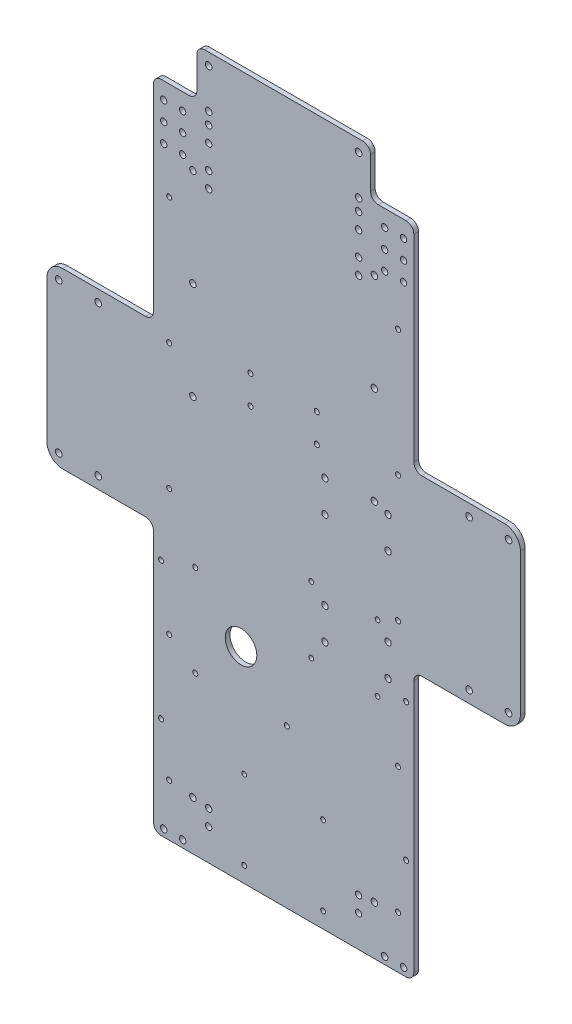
ISO-10303-21;
HEADER;
FILE_DESCRIPTION(('STEP AP214'),'2;1');
FILE_NAME('part.step','',(''),(''),'','','');
FILE_SCHEMA(('AUTOMOTIVE_DESIGN { 1 0 10303 214 1 1 1 1 }'));
ENDSEC;
DATA;
#1=APPLICATION_CONTEXT('core data for automotive mechanical design processes');
#2=APPLICATION_PROTOCOL_DEFINITION('international standard','automotive_design',2000,#1);
#3=PRODUCT_CONTEXT('',#1,'mechanical');
#4=PRODUCT('Part','Part','',(#3));
#5=PRODUCT_RELATED_PRODUCT_CATEGORY('part','',(#4));
#6=PRODUCT_DEFINITION_FORMATION('','',#4);
#7=PRODUCT_DEFINITION_CONTEXT('part definition',#1,'design');
#8=PRODUCT_DEFINITION('design','',#6,#7);
#9=PRODUCT_DEFINITION_SHAPE('','',#8);
#10=(LENGTH_UNIT() NAMED_UNIT(*) SI_UNIT(.MILLI.,.METRE.));
#11=(NAMED_UNIT(*) PLANE_ANGLE_UNIT() SI_UNIT($,.RADIAN.));
#12=(NAMED_UNIT(*) SI_UNIT($,.STERADIAN.) SOLID_ANGLE_UNIT());
#13=UNCERTAINTY_MEASURE_WITH_UNIT(LENGTH_MEASURE(1.E-05),#10,'distance_accuracy_value','');
#14=(GEOMETRIC_REPRESENTATION_CONTEXT(3) GLOBAL_UNCERTAINTY_ASSIGNED_CONTEXT((#13)) GLOBAL_UNIT_ASSIGNED_CONTEXT((#10,
#11,#12)) REPRESENTATION_CONTEXT('',''));
#15=CARTESIAN_POINT('',(0.,0.,0.));
#16=DIRECTION('',(0.,0.,1.));
#17=DIRECTION('',(1.,0.,0.));
#18=AXIS2_PLACEMENT_3D('',#15,#16,#17);
#19=CARTESIAN_POINT('',(69.093851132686,153.495145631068,117.017542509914));
#20=DIRECTION('',(0.,1.,0.));
#21=DIRECTION('',(0.,0.,1.));
#22=AXIS2_PLACEMENT_3D('',#19,#20,#21);
#23=PLANE('',#22);
#24=DIRECTION('',(1.,0.,0.));
#25=VECTOR('',#24,1.);
#26=CARTESIAN_POINT('',(69.093851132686,153.495145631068,3.));
#27=LINE('',#26,#25);
#28=CARTESIAN_POINT('',(-63.4061488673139,153.495145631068,3.));
#29=VERTEX_POINT('',#28);
#30=CARTESIAN_POINT('',(-45.906148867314,153.495145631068,3.));
#31=VERTEX_POINT('',#30);
#32=EDGE_CURVE('E810',#29,#31,#27,.T.);
#33=ORIENTED_EDGE('',*,*,#32,.T.);
#34=DIRECTION('',(0.,0.,-1.));
#35=VECTOR('',#34,1.);
#36=CARTESIAN_POINT('',(-45.906148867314,153.495145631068,0.));
#37=LINE('',#36,#35);
#38=CARTESIAN_POINT('',(-45.906148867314,153.495145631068,0.));
#39=VERTEX_POINT('',#38);
#40=EDGE_CURVE('E374',#31,#39,#37,.T.);
#41=ORIENTED_EDGE('',*,*,#40,.T.);
#42=DIRECTION('',(1.,0.,0.));
#43=VECTOR('',#42,1.);
#44=CARTESIAN_POINT('',(69.093851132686,153.495145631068,0.));
#45=LINE('',#44,#43);
#46=CARTESIAN_POINT('',(-63.4061488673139,153.495145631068,0.));
#47=VERTEX_POINT('',#46);
#48=EDGE_CURVE('E806',#47,#39,#45,.T.);
#49=ORIENTED_EDGE('',*,*,#48,.F.);
#50=DIRECTION('',(0.,0.,-1.));
#51=VECTOR('',#50,1.);
#52=CARTESIAN_POINT('',(-63.4061488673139,153.495145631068,3.));
#53=LINE('',#52,#51);
#54=EDGE_CURVE('E317',#47,#29,#53,.F.);
#55=ORIENTED_EDGE('',*,*,#54,.T.);
#56=EDGE_LOOP('',(#33,#41,#49,#55));
#57=FACE_BOUND('',#56,.T.);
#58=ADVANCED_FACE('F36',(#57),#23,.T.);
#59=CARTESIAN_POINT('',(0.,0.,3.));
#60=DIRECTION('',(0.,0.,1.));
#61=DIRECTION('',(1.,0.,0.));
#62=AXIS2_PLACEMENT_3D('',#59,#60,#61);
#63=PLANE('',#62);
#64=CARTESIAN_POINT('',(-6.90614886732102,20.4951456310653,3.));
#65=DIRECTION('',(0.,0.,1.));
#66=DIRECTION('',(1.,0.,0.));
#67=AXIS2_PLACEMENT_3D('',#64,#65,#66);
#68=CIRCLE('',#67,1.6);
#69=CARTESIAN_POINT('',(-5.30614886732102,20.4951456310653,3.));
#70=VERTEX_POINT('',#69);
#71=EDGE_CURVE('E2655',#70,#70,#68,.T.);
#72=ORIENTED_EDGE('',*,*,#71,.F.);
#73=EDGE_LOOP('',(#72));
#74=FACE_BOUND('',#73,.T.);
#75=CARTESIAN_POINT('',(-6.90614886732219,2.49514563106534,3.));
#76=DIRECTION('',(0.,0.,1.));
#77=DIRECTION('',(1.,0.,0.));
#78=AXIS2_PLACEMENT_3D('',#75,#76,#77);
#79=CIRCLE('',#78,1.6);
#80=CARTESIAN_POINT('',(-5.30614886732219,2.49514563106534,3.));
#81=VERTEX_POINT('',#80);
#82=EDGE_CURVE('E2663',#81,#81,#79,.T.);
#83=ORIENTED_EDGE('',*,*,#82,.F.);
#84=EDGE_LOOP('',(#83));
#85=FACE_BOUND('',#84,.T.);
#86=CARTESIAN_POINT('',(35.0938511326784,2.49514563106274,3.));
#87=DIRECTION('',(0.,0.,1.));
#88=DIRECTION('',(1.,0.,0.));
#89=AXIS2_PLACEMENT_3D('',#86,#87,#88);
#90=CIRCLE('',#89,1.6);
#91=CARTESIAN_POINT('',(36.6938511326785,2.49514563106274,3.));
#92=VERTEX_POINT('',#91);
#93=EDGE_CURVE('E2659',#92,#92,#90,.T.);
#94=ORIENTED_EDGE('',*,*,#93,.F.);
#95=EDGE_LOOP('',(#94));
#96=FACE_BOUND('',#95,.T.);
#97=CARTESIAN_POINT('',(35.0938511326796,20.4951456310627,3.));
#98=DIRECTION('',(0.,0.,1.));
#99=DIRECTION('',(1.,0.,0.));
#100=AXIS2_PLACEMENT_3D('',#97,#98,#99);
#101=CIRCLE('',#100,1.6);
#102=CARTESIAN_POINT('',(36.6938511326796,20.4951456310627,3.));
#103=VERTEX_POINT('',#102);
#104=EDGE_CURVE('E2677',#103,#103,#101,.T.);
#105=ORIENTED_EDGE('',*,*,#104,.F.);
#106=EDGE_LOOP('',(#105));
#107=FACE_BOUND('',#106,.T.);
#108=CARTESIAN_POINT('',(91.7308950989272,-197.404854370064,3.));
#109=DIRECTION('',(0.,0.,1.));
#110=DIRECTION('',(1.,0.,0.));
#111=AXIS2_PLACEMENT_3D('',#108,#109,#110);
#112=CIRCLE('',#111,1.59999999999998);
#113=CARTESIAN_POINT('',(93.3308950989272,-197.404854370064,3.));
#114=VERTEX_POINT('',#113);
#115=EDGE_CURVE('E2695',#114,#114,#112,.T.);
#116=ORIENTED_EDGE('',*,*,#115,.F.);
#117=EDGE_LOOP('',(#116));
#118=FACE_BOUND('',#117,.T.);
#119=CARTESIAN_POINT('',(-63.5431928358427,-197.40485437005,3.));
#120=DIRECTION('',(0.,0.,1.));
#121=DIRECTION('',(1.,0.,0.));
#122=AXIS2_PLACEMENT_3D('',#119,#120,#121);
#123=CIRCLE('',#122,1.59999999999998);
#124=CARTESIAN_POINT('',(-61.9431928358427,-197.40485437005,3.));
#125=VERTEX_POINT('',#124);
#126=EDGE_CURVE('E2692',#125,#125,#123,.T.);
#127=ORIENTED_EDGE('',*,*,#126,.F.);
#128=EDGE_LOOP('',(#127));
#129=FACE_BOUND('',#128,.T.);
#130=CARTESIAN_POINT('',(-63.5431928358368,-110.40485437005,3.));
#131=DIRECTION('',(0.,0.,1.));
#132=DIRECTION('',(1.,0.,0.));
#133=AXIS2_PLACEMENT_3D('',#130,#131,#132);
#134=CIRCLE('',#133,1.60000000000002);
#135=CARTESIAN_POINT('',(-61.9431928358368,-110.40485437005,3.));
#136=VERTEX_POINT('',#135);
#137=EDGE_CURVE('E2684',#136,#136,#134,.T.);
#138=ORIENTED_EDGE('',*,*,#137,.F.);
#139=EDGE_LOOP('',(#138));
#140=FACE_BOUND('',#139,.T.);
#141=CARTESIAN_POINT('',(91.7308950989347,-110.404854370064,3.));
#142=DIRECTION('',(0.,0.,1.));
#143=DIRECTION('',(1.,0.,0.));
#144=AXIS2_PLACEMENT_3D('',#141,#142,#143);
#145=CIRCLE('',#144,1.60000000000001);
#146=CARTESIAN_POINT('',(93.3308950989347,-110.404854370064,3.));
#147=VERTEX_POINT('',#146);
#148=EDGE_CURVE('E2701',#147,#147,#145,.T.);
#149=ORIENTED_EDGE('',*,*,#148,.F.);
#150=EDGE_LOOP('',(#149));
#151=FACE_BOUND('',#150,.T.);
#152=CARTESIAN_POINT('',(73.593851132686,-116.504854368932,3.));
#153=DIRECTION('',(0.,0.,1.));
#154=DIRECTION('',(1.,0.,0.));
#155=AXIS2_PLACEMENT_3D('',#152,#153,#154);
#156=CIRCLE('',#155,1.50000000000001);
#157=CARTESIAN_POINT('',(75.0938511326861,-116.504854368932,3.));
#158=VERTEX_POINT('',#157);
#159=EDGE_CURVE('E429',#158,#158,#156,.T.);
#160=ORIENTED_EDGE('',*,*,#159,.F.);
#161=EDGE_LOOP('',(#160));
#162=FACE_BOUND('',#161,.T.);
#163=CARTESIAN_POINT('',(73.5938511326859,-74.5048543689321,3.));
#164=DIRECTION('',(0.,0.,1.));
#165=DIRECTION('',(1.,0.,0.));
#166=AXIS2_PLACEMENT_3D('',#163,#164,#165);
#167=CIRCLE('',#166,1.5);
#168=CARTESIAN_POINT('',(75.0938511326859,-74.5048543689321,3.));
#169=VERTEX_POINT('',#168);
#170=EDGE_CURVE('E2705',#169,#169,#167,.T.);
#171=ORIENTED_EDGE('',*,*,#170,.F.);
#172=EDGE_LOOP('',(#171));
#173=FACE_BOUND('',#172,.T.);
#174=CARTESIAN_POINT('',(31.5938511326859,-74.5048543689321,3.));
#175=DIRECTION('',(0.,0.,1.));
#176=DIRECTION('',(1.,0.,0.));
#177=AXIS2_PLACEMENT_3D('',#174,#175,#176);
#178=CIRCLE('',#177,1.5);
#179=CARTESIAN_POINT('',(33.0938511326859,-74.5048543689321,3.));
#180=VERTEX_POINT('',#179);
#181=EDGE_CURVE('E442',#180,#180,#178,.T.);
#182=ORIENTED_EDGE('',*,*,#181,.F.);
#183=EDGE_LOOP('',(#182));
#184=FACE_BOUND('',#183,.T.);
#185=CARTESIAN_POINT('',(31.5938511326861,-116.504854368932,3.));
#186=DIRECTION('',(0.,0.,1.));
#187=DIRECTION('',(1.,0.,0.));
#188=AXIS2_PLACEMENT_3D('',#185,#186,#187);
#189=CIRCLE('',#188,1.5);
#190=CARTESIAN_POINT('',(33.0938511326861,-116.504854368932,3.));
#191=VERTEX_POINT('',#190);
#192=EDGE_CURVE('E425',#191,#191,#189,.T.);
#193=ORIENTED_EDGE('',*,*,#192,.F.);
#194=EDGE_LOOP('',(#193));
#195=FACE_BOUND('',#194,.T.);
#196=CARTESIAN_POINT('',(-41.906148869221,-161.50485436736,3.));
#197=DIRECTION('',(0.,0.,1.));
#198=DIRECTION('',(1.,0.,0.));
#199=AXIS2_PLACEMENT_3D('',#196,#197,#198);
#200=CIRCLE('',#199,1.59999999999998);
#201=CARTESIAN_POINT('',(-40.306148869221,-161.50485436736,3.));
#202=VERTEX_POINT('',#201);
#203=EDGE_CURVE('E415',#202,#202,#200,.T.);
#204=ORIENTED_EDGE('',*,*,#203,.F.);
#205=EDGE_LOOP('',(#204));
#206=FACE_BOUND('',#205,.T.);
#207=CARTESIAN_POINT('',(16.093851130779,-161.504854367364,3.));
#208=DIRECTION('',(0.,0.,1.));
#209=DIRECTION('',(1.,0.,0.));
#210=AXIS2_PLACEMENT_3D('',#207,#208,#209);
#211=CIRCLE('',#210,1.59999999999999);
#212=CARTESIAN_POINT('',(17.693851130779,-161.504854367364,3.));
#213=VERTEX_POINT('',#212);
#214=EDGE_CURVE('E446',#213,#213,#211,.T.);
#215=ORIENTED_EDGE('',*,*,#214,.F.);
#216=EDGE_LOOP('',(#215));
#217=FACE_BOUND('',#216,.T.);
#218=CARTESIAN_POINT('',(-12.9061488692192,-132.504854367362,3.));
#219=DIRECTION('',(0.,0.,1.));
#220=DIRECTION('',(1.,0.,0.));
#221=AXIS2_PLACEMENT_3D('',#218,#219,#220);
#222=CIRCLE('',#221,10.);
#223=CARTESIAN_POINT('',(-2.90614886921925,-132.504854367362,3.));
#224=VERTEX_POINT('',#223);
#225=EDGE_CURVE('E424',#224,#224,#222,.T.);
#226=ORIENTED_EDGE('',*,*,#225,.F.);
#227=EDGE_LOOP('',(#226));
#228=FACE_BOUND('',#227,.T.);
#229=CARTESIAN_POINT('',(-41.9061488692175,-103.50485436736,3.));
#230=DIRECTION('',(0.,0.,1.));
#231=DIRECTION('',(1.,0.,0.));
#232=AXIS2_PLACEMENT_3D('',#229,#230,#231);
#233=CIRCLE('',#232,1.60000000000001);
#234=CARTESIAN_POINT('',(-40.3061488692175,-103.50485436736,3.));
#235=VERTEX_POINT('',#234);
#236=EDGE_CURVE('E410',#235,#235,#233,.T.);
#237=ORIENTED_EDGE('',*,*,#236,.F.);
#238=EDGE_LOOP('',(#237));
#239=FACE_BOUND('',#238,.T.);
#240=CARTESIAN_POINT('',(-33.406148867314,175.995145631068,3.));
#241=DIRECTION('',(0.,0.,1.));
#242=DIRECTION('',(1.,0.,0.));
#243=AXIS2_PLACEMENT_3D('',#240,#241,#242);
#244=CIRCLE('',#243,2.09999999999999);
#245=CARTESIAN_POINT('',(-31.306148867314,175.995145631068,3.));
#246=VERTEX_POINT('',#245);
#247=EDGE_CURVE('E467',#246,#246,#244,.T.);
#248=ORIENTED_EDGE('',*,*,#247,.F.);
#249=EDGE_LOOP('',(#248));
#250=FACE_BOUND('',#249,.T.);
#251=CARTESIAN_POINT('',(61.593851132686,175.995145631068,3.));
#252=DIRECTION('',(0.,0.,1.));
#253=DIRECTION('',(1.,0.,0.));
#254=AXIS2_PLACEMENT_3D('',#251,#252,#253);
#255=CIRCLE('',#254,2.1);
#256=CARTESIAN_POINT('',(63.693851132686,175.995145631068,3.));
#257=VERTEX_POINT('',#256);
#258=EDGE_CURVE('E464',#257,#257,#255,.T.);
#259=ORIENTED_EDGE('',*,*,#258,.F.);
#260=EDGE_LOOP('',(#259));
#261=FACE_BOUND('',#260,.T.);
#262=CARTESIAN_POINT('',(61.593851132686,150.995145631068,3.));
#263=DIRECTION('',(0.,0.,1.));
#264=DIRECTION('',(1.,0.,0.));
#265=AXIS2_PLACEMENT_3D('',#262,#263,#264);
#266=CIRCLE('',#265,2.09999999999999);
#267=CARTESIAN_POINT('',(63.693851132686,150.995145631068,3.));
#268=VERTEX_POINT('',#267);
#269=EDGE_CURVE('E456',#268,#268,#266,.T.);
#270=ORIENTED_EDGE('',*,*,#269,.F.);
#271=EDGE_LOOP('',(#270));
#272=FACE_BOUND('',#271,.T.);
#273=CARTESIAN_POINT('',(-33.406148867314,150.995145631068,3.));
#274=DIRECTION('',(0.,0.,1.));
#275=DIRECTION('',(1.,0.,0.));
#276=AXIS2_PLACEMENT_3D('',#273,#274,#275);
#277=CIRCLE('',#276,2.09999999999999);
#278=CARTESIAN_POINT('',(-31.306148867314,150.995145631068,3.));
#279=VERTEX_POINT('',#278);
#280=EDGE_CURVE('E473',#279,#279,#277,.T.);
#281=ORIENTED_EDGE('',*,*,#280,.F.);
#282=EDGE_LOOP('',(#281));
#283=FACE_BOUND('',#282,.T.);
#284=CARTESIAN_POINT('',(131.593851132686,-84.0048543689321,3.));
#285=DIRECTION('',(0.,0.,1.));
#286=DIRECTION('',(1.,0.,0.));
#287=AXIS2_PLACEMENT_3D('',#284,#285,#286);
#288=CIRCLE('',#287,2.09999999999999);
#289=CARTESIAN_POINT('',(133.693851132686,-84.0048543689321,3.));
#290=VERTEX_POINT('',#289);
#291=EDGE_CURVE('E532',#290,#290,#288,.T.);
#292=ORIENTED_EDGE('',*,*,#291,.F.);
#293=EDGE_LOOP('',(#292));
#294=FACE_BOUND('',#293,.T.);
#295=CARTESIAN_POINT('',(131.593851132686,10.9951456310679,3.));
#296=DIRECTION('',(0.,0.,1.));
#297=DIRECTION('',(1.,0.,0.));
#298=AXIS2_PLACEMENT_3D('',#295,#296,#297);
#299=CIRCLE('',#298,2.09999999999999);
#300=CARTESIAN_POINT('',(133.693851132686,10.9951456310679,3.));
#301=VERTEX_POINT('',#300);
#302=EDGE_CURVE('E529',#301,#301,#299,.T.);
#303=ORIENTED_EDGE('',*,*,#302,.F.);
#304=EDGE_LOOP('',(#303));
#305=FACE_BOUND('',#304,.T.);
#306=CARTESIAN_POINT('',(156.593851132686,10.9951456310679,3.));
#307=DIRECTION('',(0.,0.,1.));
#308=DIRECTION('',(1.,0.,0.));
#309=AXIS2_PLACEMENT_3D('',#306,#307,#308);
#310=CIRCLE('',#309,2.09999999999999);
#311=CARTESIAN_POINT('',(158.693851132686,10.9951456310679,3.));
#312=VERTEX_POINT('',#311);
#313=EDGE_CURVE('E526',#312,#312,#310,.T.);
#314=ORIENTED_EDGE('',*,*,#313,.F.);
#315=EDGE_LOOP('',(#314));
#316=FACE_BOUND('',#315,.T.);
#317=CARTESIAN_POINT('',(-128.406148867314,10.9951456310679,3.));
#318=DIRECTION('',(0.,0.,1.));
#319=DIRECTION('',(1.,0.,0.));
#320=AXIS2_PLACEMENT_3D('',#317,#318,#319);
#321=CIRCLE('',#320,2.09999999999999);
#322=CARTESIAN_POINT('',(-126.306148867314,10.9951456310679,3.));
#323=VERTEX_POINT('',#322);
#324=EDGE_CURVE('E523',#323,#323,#321,.T.);
#325=ORIENTED_EDGE('',*,*,#324,.F.);
#326=EDGE_LOOP('',(#325));
#327=FACE_BOUND('',#326,.T.);
#328=CARTESIAN_POINT('',(-103.406148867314,10.9951456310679,3.));
#329=DIRECTION('',(0.,0.,1.));
#330=DIRECTION('',(1.,0.,0.));
#331=AXIS2_PLACEMENT_3D('',#328,#329,#330);
#332=CIRCLE('',#331,2.09999999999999);
#333=CARTESIAN_POINT('',(-101.306148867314,10.9951456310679,3.));
#334=VERTEX_POINT('',#333);
#335=EDGE_CURVE('E520',#334,#334,#332,.T.);
#336=ORIENTED_EDGE('',*,*,#335,.F.);
#337=EDGE_LOOP('',(#336));
#338=FACE_BOUND('',#337,.T.);
#339=CARTESIAN_POINT('',(-103.406148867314,-84.004854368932,3.));
#340=DIRECTION('',(0.,0.,1.));
#341=DIRECTION('',(1.,0.,0.));
#342=AXIS2_PLACEMENT_3D('',#339,#340,#341);
#343=CIRCLE('',#342,2.09999999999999);
#344=CARTESIAN_POINT('',(-101.306148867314,-84.004854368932,3.));
#345=VERTEX_POINT('',#344);
#346=EDGE_CURVE('E517',#345,#345,#343,.T.);
#347=ORIENTED_EDGE('',*,*,#346,.F.);
#348=EDGE_LOOP('',(#347));
#349=FACE_BOUND('',#348,.T.);
#350=CARTESIAN_POINT('',(-128.406148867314,-84.004854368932,3.));
#351=DIRECTION('',(0.,0.,1.));
#352=DIRECTION('',(1.,0.,0.));
#353=AXIS2_PLACEMENT_3D('',#350,#351,#352);
#354=CIRCLE('',#353,2.09999999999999);
#355=CARTESIAN_POINT('',(-126.306148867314,-84.004854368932,3.));
#356=VERTEX_POINT('',#355);
#357=EDGE_CURVE('E497',#356,#356,#354,.T.);
#358=ORIENTED_EDGE('',*,*,#357,.F.);
#359=EDGE_LOOP('',(#358));
#360=FACE_BOUND('',#359,.T.);
#361=CARTESIAN_POINT('',(156.593851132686,-84.0048543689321,3.));
#362=DIRECTION('',(0.,0.,1.));
#363=DIRECTION('',(1.,0.,0.));
#364=AXIS2_PLACEMENT_3D('',#361,#362,#363);
#365=CIRCLE('',#364,2.09999999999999);
#366=CARTESIAN_POINT('',(158.693851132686,-84.0048543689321,3.));
#367=VERTEX_POINT('',#366);
#368=EDGE_CURVE('E538',#367,#367,#365,.T.);
#369=ORIENTED_EDGE('',*,*,#368,.F.);
#370=EDGE_LOOP('',(#369));
#371=FACE_BOUND('',#370,.T.);
#372=DIRECTION('',(1.,0.,0.));
#373=VECTOR('',#372,1.);
#374=CARTESIAN_POINT('',(-40.906148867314,183.495145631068,3.));
#375=LINE('',#374,#373);
#376=CARTESIAN_POINT('',(-35.906148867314,183.495145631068,3.));
#377=VERTEX_POINT('',#376);
#378=CARTESIAN_POINT('',(64.093851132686,183.495145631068,3.));
#379=VERTEX_POINT('',#378);
#380=EDGE_CURVE('E489',#377,#379,#375,.T.);
#381=ORIENTED_EDGE('',*,*,#380,.F.);
#382=CARTESIAN_POINT('',(-35.906148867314,178.495145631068,3.));
#383=DIRECTION('',(0.,0.,1.));
#384=DIRECTION('',(1.,0.,0.));
#385=AXIS2_PLACEMENT_3D('',#382,#383,#384);
#386=CIRCLE('',#385,5.);
#387=CARTESIAN_POINT('',(-40.906148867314,178.495145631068,3.));
#388=VERTEX_POINT('',#387);
#389=EDGE_CURVE('E393',#377,#388,#386,.T.);
#390=ORIENTED_EDGE('',*,*,#389,.T.);
#391=DIRECTION('',(0.,1.,0.));
#392=VECTOR('',#391,1.);
#393=CARTESIAN_POINT('',(-40.906148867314,183.495145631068,3.));
#394=LINE('',#393,#392);
#395=CARTESIAN_POINT('',(-40.906148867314,158.495145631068,3.));
#396=VERTEX_POINT('',#395);
#397=EDGE_CURVE('E480',#396,#388,#394,.T.);
#398=ORIENTED_EDGE('',*,*,#397,.F.);
#399=CARTESIAN_POINT('',(-45.906148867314,158.495145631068,3.));
#400=DIRECTION('',(0.,0.,1.));
#401=DIRECTION('',(1.,0.,0.));
#402=AXIS2_PLACEMENT_3D('',#399,#400,#401);
#403=CIRCLE('',#402,5.);
#404=EDGE_CURVE('E403',#396,#31,#403,.F.);
#405=ORIENTED_EDGE('',*,*,#404,.T.);
#406=ORIENTED_EDGE('',*,*,#32,.F.);
#407=CARTESIAN_POINT('',(-63.4061488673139,148.495145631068,3.));
#408=DIRECTION('',(0.,0.,1.));
#409=DIRECTION('',(1.,0.,0.));
#410=AXIS2_PLACEMENT_3D('',#407,#408,#409);
#411=CIRCLE('',#410,5.);
#412=CARTESIAN_POINT('',(-68.4061488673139,148.495145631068,3.));
#413=VERTEX_POINT('',#412);
#414=EDGE_CURVE('E276',#29,#413,#411,.T.);
#415=ORIENTED_EDGE('',*,*,#414,.T.);
#416=DIRECTION('',(0.,1.,0.));
#417=VECTOR('',#416,1.);
#418=CARTESIAN_POINT('',(-68.4061488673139,0.,3.));
#419=LINE('',#418,#417);
#420=CARTESIAN_POINT('',(-68.4061488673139,23.4951456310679,3.));
#421=VERTEX_POINT('',#420);
#422=EDGE_CURVE('E796',#421,#413,#419,.T.);
#423=ORIENTED_EDGE('',*,*,#422,.F.);
#424=CARTESIAN_POINT('',(-73.4061488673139,23.4951456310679,3.));
#425=DIRECTION('',(0.,0.,1.));
#426=DIRECTION('',(1.,0.,0.));
#427=AXIS2_PLACEMENT_3D('',#424,#425,#426);
#428=CIRCLE('',#427,5.);
#429=CARTESIAN_POINT('',(-73.4061488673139,18.4951456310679,3.));
#430=VERTEX_POINT('',#429);
#431=EDGE_CURVE('E335',#421,#430,#428,.F.);
#432=ORIENTED_EDGE('',*,*,#431,.T.);
#433=DIRECTION('',(1.,0.,0.));
#434=VECTOR('',#433,1.);
#435=CARTESIAN_POINT('',(0.,18.495145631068,3.));
#436=LINE('',#435,#434);
#437=CARTESIAN_POINT('',(-125.906148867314,18.4951456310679,3.));
#438=VERTEX_POINT('',#437);
#439=EDGE_CURVE('E847',#438,#430,#436,.T.);
#440=ORIENTED_EDGE('',*,*,#439,.F.);
#441=CARTESIAN_POINT('',(-125.906148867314,8.49514563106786,3.));
#442=DIRECTION('',(0.,0.,1.));
#443=DIRECTION('',(1.,0.,0.));
#444=AXIS2_PLACEMENT_3D('',#441,#442,#443);
#445=CIRCLE('',#444,10.);
#446=CARTESIAN_POINT('',(-135.906148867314,8.49514563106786,3.));
#447=VERTEX_POINT('',#446);
#448=EDGE_CURVE('E359',#438,#447,#445,.T.);
#449=ORIENTED_EDGE('',*,*,#448,.T.);
#450=DIRECTION('',(0.,1.,0.));
#451=VECTOR('',#450,1.);
#452=CARTESIAN_POINT('',(-135.906148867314,0.,3.));
#453=LINE('',#452,#451);
#454=CARTESIAN_POINT('',(-135.906148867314,-81.5048543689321,3.));
#455=VERTEX_POINT('',#454);
#456=EDGE_CURVE('E547',#455,#447,#453,.T.);
#457=ORIENTED_EDGE('',*,*,#456,.F.);
#458=CARTESIAN_POINT('',(-125.906148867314,-81.5048543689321,3.));
#459=DIRECTION('',(0.,0.,1.));
#460=DIRECTION('',(1.,0.,0.));
#461=AXIS2_PLACEMENT_3D('',#458,#459,#460);
#462=CIRCLE('',#461,10.);
#463=CARTESIAN_POINT('',(-125.906148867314,-91.5048543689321,3.));
#464=VERTEX_POINT('',#463);
#465=EDGE_CURVE('E357',#455,#464,#462,.T.);
#466=ORIENTED_EDGE('',*,*,#465,.T.);
#467=DIRECTION('',(-1.,0.,0.));
#468=VECTOR('',#467,1.);
#469=CARTESIAN_POINT('',(0.,-91.5048543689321,3.));
#470=LINE('',#469,#468);
#471=CARTESIAN_POINT('',(-73.4061488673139,-91.5048543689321,3.));
#472=VERTEX_POINT('',#471);
#473=EDGE_CURVE('E849',#472,#464,#470,.T.);
#474=ORIENTED_EDGE('',*,*,#473,.F.);
#475=CARTESIAN_POINT('',(-73.4061488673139,-96.5048543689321,3.));
#476=DIRECTION('',(0.,0.,1.));
#477=DIRECTION('',(1.,0.,0.));
#478=AXIS2_PLACEMENT_3D('',#475,#476,#477);
#479=CIRCLE('',#478,5.);
#480=CARTESIAN_POINT('',(-68.4061488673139,-96.5048543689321,3.));
#481=VERTEX_POINT('',#480);
#482=EDGE_CURVE('E331',#472,#481,#479,.F.);
#483=ORIENTED_EDGE('',*,*,#482,.T.);
#484=DIRECTION('',(0.,1.,0.));
#485=VECTOR('',#484,1.);
#486=CARTESIAN_POINT('',(-68.4061488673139,0.,3.));
#487=LINE('',#486,#485);
#488=CARTESIAN_POINT('',(-68.4061488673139,-256.504854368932,3.));
#489=VERTEX_POINT('',#488);
#490=EDGE_CURVE('E785',#489,#481,#487,.T.);
#491=ORIENTED_EDGE('',*,*,#490,.F.);
#492=CARTESIAN_POINT('',(-63.4061488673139,-256.504854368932,3.));
#493=DIRECTION('',(0.,0.,1.));
#494=DIRECTION('',(1.,0.,0.));
#495=AXIS2_PLACEMENT_3D('',#492,#493,#494);
#496=CIRCLE('',#495,5.);
#497=CARTESIAN_POINT('',(-63.4061488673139,-261.504854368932,3.));
#498=VERTEX_POINT('',#497);
#499=EDGE_CURVE('E279',#489,#498,#496,.T.);
#500=ORIENTED_EDGE('',*,*,#499,.T.);
#501=DIRECTION('',(-1.,0.,0.));
#502=VECTOR('',#501,1.);
#503=CARTESIAN_POINT('',(0.,-261.504854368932,3.));
#504=LINE('',#503,#502);
#505=CARTESIAN_POINT('',(91.5938511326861,-261.504854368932,3.));
#506=VERTEX_POINT('',#505);
#507=EDGE_CURVE('E802',#506,#498,#504,.T.);
#508=ORIENTED_EDGE('',*,*,#507,.F.);
#509=CARTESIAN_POINT('',(91.5938511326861,-256.504854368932,3.));
#510=DIRECTION('',(0.,0.,1.));
#511=DIRECTION('',(1.,0.,0.));
#512=AXIS2_PLACEMENT_3D('',#509,#510,#511);
#513=CIRCLE('',#512,5.);
#514=CARTESIAN_POINT('',(96.5938511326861,-256.504854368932,3.));
#515=VERTEX_POINT('',#514);
#516=EDGE_CURVE('E286',#506,#515,#513,.T.);
#517=ORIENTED_EDGE('',*,*,#516,.T.);
#518=DIRECTION('',(0.,-1.,0.));
#519=VECTOR('',#518,1.);
#520=CARTESIAN_POINT('',(96.5938511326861,0.,3.));
#521=LINE('',#520,#519);
#522=CARTESIAN_POINT('',(96.5938511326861,-96.5048543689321,3.));
#523=VERTEX_POINT('',#522);
#524=EDGE_CURVE('E793',#523,#515,#521,.T.);
#525=ORIENTED_EDGE('',*,*,#524,.F.);
#526=CARTESIAN_POINT('',(101.593851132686,-96.5048543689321,3.));
#527=DIRECTION('',(0.,0.,1.));
#528=DIRECTION('',(1.,0.,0.));
#529=AXIS2_PLACEMENT_3D('',#526,#527,#528);
#530=CIRCLE('',#529,5.);
#531=CARTESIAN_POINT('',(101.593851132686,-91.5048543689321,3.));
#532=VERTEX_POINT('',#531);
#533=EDGE_CURVE('E325',#523,#532,#530,.F.);
#534=ORIENTED_EDGE('',*,*,#533,.T.);
#535=DIRECTION('',(-1.,0.,0.));
#536=VECTOR('',#535,1.);
#537=CARTESIAN_POINT('',(0.,-91.5048543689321,3.));
#538=LINE('',#537,#536);
#539=CARTESIAN_POINT('',(154.093851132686,-91.5048543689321,3.));
#540=VERTEX_POINT('',#539);
#541=EDGE_CURVE('E841',#540,#532,#538,.T.);
#542=ORIENTED_EDGE('',*,*,#541,.F.);
#543=CARTESIAN_POINT('',(154.093851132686,-81.5048543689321,3.));
#544=DIRECTION('',(0.,0.,1.));
#545=DIRECTION('',(1.,0.,0.));
#546=AXIS2_PLACEMENT_3D('',#543,#544,#545);
#547=CIRCLE('',#546,10.);
#548=CARTESIAN_POINT('',(164.093851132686,-81.5048543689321,3.));
#549=VERTEX_POINT('',#548);
#550=EDGE_CURVE('E353',#540,#549,#547,.T.);
#551=ORIENTED_EDGE('',*,*,#550,.T.);
#552=DIRECTION('',(0.,1.,0.));
#553=VECTOR('',#552,1.);
#554=CARTESIAN_POINT('',(164.093851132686,0.,3.));
#555=LINE('',#554,#553);
#556=CARTESIAN_POINT('',(164.093851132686,8.49514563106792,3.));
#557=VERTEX_POINT('',#556);
#558=EDGE_CURVE('E544',#549,#557,#555,.T.);
#559=ORIENTED_EDGE('',*,*,#558,.T.);
#560=CARTESIAN_POINT('',(154.093851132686,8.49514563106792,3.));
#561=DIRECTION('',(0.,0.,1.));
#562=DIRECTION('',(1.,0.,0.));
#563=AXIS2_PLACEMENT_3D('',#560,#561,#562);
#564=CIRCLE('',#563,10.);
#565=CARTESIAN_POINT('',(154.093851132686,18.4951456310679,3.));
#566=VERTEX_POINT('',#565);
#567=EDGE_CURVE('E355',#557,#566,#564,.T.);
#568=ORIENTED_EDGE('',*,*,#567,.T.);
#569=DIRECTION('',(1.,0.,0.));
#570=VECTOR('',#569,1.);
#571=CARTESIAN_POINT('',(0.,18.4951456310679,3.));
#572=LINE('',#571,#570);
#573=CARTESIAN_POINT('',(101.593851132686,18.4951456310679,3.));
#574=VERTEX_POINT('',#573);
#575=EDGE_CURVE('E854',#574,#566,#572,.T.);
#576=ORIENTED_EDGE('',*,*,#575,.F.);
#577=CARTESIAN_POINT('',(101.593851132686,23.4951456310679,3.));
#578=DIRECTION('',(0.,0.,1.));
#579=DIRECTION('',(1.,0.,0.));
#580=AXIS2_PLACEMENT_3D('',#577,#578,#579);
#581=CIRCLE('',#580,5.);
#582=CARTESIAN_POINT('',(96.593851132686,23.4951456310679,3.));
#583=VERTEX_POINT('',#582);
#584=EDGE_CURVE('E270',#574,#583,#581,.F.);
#585=ORIENTED_EDGE('',*,*,#584,.T.);
#586=DIRECTION('',(0.,-1.,0.));
#587=VECTOR('',#586,1.);
#588=CARTESIAN_POINT('',(96.593851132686,0.,3.));
#589=LINE('',#588,#587);
#590=CARTESIAN_POINT('',(96.593851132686,148.495145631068,3.));
#591=VERTEX_POINT('',#590);
#592=EDGE_CURVE('E252',#591,#583,#589,.T.);
#593=ORIENTED_EDGE('',*,*,#592,.F.);
#594=CARTESIAN_POINT('',(91.593851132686,148.495145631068,3.));
#595=DIRECTION('',(0.,0.,1.));
#596=DIRECTION('',(1.,0.,0.));
#597=AXIS2_PLACEMENT_3D('',#594,#595,#596);
#598=CIRCLE('',#597,5.);
#599=CARTESIAN_POINT('',(91.593851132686,153.495145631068,3.));
#600=VERTEX_POINT('',#599);
#601=EDGE_CURVE('E266',#591,#600,#598,.T.);
#602=ORIENTED_EDGE('',*,*,#601,.T.);
#603=CARTESIAN_POINT('',(74.093851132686,153.495145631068,3.));
#604=VERTEX_POINT('',#603);
#605=EDGE_CURVE('E809',#604,#600,#27,.T.);
#606=ORIENTED_EDGE('',*,*,#605,.F.);
#607=CARTESIAN_POINT('',(74.093851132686,158.495145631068,3.));
#608=DIRECTION('',(0.,0.,1.));
#609=DIRECTION('',(1.,0.,0.));
#610=AXIS2_PLACEMENT_3D('',#607,#608,#609);
#611=CIRCLE('',#610,5.);
#612=CARTESIAN_POINT('',(69.093851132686,158.495145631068,3.));
#613=VERTEX_POINT('',#612);
#614=EDGE_CURVE('E11',#604,#613,#611,.F.);
#615=ORIENTED_EDGE('',*,*,#614,.T.);
#616=DIRECTION('',(0.,-1.,0.));
#617=VECTOR('',#616,1.);
#618=CARTESIAN_POINT('',(69.093851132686,183.495145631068,3.));
#619=LINE('',#618,#617);
#620=CARTESIAN_POINT('',(69.093851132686,178.495145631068,3.));
#621=VERTEX_POINT('',#620);
#622=EDGE_CURVE('E486',#621,#613,#619,.T.);
#623=ORIENTED_EDGE('',*,*,#622,.F.);
#624=CARTESIAN_POINT('',(64.093851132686,178.495145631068,3.));
#625=DIRECTION('',(0.,0.,1.));
#626=DIRECTION('',(1.,0.,0.));
#627=AXIS2_PLACEMENT_3D('',#624,#625,#626);
#628=CIRCLE('',#627,5.);
#629=EDGE_CURVE('E391',#621,#379,#628,.T.);
#630=ORIENTED_EDGE('',*,*,#629,.T.);
#631=EDGE_LOOP('',(#381,#390,#398,#405,#406,#415,#423,#432,#440,#449,#457,#466,#474,#483,#491,
#500,#508,#517,#525,#534,#542,#551,#559,#568,#576,#585,#593,#602,#606,#615,#623,#630));
#632=FACE_BOUND('',#631,.T.);
#633=CARTESIAN_POINT('',(-58.4061488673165,-148.504854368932,3.));
#634=DIRECTION('',(0.,0.,1.));
#635=DIRECTION('',(1.,0.,0.));
#636=AXIS2_PLACEMENT_3D('',#633,#634,#635);
#637=CIRCLE('',#636,1.59999999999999);
#638=CARTESIAN_POINT('',(-56.8061488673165,-148.504854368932,3.));
#639=VERTEX_POINT('',#638);
#640=EDGE_CURVE('E604',#639,#639,#637,.T.);
#641=ORIENTED_EDGE('',*,*,#640,.F.);
#642=EDGE_LOOP('',(#641));
#643=FACE_BOUND('',#642,.T.);
#644=CARTESIAN_POINT('',(-58.4061488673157,-68.5048543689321,3.));
#645=DIRECTION('',(0.,0.,1.));
#646=DIRECTION('',(1.,0.,0.));
#647=AXIS2_PLACEMENT_3D('',#644,#645,#646);
#648=CIRCLE('',#647,1.60000000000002);
#649=CARTESIAN_POINT('',(-56.8061488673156,-68.5048543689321,3.));
#650=VERTEX_POINT('',#649);
#651=EDGE_CURVE('E601',#650,#650,#648,.T.);
#652=ORIENTED_EDGE('',*,*,#651,.F.);
#653=EDGE_LOOP('',(#652));
#654=FACE_BOUND('',#653,.T.);
#655=CARTESIAN_POINT('',(-58.4061488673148,11.4951456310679,3.));
#656=DIRECTION('',(0.,0.,1.));
#657=DIRECTION('',(1.,0.,0.));
#658=AXIS2_PLACEMENT_3D('',#655,#656,#657);
#659=CIRCLE('',#658,1.59999999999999);
#660=CARTESIAN_POINT('',(-56.8061488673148,11.4951456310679,3.));
#661=VERTEX_POINT('',#660);
#662=EDGE_CURVE('E598',#661,#661,#659,.T.);
#663=ORIENTED_EDGE('',*,*,#662,.F.);
#664=EDGE_LOOP('',(#663));
#665=FACE_BOUND('',#664,.T.);
#666=CARTESIAN_POINT('',(-58.4061488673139,91.4951456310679,3.));
#667=DIRECTION('',(0.,0.,1.));
#668=DIRECTION('',(1.,0.,0.));
#669=AXIS2_PLACEMENT_3D('',#666,#667,#668);
#670=CIRCLE('',#669,1.60000000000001);
#671=CARTESIAN_POINT('',(-56.8061488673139,91.4951456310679,3.));
#672=VERTEX_POINT('',#671);
#673=EDGE_CURVE('E595',#672,#672,#670,.T.);
#674=ORIENTED_EDGE('',*,*,#673,.F.);
#675=EDGE_LOOP('',(#674));
#676=FACE_BOUND('',#675,.T.);
#677=CARTESIAN_POINT('',(86.593851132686,91.4951456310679,3.));
#678=DIRECTION('',(0.,0.,1.));
#679=DIRECTION('',(1.,0.,0.));
#680=AXIS2_PLACEMENT_3D('',#677,#678,#679);
#681=CIRCLE('',#680,1.60000000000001);
#682=CARTESIAN_POINT('',(88.193851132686,91.4951456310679,3.));
#683=VERTEX_POINT('',#682);
#684=EDGE_CURVE('E592',#683,#683,#681,.T.);
#685=ORIENTED_EDGE('',*,*,#684,.F.);
#686=EDGE_LOOP('',(#685));
#687=FACE_BOUND('',#686,.T.);
#688=CARTESIAN_POINT('',(86.5938511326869,11.4951456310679,3.));
#689=DIRECTION('',(0.,0.,1.));
#690=DIRECTION('',(1.,0.,0.));
#691=AXIS2_PLACEMENT_3D('',#688,#689,#690);
#692=CIRCLE('',#691,1.59999999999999);
#693=CARTESIAN_POINT('',(88.1938511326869,11.4951456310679,3.));
#694=VERTEX_POINT('',#693);
#695=EDGE_CURVE('E589',#694,#694,#692,.T.);
#696=ORIENTED_EDGE('',*,*,#695,.F.);
#697=EDGE_LOOP('',(#696));
#698=FACE_BOUND('',#697,.T.);
#699=CARTESIAN_POINT('',(86.5938511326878,-68.5048543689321,3.));
#700=DIRECTION('',(0.,0.,1.));
#701=DIRECTION('',(1.,0.,0.));
#702=AXIS2_PLACEMENT_3D('',#699,#700,#701);
#703=CIRCLE('',#702,1.60000000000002);
#704=CARTESIAN_POINT('',(88.1938511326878,-68.5048543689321,3.));
#705=VERTEX_POINT('',#704);
#706=EDGE_CURVE('E586',#705,#705,#703,.T.);
#707=ORIENTED_EDGE('',*,*,#706,.F.);
#708=EDGE_LOOP('',(#707));
#709=FACE_BOUND('',#708,.T.);
#710=CARTESIAN_POINT('',(86.5938511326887,-148.504854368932,3.));
#711=DIRECTION('',(0.,0.,1.));
#712=DIRECTION('',(1.,0.,0.));
#713=AXIS2_PLACEMENT_3D('',#710,#711,#712);
#714=CIRCLE('',#713,1.59999999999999);
#715=CARTESIAN_POINT('',(88.1938511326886,-148.504854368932,3.));
#716=VERTEX_POINT('',#715);
#717=EDGE_CURVE('E583',#716,#716,#714,.T.);
#718=ORIENTED_EDGE('',*,*,#717,.F.);
#719=EDGE_LOOP('',(#718));
#720=FACE_BOUND('',#719,.T.);
#721=CARTESIAN_POINT('',(86.5938511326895,-228.504854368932,3.));
#722=DIRECTION('',(0.,0.,1.));
#723=DIRECTION('',(1.,0.,0.));
#724=AXIS2_PLACEMENT_3D('',#721,#722,#723);
#725=CIRCLE('',#724,1.59999999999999);
#726=CARTESIAN_POINT('',(88.1938511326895,-228.504854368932,3.));
#727=VERTEX_POINT('',#726);
#728=EDGE_CURVE('E557',#727,#727,#725,.T.);
#729=ORIENTED_EDGE('',*,*,#728,.F.);
#730=EDGE_LOOP('',(#729));
#731=FACE_BOUND('',#730,.T.);
#732=CARTESIAN_POINT('',(-58.4061488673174,-228.504854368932,3.));
#733=DIRECTION('',(0.,0.,1.));
#734=DIRECTION('',(1.,0.,0.));
#735=AXIS2_PLACEMENT_3D('',#732,#733,#734);
#736=CIRCLE('',#735,1.59999999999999);
#737=CARTESIAN_POINT('',(-56.8061488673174,-228.504854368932,3.));
#738=VERTEX_POINT('',#737);
#739=EDGE_CURVE('E610',#738,#738,#736,.T.);
#740=ORIENTED_EDGE('',*,*,#739,.F.);
#741=EDGE_LOOP('',(#740));
#742=FACE_BOUND('',#741,.T.);
#743=CARTESIAN_POINT('',(-61.9061488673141,118.995145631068,3.));
#744=DIRECTION('',(0.,0.,1.));
#745=DIRECTION('',(1.,0.,0.));
#746=AXIS2_PLACEMENT_3D('',#743,#744,#745);
#747=CIRCLE('',#746,2.);
#748=CARTESIAN_POINT('',(-59.9061488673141,118.995145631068,3.));
#749=VERTEX_POINT('',#748);
#750=EDGE_CURVE('E634',#749,#749,#747,.T.);
#751=ORIENTED_EDGE('',*,*,#750,.F.);
#752=EDGE_LOOP('',(#751));
#753=FACE_BOUND('',#752,.T.);
#754=CARTESIAN_POINT('',(-49.9061488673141,118.995145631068,3.));
#755=DIRECTION('',(0.,0.,1.));
#756=DIRECTION('',(1.,0.,0.));
#757=AXIS2_PLACEMENT_3D('',#754,#755,#756);
#758=CIRCLE('',#757,2.);
#759=CARTESIAN_POINT('',(-47.9061488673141,118.995145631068,3.));
#760=VERTEX_POINT('',#759);
#761=EDGE_CURVE('E631',#760,#760,#758,.T.);
#762=ORIENTED_EDGE('',*,*,#761,.F.);
#763=EDGE_LOOP('',(#762));
#764=FACE_BOUND('',#763,.T.);
#765=CARTESIAN_POINT('',(78.0938511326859,118.995145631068,3.));
#766=DIRECTION('',(0.,0.,1.));
#767=DIRECTION('',(1.,0.,0.));
#768=AXIS2_PLACEMENT_3D('',#765,#766,#767);
#769=CIRCLE('',#768,2.);
#770=CARTESIAN_POINT('',(80.0938511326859,118.995145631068,3.));
#771=VERTEX_POINT('',#770);
#772=EDGE_CURVE('E628',#771,#771,#769,.T.);
#773=ORIENTED_EDGE('',*,*,#772,.F.);
#774=EDGE_LOOP('',(#773));
#775=FACE_BOUND('',#774,.T.);
#776=CARTESIAN_POINT('',(90.0938511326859,118.995145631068,3.));
#777=DIRECTION('',(0.,0.,1.));
#778=DIRECTION('',(1.,0.,0.));
#779=AXIS2_PLACEMENT_3D('',#776,#777,#778);
#780=CIRCLE('',#779,2.00000000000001);
#781=CARTESIAN_POINT('',(92.0938511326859,118.995145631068,3.));
#782=VERTEX_POINT('',#781);
#783=EDGE_CURVE('E617',#782,#782,#780,.T.);
#784=ORIENTED_EDGE('',*,*,#783,.F.);
#785=EDGE_LOOP('',(#784));
#786=FACE_BOUND('',#785,.T.);
#787=CARTESIAN_POINT('',(-33.4061488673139,133.495145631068,3.));
#788=DIRECTION('',(0.,0.,1.));
#789=DIRECTION('',(1.,0.,0.));
#790=AXIS2_PLACEMENT_3D('',#787,#788,#789);
#791=CIRCLE('',#790,2.04999999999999);
#792=CARTESIAN_POINT('',(-31.3561488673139,133.495145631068,3.));
#793=VERTEX_POINT('',#792);
#794=EDGE_CURVE('E658',#793,#793,#791,.T.);
#795=ORIENTED_EDGE('',*,*,#794,.F.);
#796=EDGE_LOOP('',(#795));
#797=FACE_BOUND('',#796,.T.);
#798=CARTESIAN_POINT('',(-33.4061488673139,143.495145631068,3.));
#799=DIRECTION('',(0.,0.,1.));
#800=DIRECTION('',(1.,0.,0.));
#801=AXIS2_PLACEMENT_3D('',#798,#799,#800);
#802=CIRCLE('',#801,2.04999999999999);
#803=CARTESIAN_POINT('',(-31.3561488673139,143.495145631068,3.));
#804=VERTEX_POINT('',#803);
#805=EDGE_CURVE('E655',#804,#804,#802,.T.);
#806=ORIENTED_EDGE('',*,*,#805,.F.);
#807=EDGE_LOOP('',(#806));
#808=FACE_BOUND('',#807,.T.);
#809=CARTESIAN_POINT('',(61.5938511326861,133.495145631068,3.));
#810=DIRECTION('',(0.,0.,1.));
#811=DIRECTION('',(1.,0.,0.));
#812=AXIS2_PLACEMENT_3D('',#809,#810,#811);
#813=CIRCLE('',#812,2.04999999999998);
#814=CARTESIAN_POINT('',(63.6438511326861,133.495145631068,3.));
#815=VERTEX_POINT('',#814);
#816=EDGE_CURVE('E652',#815,#815,#813,.T.);
#817=ORIENTED_EDGE('',*,*,#816,.F.);
#818=EDGE_LOOP('',(#817));
#819=FACE_BOUND('',#818,.T.);
#820=CARTESIAN_POINT('',(61.5938511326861,143.495145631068,3.));
#821=DIRECTION('',(0.,0.,1.));
#822=DIRECTION('',(1.,0.,0.));
#823=AXIS2_PLACEMENT_3D('',#820,#821,#822);
#824=CIRCLE('',#823,2.04999999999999);
#825=CARTESIAN_POINT('',(63.6438511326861,143.495145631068,3.));
#826=VERTEX_POINT('',#825);
#827=EDGE_CURVE('E641',#826,#826,#824,.T.);
#828=ORIENTED_EDGE('',*,*,#827,.F.);
#829=EDGE_LOOP('',(#828));
#830=FACE_BOUND('',#829,.T.);
#831=CARTESIAN_POINT('',(71.593851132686,113.495145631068,3.));
#832=DIRECTION('',(0.,0.,1.));
#833=DIRECTION('',(1.,0.,0.));
#834=AXIS2_PLACEMENT_3D('',#831,#832,#833);
#835=CIRCLE('',#834,2.05999999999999);
#836=CARTESIAN_POINT('',(73.653851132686,113.495145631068,3.));
#837=VERTEX_POINT('',#836);
#838=EDGE_CURVE('E665',#837,#837,#835,.F.);
#839=ORIENTED_EDGE('',*,*,#838,.T.);
#840=EDGE_LOOP('',(#839));
#841=FACE_BOUND('',#840,.T.);
#842=CARTESIAN_POINT('',(-43.4061488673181,51.4951456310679,3.));
#843=DIRECTION('',(0.,0.,1.));
#844=DIRECTION('',(1.,0.,0.));
#845=AXIS2_PLACEMENT_3D('',#842,#843,#844);
#846=CIRCLE('',#845,2.06);
#847=CARTESIAN_POINT('',(-41.3461488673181,51.4951456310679,3.));
#848=VERTEX_POINT('',#847);
#849=EDGE_CURVE('E666',#848,#848,#846,.F.);
#850=ORIENTED_EDGE('',*,*,#849,.T.);
#851=EDGE_LOOP('',(#850));
#852=FACE_BOUND('',#851,.T.);
#853=CARTESIAN_POINT('',(71.5938511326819,51.4951456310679,3.));
#854=DIRECTION('',(0.,0.,1.));
#855=DIRECTION('',(1.,0.,0.));
#856=AXIS2_PLACEMENT_3D('',#853,#854,#855);
#857=CIRCLE('',#856,2.05999999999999);
#858=CARTESIAN_POINT('',(73.6538511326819,51.4951456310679,3.));
#859=VERTEX_POINT('',#858);
#860=EDGE_CURVE('E673',#859,#859,#857,.F.);
#861=ORIENTED_EDGE('',*,*,#860,.T.);
#862=EDGE_LOOP('',(#861));
#863=FACE_BOUND('',#862,.T.);
#864=CARTESIAN_POINT('',(-43.4061488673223,-10.5048543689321,3.));
#865=DIRECTION('',(0.,0.,1.));
#866=DIRECTION('',(1.,0.,0.));
#867=AXIS2_PLACEMENT_3D('',#864,#865,#866);
#868=CIRCLE('',#867,2.05999999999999);
#869=CARTESIAN_POINT('',(-41.3461488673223,-10.5048543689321,3.));
#870=VERTEX_POINT('',#869);
#871=EDGE_CURVE('E679',#870,#870,#868,.F.);
#872=ORIENTED_EDGE('',*,*,#871,.T.);
#873=EDGE_LOOP('',(#872));
#874=FACE_BOUND('',#873,.T.);
#875=CARTESIAN_POINT('',(71.5938511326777,-10.5048543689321,3.));
#876=DIRECTION('',(0.,0.,1.));
#877=DIRECTION('',(1.,0.,0.));
#878=AXIS2_PLACEMENT_3D('',#875,#876,#877);
#879=CIRCLE('',#878,2.05999999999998);
#880=CARTESIAN_POINT('',(73.6538511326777,-10.5048543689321,3.));
#881=VERTEX_POINT('',#880);
#882=EDGE_CURVE('E685',#881,#881,#879,.F.);
#883=ORIENTED_EDGE('',*,*,#882,.T.);
#884=EDGE_LOOP('',(#883));
#885=FACE_BOUND('',#884,.T.);
#886=CARTESIAN_POINT('',(-43.4061488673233,-230.504854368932,3.));
#887=DIRECTION('',(0.,0.,1.));
#888=DIRECTION('',(1.,0.,0.));
#889=AXIS2_PLACEMENT_3D('',#886,#887,#888);
#890=CIRCLE('',#889,2.05999999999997);
#891=CARTESIAN_POINT('',(-41.3461488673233,-230.504854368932,3.));
#892=VERTEX_POINT('',#891);
#893=EDGE_CURVE('E691',#892,#892,#890,.F.);
#894=ORIENTED_EDGE('',*,*,#893,.T.);
#895=EDGE_LOOP('',(#894));
#896=FACE_BOUND('',#895,.T.);
#897=CARTESIAN_POINT('',(71.5938511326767,-230.504854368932,3.));
#898=DIRECTION('',(0.,0.,1.));
#899=DIRECTION('',(1.,0.,0.));
#900=AXIS2_PLACEMENT_3D('',#897,#898,#899);
#901=CIRCLE('',#900,2.05999999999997);
#902=CARTESIAN_POINT('',(73.6538511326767,-230.504854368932,3.));
#903=VERTEX_POINT('',#902);
#904=EDGE_CURVE('E697',#903,#903,#901,.F.);
#905=ORIENTED_EDGE('',*,*,#904,.T.);
#906=EDGE_LOOP('',(#905));
#907=FACE_BOUND('',#906,.T.);
#908=CARTESIAN_POINT('',(-43.406148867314,113.495145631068,3.));
#909=DIRECTION('',(0.,0.,1.));
#910=DIRECTION('',(1.,0.,0.));
#911=AXIS2_PLACEMENT_3D('',#908,#909,#910);
#912=CIRCLE('',#911,2.06);
#913=CARTESIAN_POINT('',(-41.346148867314,113.495145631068,3.));
#914=VERTEX_POINT('',#913);
#915=EDGE_CURVE('E706',#914,#914,#912,.F.);
#916=ORIENTED_EDGE('',*,*,#915,.T.);
#917=EDGE_LOOP('',(#916));
#918=FACE_BOUND('',#917,.T.);
#919=CARTESIAN_POINT('',(78.0938511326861,-257.004854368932,3.));
#920=DIRECTION('',(0.,0.,1.));
#921=DIRECTION('',(1.,0.,0.));
#922=AXIS2_PLACEMENT_3D('',#919,#920,#921);
#923=CIRCLE('',#922,2.05);
#924=CARTESIAN_POINT('',(80.143851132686,-257.004854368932,3.));
#925=VERTEX_POINT('',#924);
#926=EDGE_CURVE('E724',#925,#925,#923,.T.);
#927=ORIENTED_EDGE('',*,*,#926,.F.);
#928=EDGE_LOOP('',(#927));
#929=FACE_BOUND('',#928,.T.);
#930=CARTESIAN_POINT('',(-49.9061488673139,-257.004854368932,3.));
#931=DIRECTION('',(0.,0.,1.));
#932=DIRECTION('',(1.,0.,0.));
#933=AXIS2_PLACEMENT_3D('',#930,#931,#932);
#934=CIRCLE('',#933,2.05);
#935=CARTESIAN_POINT('',(-47.8561488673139,-257.004854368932,3.));
#936=VERTEX_POINT('',#935);
#937=EDGE_CURVE('E721',#936,#936,#934,.T.);
#938=ORIENTED_EDGE('',*,*,#937,.F.);
#939=EDGE_LOOP('',(#938));
#940=FACE_BOUND('',#939,.T.);
#941=CARTESIAN_POINT('',(-61.9061488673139,-257.004854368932,3.));
#942=DIRECTION('',(0.,0.,1.));
#943=DIRECTION('',(1.,0.,0.));
#944=AXIS2_PLACEMENT_3D('',#941,#942,#943);
#945=CIRCLE('',#944,2.05);
#946=CARTESIAN_POINT('',(-59.8561488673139,-257.004854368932,3.));
#947=VERTEX_POINT('',#946);
#948=EDGE_CURVE('E713',#947,#947,#945,.T.);
#949=ORIENTED_EDGE('',*,*,#948,.F.);
#950=EDGE_LOOP('',(#949));
#951=FACE_BOUND('',#950,.T.);
#952=CARTESIAN_POINT('',(90.093851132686,-257.004854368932,3.));
#953=DIRECTION('',(0.,0.,1.));
#954=DIRECTION('',(1.,0.,0.));
#955=AXIS2_PLACEMENT_3D('',#952,#953,#954);
#956=CIRCLE('',#955,2.05);
#957=CARTESIAN_POINT('',(92.143851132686,-257.004854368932,3.));
#958=VERTEX_POINT('',#957);
#959=EDGE_CURVE('E730',#958,#958,#956,.T.);
#960=ORIENTED_EDGE('',*,*,#959,.F.);
#961=EDGE_LOOP('',(#960));
#962=FACE_BOUND('',#961,.T.);
#963=CARTESIAN_POINT('',(-49.9061488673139,130.995145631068,3.));
#964=DIRECTION('',(0.,0.,1.));
#965=DIRECTION('',(1.,0.,0.));
#966=AXIS2_PLACEMENT_3D('',#963,#964,#965);
#967=CIRCLE('',#966,2.);
#968=CARTESIAN_POINT('',(-47.9061488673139,130.995145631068,3.));
#969=VERTEX_POINT('',#968);
#970=EDGE_CURVE('E772',#969,#969,#967,.T.);
#971=ORIENTED_EDGE('',*,*,#970,.F.);
#972=EDGE_LOOP('',(#971));
#973=FACE_BOUND('',#972,.T.);
#974=CARTESIAN_POINT('',(78.093851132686,130.995145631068,3.));
#975=DIRECTION('',(0.,0.,1.));
#976=DIRECTION('',(1.,0.,0.));
#977=AXIS2_PLACEMENT_3D('',#974,#975,#976);
#978=CIRCLE('',#977,2.);
#979=CARTESIAN_POINT('',(80.093851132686,130.995145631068,3.));
#980=VERTEX_POINT('',#979);
#981=EDGE_CURVE('E769',#980,#980,#978,.T.);
#982=ORIENTED_EDGE('',*,*,#981,.F.);
#983=EDGE_LOOP('',(#982));
#984=FACE_BOUND('',#983,.T.);
#985=CARTESIAN_POINT('',(90.093851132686,130.995145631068,3.));
#986=DIRECTION('',(0.,0.,1.));
#987=DIRECTION('',(1.,0.,0.));
#988=AXIS2_PLACEMENT_3D('',#985,#986,#987);
#989=CIRCLE('',#988,2.00000000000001);
#990=CARTESIAN_POINT('',(92.093851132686,130.995145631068,3.));
#991=VERTEX_POINT('',#990);
#992=EDGE_CURVE('E766',#991,#991,#989,.T.);
#993=ORIENTED_EDGE('',*,*,#992,.F.);
#994=EDGE_LOOP('',(#993));
#995=FACE_BOUND('',#994,.T.);
#996=CARTESIAN_POINT('',(-61.9061488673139,142.995145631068,3.));
#997=DIRECTION('',(0.,0.,1.));
#998=DIRECTION('',(1.,0.,0.));
#999=AXIS2_PLACEMENT_3D('',#996,#997,#998);
#1000=CIRCLE('',#999,2.);
#1001=CARTESIAN_POINT('',(-59.9061488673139,142.995145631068,3.));
#1002=VERTEX_POINT('',#1001);
#1003=EDGE_CURVE('E763',#1002,#1002,#1000,.T.);
#1004=ORIENTED_EDGE('',*,*,#1003,.F.);
#1005=EDGE_LOOP('',(#1004));
#1006=FACE_BOUND('',#1005,.T.);
#1007=CARTESIAN_POINT('',(-49.9061488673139,142.995145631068,3.));
#1008=DIRECTION('',(0.,0.,1.));
#1009=DIRECTION('',(1.,0.,0.));
#1010=AXIS2_PLACEMENT_3D('',#1007,#1008,#1009);
#1011=CIRCLE('',#1010,2.);
#1012=CARTESIAN_POINT('',(-47.9061488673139,142.995145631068,3.));
#1013=VERTEX_POINT('',#1012);
#1014=EDGE_CURVE('E760',#1013,#1013,#1011,.T.);
#1015=ORIENTED_EDGE('',*,*,#1014,.F.);
#1016=EDGE_LOOP('',(#1015));
#1017=FACE_BOUND('',#1016,.T.);
#1018=CARTESIAN_POINT('',(78.0938511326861,142.995145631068,3.));
#1019=DIRECTION('',(0.,0.,1.));
#1020=DIRECTION('',(1.,0.,0.));
#1021=AXIS2_PLACEMENT_3D('',#1018,#1019,#1020);
#1022=CIRCLE('',#1021,2.);
#1023=CARTESIAN_POINT('',(80.0938511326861,142.995145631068,3.));
#1024=VERTEX_POINT('',#1023);
#1025=EDGE_CURVE('E757',#1024,#1024,#1022,.T.);
#1026=ORIENTED_EDGE('',*,*,#1025,.F.);
#1027=EDGE_LOOP('',(#1026));
#1028=FACE_BOUND('',#1027,.T.);
#1029=CARTESIAN_POINT('',(90.0938511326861,142.995145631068,3.));
#1030=DIRECTION('',(0.,0.,1.));
#1031=DIRECTION('',(1.,0.,0.));
#1032=AXIS2_PLACEMENT_3D('',#1029,#1030,#1031);
#1033=CIRCLE('',#1032,2.00000000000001);
#1034=CARTESIAN_POINT('',(92.0938511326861,142.995145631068,3.));
#1035=VERTEX_POINT('',#1034);
#1036=EDGE_CURVE('E737',#1035,#1035,#1033,.T.);
#1037=ORIENTED_EDGE('',*,*,#1036,.F.);
#1038=EDGE_LOOP('',(#1037));
#1039=FACE_BOUND('',#1038,.T.);
#1040=CARTESIAN_POINT('',(-61.9061488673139,130.995145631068,3.));
#1041=DIRECTION('',(0.,0.,1.));
#1042=DIRECTION('',(1.,0.,0.));
#1043=AXIS2_PLACEMENT_3D('',#1040,#1041,#1042);
#1044=CIRCLE('',#1043,2.);
#1045=CARTESIAN_POINT('',(-59.9061488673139,130.995145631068,3.));
#1046=VERTEX_POINT('',#1045);
#1047=EDGE_CURVE('E778',#1046,#1046,#1044,.T.);
#1048=ORIENTED_EDGE('',*,*,#1047,.F.);
#1049=EDGE_LOOP('',(#1048));
#1050=FACE_BOUND('',#1049,.T.);
#1051=CARTESIAN_POINT('',(40.2665704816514,-33.3633581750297,3.));
#1052=DIRECTION('',(0.,0.,1.));
#1053=DIRECTION('',(1.,0.,0.));
#1054=AXIS2_PLACEMENT_3D('',#1051,#1052,#1053);
#1055=CIRCLE('',#1054,2.);
#1056=CARTESIAN_POINT('',(42.2665704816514,-33.3633581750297,3.));
#1057=VERTEX_POINT('',#1056);
#1058=EDGE_CURVE('E828',#1057,#1057,#1055,.T.);
#1059=ORIENTED_EDGE('',*,*,#1058,.F.);
#1060=EDGE_LOOP('',(#1059));
#1061=FACE_BOUND('',#1060,.T.);
#1062=CARTESIAN_POINT('',(80.2665704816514,-83.3633581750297,3.));
#1063=DIRECTION('',(0.,0.,1.));
#1064=DIRECTION('',(1.,0.,0.));
#1065=AXIS2_PLACEMENT_3D('',#1062,#1063,#1064);
#1066=CIRCLE('',#1065,2.);
#1067=CARTESIAN_POINT('',(82.2665704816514,-83.3633581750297,3.));
#1068=VERTEX_POINT('',#1067);
#1069=EDGE_CURVE('E825',#1068,#1068,#1066,.T.);
#1070=ORIENTED_EDGE('',*,*,#1069,.F.);
#1071=EDGE_LOOP('',(#1070));
#1072=FACE_BOUND('',#1071,.T.);
#1073=CARTESIAN_POINT('',(40.2665704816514,-83.3633581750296,3.));
#1074=DIRECTION('',(0.,0.,1.));
#1075=DIRECTION('',(1.,0.,0.));
#1076=AXIS2_PLACEMENT_3D('',#1073,#1074,#1075);
#1077=CIRCLE('',#1076,2.);
#1078=CARTESIAN_POINT('',(42.2665704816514,-83.3633581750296,3.));
#1079=VERTEX_POINT('',#1078);
#1080=EDGE_CURVE('E817',#1079,#1079,#1077,.T.);
#1081=ORIENTED_EDGE('',*,*,#1080,.F.);
#1082=EDGE_LOOP('',(#1081));
#1083=FACE_BOUND('',#1082,.T.);
#1084=CARTESIAN_POINT('',(80.2665704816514,-33.3633581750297,3.));
#1085=DIRECTION('',(0.,0.,1.));
#1086=DIRECTION('',(1.,0.,0.));
#1087=AXIS2_PLACEMENT_3D('',#1084,#1085,#1086);
#1088=CIRCLE('',#1087,2.);
#1089=CARTESIAN_POINT('',(82.2665704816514,-33.3633581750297,3.));
#1090=VERTEX_POINT('',#1089);
#1091=EDGE_CURVE('E834',#1090,#1090,#1088,.T.);
#1092=ORIENTED_EDGE('',*,*,#1091,.F.);
#1093=EDGE_LOOP('',(#1092));
#1094=FACE_BOUND('',#1093,.T.);
#1095=CARTESIAN_POINT('',(40.2665704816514,-103.36335817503,3.));
#1096=DIRECTION('',(0.,0.,1.));
#1097=DIRECTION('',(1.,0.,0.));
#1098=AXIS2_PLACEMENT_3D('',#1095,#1096,#1097);
#1099=CIRCLE('',#1098,2.);
#1100=CARTESIAN_POINT('',(42.2665704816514,-103.36335817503,3.));
#1101=VERTEX_POINT('',#1100);
#1102=EDGE_CURVE('E872',#1101,#1101,#1099,.T.);
#1103=ORIENTED_EDGE('',*,*,#1102,.F.);
#1104=EDGE_LOOP('',(#1103));
#1105=FACE_BOUND('',#1104,.T.);
#1106=CARTESIAN_POINT('',(80.2665704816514,-103.36335817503,3.));
#1107=DIRECTION('',(0.,0.,1.));
#1108=DIRECTION('',(1.,0.,0.));
#1109=AXIS2_PLACEMENT_3D('',#1106,#1107,#1108);
#1110=CIRCLE('',#1109,2.);
#1111=CARTESIAN_POINT('',(82.2665704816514,-103.36335817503,3.));
#1112=VERTEX_POINT('',#1111);
#1113=EDGE_CURVE('E869',#1112,#1112,#1110,.T.);
#1114=ORIENTED_EDGE('',*,*,#1113,.F.);
#1115=EDGE_LOOP('',(#1114));
#1116=FACE_BOUND('',#1115,.T.);
#1117=CARTESIAN_POINT('',(80.2665704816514,-13.3633581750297,3.));
#1118=DIRECTION('',(0.,0.,1.));
#1119=DIRECTION('',(1.,0.,0.));
#1120=AXIS2_PLACEMENT_3D('',#1117,#1118,#1119);
#1121=CIRCLE('',#1120,2.);
#1122=CARTESIAN_POINT('',(82.2665704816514,-13.3633581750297,3.));
#1123=VERTEX_POINT('',#1122);
#1124=EDGE_CURVE('E861',#1123,#1123,#1121,.T.);
#1125=ORIENTED_EDGE('',*,*,#1124,.F.);
#1126=EDGE_LOOP('',(#1125));
#1127=FACE_BOUND('',#1126,.T.);
#1128=CARTESIAN_POINT('',(40.2665704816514,-13.3633581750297,3.));
#1129=DIRECTION('',(0.,0.,1.));
#1130=DIRECTION('',(1.,0.,0.));
#1131=AXIS2_PLACEMENT_3D('',#1128,#1129,#1130);
#1132=CIRCLE('',#1131,2.);
#1133=CARTESIAN_POINT('',(42.2665704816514,-13.3633581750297,3.));
#1134=VERTEX_POINT('',#1133);
#1135=EDGE_CURVE('E878',#1134,#1134,#1132,.T.);
#1136=ORIENTED_EDGE('',*,*,#1135,.F.);
#1137=EDGE_LOOP('',(#1136));
#1138=FACE_BOUND('',#1137,.T.);
#1139=CARTESIAN_POINT('',(-33.406148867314,-241.504854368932,3.));
#1140=DIRECTION('',(0.,0.,1.));
#1141=DIRECTION('',(1.,0.,0.));
#1142=AXIS2_PLACEMENT_3D('',#1139,#1140,#1141);
#1143=CIRCLE('',#1142,2.);
#1144=CARTESIAN_POINT('',(-31.406148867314,-241.504854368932,3.));
#1145=VERTEX_POINT('',#1144);
#1146=EDGE_CURVE('E896',#1145,#1145,#1143,.T.);
#1147=ORIENTED_EDGE('',*,*,#1146,.F.);
#1148=EDGE_LOOP('',(#1147));
#1149=FACE_BOUND('',#1148,.T.);
#1150=CARTESIAN_POINT('',(61.5938511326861,-241.504854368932,3.));
#1151=DIRECTION('',(0.,0.,1.));
#1152=DIRECTION('',(1.,0.,0.));
#1153=AXIS2_PLACEMENT_3D('',#1150,#1151,#1152);
#1154=CIRCLE('',#1153,2.);
#1155=CARTESIAN_POINT('',(63.5938511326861,-241.504854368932,3.));
#1156=VERTEX_POINT('',#1155);
#1157=EDGE_CURVE('E893',#1156,#1156,#1154,.T.);
#1158=ORIENTED_EDGE('',*,*,#1157,.F.);
#1159=EDGE_LOOP('',(#1158));
#1160=FACE_BOUND('',#1159,.T.);
#1161=CARTESIAN_POINT('',(61.5938511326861,-231.504854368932,3.));
#1162=DIRECTION('',(0.,0.,1.));
#1163=DIRECTION('',(1.,0.,0.));
#1164=AXIS2_PLACEMENT_3D('',#1161,#1162,#1163);
#1165=CIRCLE('',#1164,2.);
#1166=CARTESIAN_POINT('',(63.5938511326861,-231.504854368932,3.));
#1167=VERTEX_POINT('',#1166);
#1168=EDGE_CURVE('E885',#1167,#1167,#1165,.T.);
#1169=ORIENTED_EDGE('',*,*,#1168,.F.);
#1170=EDGE_LOOP('',(#1169));
#1171=FACE_BOUND('',#1170,.T.);
#1172=CARTESIAN_POINT('',(-33.4061488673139,-231.504854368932,3.));
#1173=DIRECTION('',(0.,0.,1.));
#1174=DIRECTION('',(1.,0.,0.));
#1175=AXIS2_PLACEMENT_3D('',#1172,#1173,#1174);
#1176=CIRCLE('',#1175,2.);
#1177=CARTESIAN_POINT('',(-31.4061488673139,-231.504854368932,3.));
#1178=VERTEX_POINT('',#1177);
#1179=EDGE_CURVE('E902',#1178,#1178,#1176,.T.);
#1180=ORIENTED_EDGE('',*,*,#1179,.F.);
#1181=EDGE_LOOP('',(#1180));
#1182=FACE_BOUND('',#1181,.T.);
#1183=CARTESIAN_POINT('',(39.093851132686,-201.504854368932,3.));
#1184=DIRECTION('',(0.,0.,1.));
#1185=DIRECTION('',(1.,0.,0.));
#1186=AXIS2_PLACEMENT_3D('',#1183,#1184,#1185);
#1187=CIRCLE('',#1186,1.5);
#1188=CARTESIAN_POINT('',(40.593851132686,-201.504854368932,3.));
#1189=VERTEX_POINT('',#1188);
#1190=EDGE_CURVE('E920',#1189,#1189,#1187,.T.);
#1191=ORIENTED_EDGE('',*,*,#1190,.F.);
#1192=EDGE_LOOP('',(#1191));
#1193=FACE_BOUND('',#1192,.T.);
#1194=CARTESIAN_POINT('',(39.093851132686,-251.504854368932,3.));
#1195=DIRECTION('',(0.,0.,1.));
#1196=DIRECTION('',(1.,0.,0.));
#1197=AXIS2_PLACEMENT_3D('',#1194,#1195,#1196);
#1198=CIRCLE('',#1197,1.5);
#1199=CARTESIAN_POINT('',(40.593851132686,-251.504854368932,3.));
#1200=VERTEX_POINT('',#1199);
#1201=EDGE_CURVE('E917',#1200,#1200,#1198,.T.);
#1202=ORIENTED_EDGE('',*,*,#1201,.F.);
#1203=EDGE_LOOP('',(#1202));
#1204=FACE_BOUND('',#1203,.T.);
#1205=CARTESIAN_POINT('',(-10.906148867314,-251.504854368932,3.));
#1206=DIRECTION('',(0.,0.,1.));
#1207=DIRECTION('',(1.,0.,0.));
#1208=AXIS2_PLACEMENT_3D('',#1205,#1206,#1207);
#1209=CIRCLE('',#1208,1.5);
#1210=CARTESIAN_POINT('',(-9.406148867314,-251.504854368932,3.));
#1211=VERTEX_POINT('',#1210);
#1212=EDGE_CURVE('E909',#1211,#1211,#1209,.T.);
#1213=ORIENTED_EDGE('',*,*,#1212,.F.);
#1214=EDGE_LOOP('',(#1213));
#1215=FACE_BOUND('',#1214,.T.);
#1216=CARTESIAN_POINT('',(-10.906148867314,-201.504854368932,3.));
#1217=DIRECTION('',(0.,0.,1.));
#1218=DIRECTION('',(1.,0.,0.));
#1219=AXIS2_PLACEMENT_3D('',#1216,#1217,#1218);
#1220=CIRCLE('',#1219,1.5);
#1221=CARTESIAN_POINT('',(-9.406148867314,-201.504854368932,3.));
#1222=VERTEX_POINT('',#1221);
#1223=EDGE_CURVE('E926',#1222,#1222,#1220,.T.);
#1224=ORIENTED_EDGE('',*,*,#1223,.F.);
#1225=EDGE_LOOP('',(#1224));
#1226=FACE_BOUND('',#1225,.T.);
#1227=CARTESIAN_POINT('',(61.593851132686,108.495145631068,3.));
#1228=DIRECTION('',(0.,0.,1.));
#1229=DIRECTION('',(1.,0.,0.));
#1230=AXIS2_PLACEMENT_3D('',#1227,#1228,#1229);
#1231=CIRCLE('',#1230,2.04999999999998);
#1232=CARTESIAN_POINT('',(63.643851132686,108.495145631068,3.));
#1233=VERTEX_POINT('',#1232);
#1234=EDGE_CURVE('E944',#1233,#1233,#1231,.T.);
#1235=ORIENTED_EDGE('',*,*,#1234,.F.);
#1236=EDGE_LOOP('',(#1235));
#1237=FACE_BOUND('',#1236,.T.);
#1238=CARTESIAN_POINT('',(-33.406148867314,108.495145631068,3.));
#1239=DIRECTION('',(0.,0.,1.));
#1240=DIRECTION('',(1.,0.,0.));
#1241=AXIS2_PLACEMENT_3D('',#1238,#1239,#1240);
#1242=CIRCLE('',#1241,2.04999999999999);
#1243=CARTESIAN_POINT('',(-31.356148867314,108.495145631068,3.));
#1244=VERTEX_POINT('',#1243);
#1245=EDGE_CURVE('E941',#1244,#1244,#1242,.T.);
#1246=ORIENTED_EDGE('',*,*,#1245,.F.);
#1247=EDGE_LOOP('',(#1246));
#1248=FACE_BOUND('',#1247,.T.);
#1249=CARTESIAN_POINT('',(-33.406148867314,118.495145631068,3.));
#1250=DIRECTION('',(0.,0.,1.));
#1251=DIRECTION('',(1.,0.,0.));
#1252=AXIS2_PLACEMENT_3D('',#1249,#1250,#1251);
#1253=CIRCLE('',#1252,2.04999999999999);
#1254=CARTESIAN_POINT('',(-31.356148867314,118.495145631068,3.));
#1255=VERTEX_POINT('',#1254);
#1256=EDGE_CURVE('E933',#1255,#1255,#1253,.T.);
#1257=ORIENTED_EDGE('',*,*,#1256,.F.);
#1258=EDGE_LOOP('',(#1257));
#1259=FACE_BOUND('',#1258,.T.);
#1260=CARTESIAN_POINT('',(61.5938511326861,118.495145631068,3.));
#1261=DIRECTION('',(0.,0.,1.));
#1262=DIRECTION('',(1.,0.,0.));
#1263=AXIS2_PLACEMENT_3D('',#1260,#1261,#1262);
#1264=CIRCLE('',#1263,2.04999999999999);
#1265=CARTESIAN_POINT('',(63.643851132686,118.495145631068,3.));
#1266=VERTEX_POINT('',#1265);
#1267=EDGE_CURVE('E260',#1266,#1266,#1264,.T.);
#1268=ORIENTED_EDGE('',*,*,#1267,.F.);
#1269=EDGE_LOOP('',(#1268));
#1270=FACE_BOUND('',#1269,.T.);
#1271=ADVANCED_FACE('F264',(#74,#85,#96,#107,#118,#129,#140,#151,#162,#173,#184,#195,#206,#217,
#228,#239,#250,#261,#272,#283,#294,#305,#316,#327,#338,#349,#360,#371,#632,#643,#654,#665,#676,
#687,#698,#709,#720,#731,#742,#753,#764,#775,#786,#797,#808,#819,#830,#841,#852,#863,#874,#885,
#896,#907,#918,#929,#940,#951,#962,#973,#984,#995,#1006,#1017,#1028,#1039,#1050,#1061,#1072,
#1083,#1094,#1105,#1116,#1127,#1138,#1149,#1160,#1171,#1182,#1193,#1204,#1215,#1226,#1237,#1248,
#1259,#1270),#63,.T.);
#1272=CARTESIAN_POINT('',(0.,0.,0.));
#1273=DIRECTION('',(0.,0.,1.));
#1274=DIRECTION('',(1.,0.,0.));
#1275=AXIS2_PLACEMENT_3D('',#1272,#1273,#1274);
#1276=PLANE('',#1275);
#1277=CARTESIAN_POINT('',(-6.90614886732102,20.4951456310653,0.));
#1278=DIRECTION('',(0.,0.,-1.));
#1279=DIRECTION('',(-1.,0.,0.));
#1280=AXIS2_PLACEMENT_3D('',#1277,#1278,#1279);
#1281=CIRCLE('',#1280,1.6);
#1282=CARTESIAN_POINT('',(-8.50614886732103,20.4951456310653,0.));
#1283=VERTEX_POINT('',#1282);
#1284=EDGE_CURVE('E2658',#1283,#1283,#1281,.T.);
#1285=ORIENTED_EDGE('',*,*,#1284,.F.);
#1286=EDGE_LOOP('',(#1285));
#1287=FACE_BOUND('',#1286,.T.);
#1288=CARTESIAN_POINT('',(-6.90614886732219,2.49514563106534,0.));
#1289=DIRECTION('',(0.,0.,-1.));
#1290=DIRECTION('',(-1.,0.,0.));
#1291=AXIS2_PLACEMENT_3D('',#1288,#1289,#1290);
#1292=CIRCLE('',#1291,1.6);
#1293=CARTESIAN_POINT('',(-8.50614886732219,2.49514563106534,0.));
#1294=VERTEX_POINT('',#1293);
#1295=EDGE_CURVE('E2660',#1294,#1294,#1292,.T.);
#1296=ORIENTED_EDGE('',*,*,#1295,.F.);
#1297=EDGE_LOOP('',(#1296));
#1298=FACE_BOUND('',#1297,.T.);
#1299=CARTESIAN_POINT('',(35.0938511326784,2.49514563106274,0.));
#1300=DIRECTION('',(0.,0.,-1.));
#1301=DIRECTION('',(-1.,0.,0.));
#1302=AXIS2_PLACEMENT_3D('',#1299,#1300,#1301);
#1303=CIRCLE('',#1302,1.6);
#1304=CARTESIAN_POINT('',(33.4938511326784,2.49514563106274,0.));
#1305=VERTEX_POINT('',#1304);
#1306=EDGE_CURVE('E2666',#1305,#1305,#1303,.T.);
#1307=ORIENTED_EDGE('',*,*,#1306,.F.);
#1308=EDGE_LOOP('',(#1307));
#1309=FACE_BOUND('',#1308,.T.);
#1310=CARTESIAN_POINT('',(35.0938511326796,20.4951456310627,0.));
#1311=DIRECTION('',(0.,0.,-1.));
#1312=DIRECTION('',(-1.,0.,0.));
#1313=AXIS2_PLACEMENT_3D('',#1310,#1311,#1312);
#1314=CIRCLE('',#1313,1.6);
#1315=CARTESIAN_POINT('',(33.4938511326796,20.4951456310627,0.));
#1316=VERTEX_POINT('',#1315);
#1317=EDGE_CURVE('E2674',#1316,#1316,#1314,.T.);
#1318=ORIENTED_EDGE('',*,*,#1317,.F.);
#1319=EDGE_LOOP('',(#1318));
#1320=FACE_BOUND('',#1319,.T.);
#1321=CARTESIAN_POINT('',(91.7308950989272,-197.404854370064,0.));
#1322=DIRECTION('',(0.,0.,-1.));
#1323=DIRECTION('',(-1.,0.,0.));
#1324=AXIS2_PLACEMENT_3D('',#1321,#1322,#1323);
#1325=CIRCLE('',#1324,1.59999999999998);
#1326=CARTESIAN_POINT('',(90.1308950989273,-197.404854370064,0.));
#1327=VERTEX_POINT('',#1326);
#1328=EDGE_CURVE('E2681',#1327,#1327,#1325,.T.);
#1329=ORIENTED_EDGE('',*,*,#1328,.F.);
#1330=EDGE_LOOP('',(#1329));
#1331=FACE_BOUND('',#1330,.T.);
#1332=CARTESIAN_POINT('',(-63.5431928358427,-197.40485437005,0.));
#1333=DIRECTION('',(0.,0.,-1.));
#1334=DIRECTION('',(-1.,0.,0.));
#1335=AXIS2_PLACEMENT_3D('',#1332,#1333,#1334);
#1336=CIRCLE('',#1335,1.59999999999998);
#1337=CARTESIAN_POINT('',(-65.1431928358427,-197.40485437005,0.));
#1338=VERTEX_POINT('',#1337);
#1339=EDGE_CURVE('E2685',#1338,#1338,#1336,.T.);
#1340=ORIENTED_EDGE('',*,*,#1339,.F.);
#1341=EDGE_LOOP('',(#1340));
#1342=FACE_BOUND('',#1341,.T.);
#1343=CARTESIAN_POINT('',(-63.5431928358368,-110.40485437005,0.));
#1344=DIRECTION('',(0.,0.,-1.));
#1345=DIRECTION('',(-1.,0.,0.));
#1346=AXIS2_PLACEMENT_3D('',#1343,#1344,#1345);
#1347=CIRCLE('',#1346,1.60000000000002);
#1348=CARTESIAN_POINT('',(-65.1431928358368,-110.40485437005,0.));
#1349=VERTEX_POINT('',#1348);
#1350=EDGE_CURVE('E2680',#1349,#1349,#1347,.T.);
#1351=ORIENTED_EDGE('',*,*,#1350,.F.);
#1352=EDGE_LOOP('',(#1351));
#1353=FACE_BOUND('',#1352,.T.);
#1354=CARTESIAN_POINT('',(91.7308950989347,-110.404854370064,0.));
#1355=DIRECTION('',(0.,0.,-1.));
#1356=DIRECTION('',(-1.,0.,0.));
#1357=AXIS2_PLACEMENT_3D('',#1354,#1355,#1356);
#1358=CIRCLE('',#1357,1.60000000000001);
#1359=CARTESIAN_POINT('',(90.1308950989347,-110.404854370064,0.));
#1360=VERTEX_POINT('',#1359);
#1361=EDGE_CURVE('E2698',#1360,#1360,#1358,.T.);
#1362=ORIENTED_EDGE('',*,*,#1361,.F.);
#1363=EDGE_LOOP('',(#1362));
#1364=FACE_BOUND('',#1363,.T.);
#1365=CARTESIAN_POINT('',(73.593851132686,-116.504854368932,0.));
#1366=DIRECTION('',(0.,0.,1.));
#1367=DIRECTION('',(1.,0.,0.));
#1368=AXIS2_PLACEMENT_3D('',#1365,#1366,#1367);
#1369=CIRCLE('',#1368,1.50000000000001);
#1370=CARTESIAN_POINT('',(75.0938511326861,-116.504854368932,0.));
#1371=VERTEX_POINT('',#1370);
#1372=EDGE_CURVE('E40',#1371,#1371,#1369,.T.);
#1373=ORIENTED_EDGE('',*,*,#1372,.T.);
#1374=EDGE_LOOP('',(#1373));
#1375=FACE_BOUND('',#1374,.T.);
#1376=CARTESIAN_POINT('',(73.5938511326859,-74.5048543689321,0.));
#1377=DIRECTION('',(0.,0.,1.));
#1378=DIRECTION('',(1.,0.,0.));
#1379=AXIS2_PLACEMENT_3D('',#1376,#1377,#1378);
#1380=CIRCLE('',#1379,1.5);
#1381=CARTESIAN_POINT('',(75.0938511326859,-74.5048543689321,0.));
#1382=VERTEX_POINT('',#1381);
#1383=EDGE_CURVE('E428',#1382,#1382,#1380,.T.);
#1384=ORIENTED_EDGE('',*,*,#1383,.T.);
#1385=EDGE_LOOP('',(#1384));
#1386=FACE_BOUND('',#1385,.T.);
#1387=CARTESIAN_POINT('',(31.5938511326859,-74.5048543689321,0.));
#1388=DIRECTION('',(0.,0.,1.));
#1389=DIRECTION('',(1.,0.,0.));
#1390=AXIS2_PLACEMENT_3D('',#1387,#1388,#1389);
#1391=CIRCLE('',#1390,1.5);
#1392=CARTESIAN_POINT('',(33.0938511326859,-74.5048543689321,0.));
#1393=VERTEX_POINT('',#1392);
#1394=EDGE_CURVE('E426',#1393,#1393,#1391,.T.);
#1395=ORIENTED_EDGE('',*,*,#1394,.T.);
#1396=EDGE_LOOP('',(#1395));
#1397=FACE_BOUND('',#1396,.T.);
#1398=CARTESIAN_POINT('',(31.5938511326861,-116.504854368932,0.));
#1399=DIRECTION('',(0.,0.,1.));
#1400=DIRECTION('',(1.,0.,0.));
#1401=AXIS2_PLACEMENT_3D('',#1398,#1399,#1400);
#1402=CIRCLE('',#1401,1.5);
#1403=CARTESIAN_POINT('',(33.0938511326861,-116.504854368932,0.));
#1404=VERTEX_POINT('',#1403);
#1405=EDGE_CURVE('E421',#1404,#1404,#1402,.T.);
#1406=ORIENTED_EDGE('',*,*,#1405,.T.);
#1407=EDGE_LOOP('',(#1406));
#1408=FACE_BOUND('',#1407,.T.);
#1409=CARTESIAN_POINT('',(-41.906148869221,-161.50485436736,0.));
#1410=DIRECTION('',(0.,0.,1.));
#1411=DIRECTION('',(1.,0.,0.));
#1412=AXIS2_PLACEMENT_3D('',#1409,#1410,#1411);
#1413=CIRCLE('',#1412,1.59999999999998);
#1414=CARTESIAN_POINT('',(-40.306148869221,-161.50485436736,0.));
#1415=VERTEX_POINT('',#1414);
#1416=EDGE_CURVE('E418',#1415,#1415,#1413,.T.);
#1417=ORIENTED_EDGE('',*,*,#1416,.T.);
#1418=EDGE_LOOP('',(#1417));
#1419=FACE_BOUND('',#1418,.T.);
#1420=CARTESIAN_POINT('',(16.093851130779,-161.504854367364,0.));
#1421=DIRECTION('',(0.,0.,1.));
#1422=DIRECTION('',(1.,0.,0.));
#1423=AXIS2_PLACEMENT_3D('',#1420,#1421,#1422);
#1424=CIRCLE('',#1423,1.59999999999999);
#1425=CARTESIAN_POINT('',(17.693851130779,-161.504854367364,0.));
#1426=VERTEX_POINT('',#1425);
#1427=EDGE_CURVE('E414',#1426,#1426,#1424,.T.);
#1428=ORIENTED_EDGE('',*,*,#1427,.T.);
#1429=EDGE_LOOP('',(#1428));
#1430=FACE_BOUND('',#1429,.T.);
#1431=CARTESIAN_POINT('',(-12.9061488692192,-132.504854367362,0.));
#1432=DIRECTION('',(0.,0.,1.));
#1433=DIRECTION('',(1.,0.,0.));
#1434=AXIS2_PLACEMENT_3D('',#1431,#1432,#1433);
#1435=CIRCLE('',#1434,10.);
#1436=CARTESIAN_POINT('',(-2.90614886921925,-132.504854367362,0.));
#1437=VERTEX_POINT('',#1436);
#1438=EDGE_CURVE('E411',#1437,#1437,#1435,.T.);
#1439=ORIENTED_EDGE('',*,*,#1438,.T.);
#1440=EDGE_LOOP('',(#1439));
#1441=FACE_BOUND('',#1440,.T.);
#1442=CARTESIAN_POINT('',(-41.9061488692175,-103.50485436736,0.));
#1443=DIRECTION('',(0.,0.,1.));
#1444=DIRECTION('',(1.,0.,0.));
#1445=AXIS2_PLACEMENT_3D('',#1442,#1443,#1444);
#1446=CIRCLE('',#1445,1.60000000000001);
#1447=CARTESIAN_POINT('',(-40.3061488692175,-103.50485436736,0.));
#1448=VERTEX_POINT('',#1447);
#1449=EDGE_CURVE('E406',#1448,#1448,#1446,.T.);
#1450=ORIENTED_EDGE('',*,*,#1449,.T.);
#1451=EDGE_LOOP('',(#1450));
#1452=FACE_BOUND('',#1451,.T.);
#1453=CARTESIAN_POINT('',(-33.406148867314,175.995145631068,0.));
#1454=DIRECTION('',(0.,0.,-1.));
#1455=DIRECTION('',(-1.,0.,0.));
#1456=AXIS2_PLACEMENT_3D('',#1453,#1454,#1455);
#1457=CIRCLE('',#1456,2.09999999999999);
#1458=CARTESIAN_POINT('',(-35.506148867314,175.995145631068,0.));
#1459=VERTEX_POINT('',#1458);
#1460=EDGE_CURVE('E453',#1459,#1459,#1457,.T.);
#1461=ORIENTED_EDGE('',*,*,#1460,.F.);
#1462=EDGE_LOOP('',(#1461));
#1463=FACE_BOUND('',#1462,.T.);
#1464=CARTESIAN_POINT('',(61.593851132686,175.995145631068,0.));
#1465=DIRECTION('',(0.,0.,-1.));
#1466=DIRECTION('',(1.,0.,0.));
#1467=AXIS2_PLACEMENT_3D('',#1464,#1465,#1466);
#1468=CIRCLE('',#1467,2.1);
#1469=CARTESIAN_POINT('',(63.693851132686,175.995145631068,0.));
#1470=VERTEX_POINT('',#1469);
#1471=EDGE_CURVE('E457',#1470,#1470,#1468,.T.);
#1472=ORIENTED_EDGE('',*,*,#1471,.F.);
#1473=EDGE_LOOP('',(#1472));
#1474=FACE_BOUND('',#1473,.T.);
#1475=CARTESIAN_POINT('',(61.593851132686,150.995145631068,0.));
#1476=DIRECTION('',(0.,0.,-1.));
#1477=DIRECTION('',(1.,0.,0.));
#1478=AXIS2_PLACEMENT_3D('',#1475,#1476,#1477);
#1479=CIRCLE('',#1478,2.09999999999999);
#1480=CARTESIAN_POINT('',(63.693851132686,150.995145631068,0.));
#1481=VERTEX_POINT('',#1480);
#1482=EDGE_CURVE('E409',#1481,#1481,#1479,.T.);
#1483=ORIENTED_EDGE('',*,*,#1482,.F.);
#1484=EDGE_LOOP('',(#1483));
#1485=FACE_BOUND('',#1484,.T.);
#1486=CARTESIAN_POINT('',(-33.406148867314,150.995145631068,0.));
#1487=DIRECTION('',(0.,0.,-1.));
#1488=DIRECTION('',(-1.,0.,0.));
#1489=AXIS2_PLACEMENT_3D('',#1486,#1487,#1488);
#1490=CIRCLE('',#1489,2.09999999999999);
#1491=CARTESIAN_POINT('',(-35.506148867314,150.995145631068,0.));
#1492=VERTEX_POINT('',#1491);
#1493=EDGE_CURVE('E470',#1492,#1492,#1490,.T.);
#1494=ORIENTED_EDGE('',*,*,#1493,.F.);
#1495=EDGE_LOOP('',(#1494));
#1496=FACE_BOUND('',#1495,.T.);
#1497=CARTESIAN_POINT('',(131.593851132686,-84.0048543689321,0.));
#1498=DIRECTION('',(0.,0.,-1.));
#1499=DIRECTION('',(-1.,0.,0.));
#1500=AXIS2_PLACEMENT_3D('',#1497,#1498,#1499);
#1501=CIRCLE('',#1500,2.09999999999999);
#1502=CARTESIAN_POINT('',(129.493851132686,-84.0048543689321,0.));
#1503=VERTEX_POINT('',#1502);
#1504=EDGE_CURVE('E494',#1503,#1503,#1501,.T.);
#1505=ORIENTED_EDGE('',*,*,#1504,.F.);
#1506=EDGE_LOOP('',(#1505));
#1507=FACE_BOUND('',#1506,.T.);
#1508=CARTESIAN_POINT('',(131.593851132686,10.9951456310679,0.));
#1509=DIRECTION('',(0.,0.,-1.));
#1510=DIRECTION('',(1.,0.,0.));
#1511=AXIS2_PLACEMENT_3D('',#1508,#1509,#1510);
#1512=CIRCLE('',#1511,2.09999999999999);
#1513=CARTESIAN_POINT('',(133.693851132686,10.9951456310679,0.));
#1514=VERTEX_POINT('',#1513);
#1515=EDGE_CURVE('E498',#1514,#1514,#1512,.T.);
#1516=ORIENTED_EDGE('',*,*,#1515,.F.);
#1517=EDGE_LOOP('',(#1516));
#1518=FACE_BOUND('',#1517,.T.);
#1519=CARTESIAN_POINT('',(156.593851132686,10.9951456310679,0.));
#1520=DIRECTION('',(0.,0.,-1.));
#1521=DIRECTION('',(1.,0.,0.));
#1522=AXIS2_PLACEMENT_3D('',#1519,#1520,#1521);
#1523=CIRCLE('',#1522,2.09999999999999);
#1524=CARTESIAN_POINT('',(158.693851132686,10.9951456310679,0.));
#1525=VERTEX_POINT('',#1524);
#1526=EDGE_CURVE('E501',#1525,#1525,#1523,.T.);
#1527=ORIENTED_EDGE('',*,*,#1526,.F.);
#1528=EDGE_LOOP('',(#1527));
#1529=FACE_BOUND('',#1528,.T.);
#1530=CARTESIAN_POINT('',(-128.406148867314,10.9951456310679,0.));
#1531=DIRECTION('',(0.,0.,-1.));
#1532=DIRECTION('',(-1.,0.,0.));
#1533=AXIS2_PLACEMENT_3D('',#1530,#1531,#1532);
#1534=CIRCLE('',#1533,2.09999999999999);
#1535=CARTESIAN_POINT('',(-130.506148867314,10.9951456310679,0.));
#1536=VERTEX_POINT('',#1535);
#1537=EDGE_CURVE('E504',#1536,#1536,#1534,.T.);
#1538=ORIENTED_EDGE('',*,*,#1537,.F.);
#1539=EDGE_LOOP('',(#1538));
#1540=FACE_BOUND('',#1539,.T.);
#1541=CARTESIAN_POINT('',(-103.406148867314,10.9951456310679,0.));
#1542=DIRECTION('',(0.,0.,-1.));
#1543=DIRECTION('',(-1.,0.,0.));
#1544=AXIS2_PLACEMENT_3D('',#1541,#1542,#1543);
#1545=CIRCLE('',#1544,2.09999999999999);
#1546=CARTESIAN_POINT('',(-105.506148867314,10.9951456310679,0.));
#1547=VERTEX_POINT('',#1546);
#1548=EDGE_CURVE('E507',#1547,#1547,#1545,.T.);
#1549=ORIENTED_EDGE('',*,*,#1548,.F.);
#1550=EDGE_LOOP('',(#1549));
#1551=FACE_BOUND('',#1550,.T.);
#1552=CARTESIAN_POINT('',(-103.406148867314,-84.004854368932,0.));
#1553=DIRECTION('',(0.,0.,-1.));
#1554=DIRECTION('',(1.,0.,0.));
#1555=AXIS2_PLACEMENT_3D('',#1552,#1553,#1554);
#1556=CIRCLE('',#1555,2.09999999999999);
#1557=CARTESIAN_POINT('',(-101.306148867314,-84.004854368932,0.));
#1558=VERTEX_POINT('',#1557);
#1559=EDGE_CURVE('E510',#1558,#1558,#1556,.T.);
#1560=ORIENTED_EDGE('',*,*,#1559,.F.);
#1561=EDGE_LOOP('',(#1560));
#1562=FACE_BOUND('',#1561,.T.);
#1563=CARTESIAN_POINT('',(-128.406148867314,-84.004854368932,0.));
#1564=DIRECTION('',(0.,0.,-1.));
#1565=DIRECTION('',(1.,0.,0.));
#1566=AXIS2_PLACEMENT_3D('',#1563,#1564,#1565);
#1567=CIRCLE('',#1566,2.09999999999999);
#1568=CARTESIAN_POINT('',(-126.306148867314,-84.004854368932,0.));
#1569=VERTEX_POINT('',#1568);
#1570=EDGE_CURVE('E488',#1569,#1569,#1567,.T.);
#1571=ORIENTED_EDGE('',*,*,#1570,.F.);
#1572=EDGE_LOOP('',(#1571));
#1573=FACE_BOUND('',#1572,.T.);
#1574=CARTESIAN_POINT('',(156.593851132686,-84.0048543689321,0.));
#1575=DIRECTION('',(0.,0.,-1.));
#1576=DIRECTION('',(-1.,0.,0.));
#1577=AXIS2_PLACEMENT_3D('',#1574,#1575,#1576);
#1578=CIRCLE('',#1577,2.09999999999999);
#1579=CARTESIAN_POINT('',(154.493851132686,-84.0048543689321,0.));
#1580=VERTEX_POINT('',#1579);
#1581=EDGE_CURVE('E535',#1580,#1580,#1578,.T.);
#1582=ORIENTED_EDGE('',*,*,#1581,.F.);
#1583=EDGE_LOOP('',(#1582));
#1584=FACE_BOUND('',#1583,.T.);
#1585=CARTESIAN_POINT('',(-58.4061488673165,-148.504854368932,0.));
#1586=DIRECTION('',(0.,0.,-1.));
#1587=DIRECTION('',(-1.,0.,0.));
#1588=AXIS2_PLACEMENT_3D('',#1585,#1586,#1587);
#1589=CIRCLE('',#1588,1.59999999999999);
#1590=CARTESIAN_POINT('',(-60.0061488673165,-148.504854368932,0.));
#1591=VERTEX_POINT('',#1590);
#1592=EDGE_CURVE('E554',#1591,#1591,#1589,.T.);
#1593=ORIENTED_EDGE('',*,*,#1592,.F.);
#1594=EDGE_LOOP('',(#1593));
#1595=FACE_BOUND('',#1594,.T.);
#1596=CARTESIAN_POINT('',(-58.4061488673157,-68.5048543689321,0.));
#1597=DIRECTION('',(0.,0.,-1.));
#1598=DIRECTION('',(-1.,0.,0.));
#1599=AXIS2_PLACEMENT_3D('',#1596,#1597,#1598);
#1600=CIRCLE('',#1599,1.60000000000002);
#1601=CARTESIAN_POINT('',(-60.0061488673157,-68.5048543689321,0.));
#1602=VERTEX_POINT('',#1601);
#1603=EDGE_CURVE('E558',#1602,#1602,#1600,.T.);
#1604=ORIENTED_EDGE('',*,*,#1603,.F.);
#1605=EDGE_LOOP('',(#1604));
#1606=FACE_BOUND('',#1605,.T.);
#1607=CARTESIAN_POINT('',(-58.4061488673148,11.4951456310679,0.));
#1608=DIRECTION('',(0.,0.,-1.));
#1609=DIRECTION('',(-1.,0.,0.));
#1610=AXIS2_PLACEMENT_3D('',#1607,#1608,#1609);
#1611=CIRCLE('',#1610,1.59999999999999);
#1612=CARTESIAN_POINT('',(-60.0061488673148,11.4951456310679,0.));
#1613=VERTEX_POINT('',#1612);
#1614=EDGE_CURVE('E561',#1613,#1613,#1611,.T.);
#1615=ORIENTED_EDGE('',*,*,#1614,.F.);
#1616=EDGE_LOOP('',(#1615));
#1617=FACE_BOUND('',#1616,.T.);
#1618=CARTESIAN_POINT('',(-58.4061488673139,91.4951456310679,0.));
#1619=DIRECTION('',(0.,0.,-1.));
#1620=DIRECTION('',(-1.,0.,0.));
#1621=AXIS2_PLACEMENT_3D('',#1618,#1619,#1620);
#1622=CIRCLE('',#1621,1.60000000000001);
#1623=CARTESIAN_POINT('',(-60.006148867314,91.4951456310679,0.));
#1624=VERTEX_POINT('',#1623);
#1625=EDGE_CURVE('E564',#1624,#1624,#1622,.T.);
#1626=ORIENTED_EDGE('',*,*,#1625,.F.);
#1627=EDGE_LOOP('',(#1626));
#1628=FACE_BOUND('',#1627,.T.);
#1629=CARTESIAN_POINT('',(86.593851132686,91.4951456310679,0.));
#1630=DIRECTION('',(0.,0.,-1.));
#1631=DIRECTION('',(1.,0.,0.));
#1632=AXIS2_PLACEMENT_3D('',#1629,#1630,#1631);
#1633=CIRCLE('',#1632,1.60000000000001);
#1634=CARTESIAN_POINT('',(88.193851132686,91.4951456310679,0.));
#1635=VERTEX_POINT('',#1634);
#1636=EDGE_CURVE('E567',#1635,#1635,#1633,.T.);
#1637=ORIENTED_EDGE('',*,*,#1636,.F.);
#1638=EDGE_LOOP('',(#1637));
#1639=FACE_BOUND('',#1638,.T.);
#1640=CARTESIAN_POINT('',(86.5938511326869,11.4951456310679,0.));
#1641=DIRECTION('',(0.,0.,-1.));
#1642=DIRECTION('',(1.,0.,0.));
#1643=AXIS2_PLACEMENT_3D('',#1640,#1641,#1642);
#1644=CIRCLE('',#1643,1.59999999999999);
#1645=CARTESIAN_POINT('',(88.1938511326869,11.4951456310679,0.));
#1646=VERTEX_POINT('',#1645);
#1647=EDGE_CURVE('E570',#1646,#1646,#1644,.T.);
#1648=ORIENTED_EDGE('',*,*,#1647,.F.);
#1649=EDGE_LOOP('',(#1648));
#1650=FACE_BOUND('',#1649,.T.);
#1651=CARTESIAN_POINT('',(86.5938511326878,-68.5048543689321,0.));
#1652=DIRECTION('',(0.,0.,-1.));
#1653=DIRECTION('',(1.,0.,0.));
#1654=AXIS2_PLACEMENT_3D('',#1651,#1652,#1653);
#1655=CIRCLE('',#1654,1.60000000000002);
#1656=CARTESIAN_POINT('',(88.1938511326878,-68.5048543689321,0.));
#1657=VERTEX_POINT('',#1656);
#1658=EDGE_CURVE('E573',#1657,#1657,#1655,.T.);
#1659=ORIENTED_EDGE('',*,*,#1658,.F.);
#1660=EDGE_LOOP('',(#1659));
#1661=FACE_BOUND('',#1660,.T.);
#1662=CARTESIAN_POINT('',(86.5938511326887,-148.504854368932,0.));
#1663=DIRECTION('',(0.,0.,-1.));
#1664=DIRECTION('',(1.,0.,0.));
#1665=AXIS2_PLACEMENT_3D('',#1662,#1663,#1664);
#1666=CIRCLE('',#1665,1.59999999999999);
#1667=CARTESIAN_POINT('',(88.1938511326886,-148.504854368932,0.));
#1668=VERTEX_POINT('',#1667);
#1669=EDGE_CURVE('E576',#1668,#1668,#1666,.T.);
#1670=ORIENTED_EDGE('',*,*,#1669,.F.);
#1671=EDGE_LOOP('',(#1670));
#1672=FACE_BOUND('',#1671,.T.);
#1673=CARTESIAN_POINT('',(86.5938511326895,-228.504854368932,0.));
#1674=DIRECTION('',(0.,0.,-1.));
#1675=DIRECTION('',(1.,0.,0.));
#1676=AXIS2_PLACEMENT_3D('',#1673,#1674,#1675);
#1677=CIRCLE('',#1676,1.59999999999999);
#1678=CARTESIAN_POINT('',(88.1938511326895,-228.504854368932,0.));
#1679=VERTEX_POINT('',#1678);
#1680=EDGE_CURVE('E551',#1679,#1679,#1677,.T.);
#1681=ORIENTED_EDGE('',*,*,#1680,.F.);
#1682=EDGE_LOOP('',(#1681));
#1683=FACE_BOUND('',#1682,.T.);
#1684=CARTESIAN_POINT('',(-58.4061488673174,-228.504854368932,0.));
#1685=DIRECTION('',(0.,0.,-1.));
#1686=DIRECTION('',(-1.,0.,0.));
#1687=AXIS2_PLACEMENT_3D('',#1684,#1685,#1686);
#1688=CIRCLE('',#1687,1.59999999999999);
#1689=CARTESIAN_POINT('',(-60.0061488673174,-228.504854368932,0.));
#1690=VERTEX_POINT('',#1689);
#1691=EDGE_CURVE('E607',#1690,#1690,#1688,.T.);
#1692=ORIENTED_EDGE('',*,*,#1691,.F.);
#1693=EDGE_LOOP('',(#1692));
#1694=FACE_BOUND('',#1693,.T.);
#1695=CARTESIAN_POINT('',(-61.9061488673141,118.995145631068,0.));
#1696=DIRECTION('',(0.,0.,-1.));
#1697=DIRECTION('',(-1.,0.,0.));
#1698=AXIS2_PLACEMENT_3D('',#1695,#1696,#1697);
#1699=CIRCLE('',#1698,2.);
#1700=CARTESIAN_POINT('',(-63.9061488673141,118.995145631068,0.));
#1701=VERTEX_POINT('',#1700);
#1702=EDGE_CURVE('E614',#1701,#1701,#1699,.T.);
#1703=ORIENTED_EDGE('',*,*,#1702,.F.);
#1704=EDGE_LOOP('',(#1703));
#1705=FACE_BOUND('',#1704,.T.);
#1706=CARTESIAN_POINT('',(-49.9061488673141,118.995145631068,0.));
#1707=DIRECTION('',(0.,0.,-1.));
#1708=DIRECTION('',(-1.,0.,0.));
#1709=AXIS2_PLACEMENT_3D('',#1706,#1707,#1708);
#1710=CIRCLE('',#1709,2.);
#1711=CARTESIAN_POINT('',(-51.9061488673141,118.995145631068,0.));
#1712=VERTEX_POINT('',#1711);
#1713=EDGE_CURVE('E618',#1712,#1712,#1710,.T.);
#1714=ORIENTED_EDGE('',*,*,#1713,.F.);
#1715=EDGE_LOOP('',(#1714));
#1716=FACE_BOUND('',#1715,.T.);
#1717=CARTESIAN_POINT('',(78.0938511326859,118.995145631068,0.));
#1718=DIRECTION('',(0.,0.,-1.));
#1719=DIRECTION('',(-1.,0.,0.));
#1720=AXIS2_PLACEMENT_3D('',#1717,#1718,#1719);
#1721=CIRCLE('',#1720,2.);
#1722=CARTESIAN_POINT('',(76.0938511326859,118.995145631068,0.));
#1723=VERTEX_POINT('',#1722);
#1724=EDGE_CURVE('E621',#1723,#1723,#1721,.T.);
#1725=ORIENTED_EDGE('',*,*,#1724,.F.);
#1726=EDGE_LOOP('',(#1725));
#1727=FACE_BOUND('',#1726,.T.);
#1728=CARTESIAN_POINT('',(90.0938511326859,118.995145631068,0.));
#1729=DIRECTION('',(0.,0.,-1.));
#1730=DIRECTION('',(-1.,0.,0.));
#1731=AXIS2_PLACEMENT_3D('',#1728,#1729,#1730);
#1732=CIRCLE('',#1731,2.00000000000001);
#1733=CARTESIAN_POINT('',(88.0938511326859,118.995145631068,0.));
#1734=VERTEX_POINT('',#1733);
#1735=EDGE_CURVE('E613',#1734,#1734,#1732,.T.);
#1736=ORIENTED_EDGE('',*,*,#1735,.F.);
#1737=EDGE_LOOP('',(#1736));
#1738=FACE_BOUND('',#1737,.T.);
#1739=CARTESIAN_POINT('',(-33.4061488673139,133.495145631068,0.));
#1740=DIRECTION('',(0.,0.,-1.));
#1741=DIRECTION('',(-1.,0.,0.));
#1742=AXIS2_PLACEMENT_3D('',#1739,#1740,#1741);
#1743=CIRCLE('',#1742,2.04999999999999);
#1744=CARTESIAN_POINT('',(-35.4561488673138,133.495145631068,0.));
#1745=VERTEX_POINT('',#1744);
#1746=EDGE_CURVE('E638',#1745,#1745,#1743,.T.);
#1747=ORIENTED_EDGE('',*,*,#1746,.F.);
#1748=EDGE_LOOP('',(#1747));
#1749=FACE_BOUND('',#1748,.T.);
#1750=CARTESIAN_POINT('',(-33.4061488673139,143.495145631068,0.));
#1751=DIRECTION('',(0.,0.,-1.));
#1752=DIRECTION('',(-1.,0.,0.));
#1753=AXIS2_PLACEMENT_3D('',#1750,#1751,#1752);
#1754=CIRCLE('',#1753,2.04999999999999);
#1755=CARTESIAN_POINT('',(-35.4561488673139,143.495145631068,0.));
#1756=VERTEX_POINT('',#1755);
#1757=EDGE_CURVE('E642',#1756,#1756,#1754,.T.);
#1758=ORIENTED_EDGE('',*,*,#1757,.F.);
#1759=EDGE_LOOP('',(#1758));
#1760=FACE_BOUND('',#1759,.T.);
#1761=CARTESIAN_POINT('',(61.5938511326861,133.495145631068,0.));
#1762=DIRECTION('',(0.,0.,-1.));
#1763=DIRECTION('',(-1.,0.,0.));
#1764=AXIS2_PLACEMENT_3D('',#1761,#1762,#1763);
#1765=CIRCLE('',#1764,2.04999999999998);
#1766=CARTESIAN_POINT('',(59.5438511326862,133.495145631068,0.));
#1767=VERTEX_POINT('',#1766);
#1768=EDGE_CURVE('E645',#1767,#1767,#1765,.T.);
#1769=ORIENTED_EDGE('',*,*,#1768,.F.);
#1770=EDGE_LOOP('',(#1769));
#1771=FACE_BOUND('',#1770,.T.);
#1772=CARTESIAN_POINT('',(61.5938511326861,143.495145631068,0.));
#1773=DIRECTION('',(0.,0.,-1.));
#1774=DIRECTION('',(-1.,0.,0.));
#1775=AXIS2_PLACEMENT_3D('',#1772,#1773,#1774);
#1776=CIRCLE('',#1775,2.04999999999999);
#1777=CARTESIAN_POINT('',(59.5438511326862,143.495145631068,0.));
#1778=VERTEX_POINT('',#1777);
#1779=EDGE_CURVE('E637',#1778,#1778,#1776,.T.);
#1780=ORIENTED_EDGE('',*,*,#1779,.F.);
#1781=EDGE_LOOP('',(#1780));
#1782=FACE_BOUND('',#1781,.T.);
#1783=CARTESIAN_POINT('',(71.593851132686,113.495145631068,0.));
#1784=DIRECTION('',(0.,0.,-1.));
#1785=DIRECTION('',(1.,0.,0.));
#1786=AXIS2_PLACEMENT_3D('',#1783,#1784,#1785);
#1787=CIRCLE('',#1786,2.05999999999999);
#1788=CARTESIAN_POINT('',(73.653851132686,113.495145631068,0.));
#1789=VERTEX_POINT('',#1788);
#1790=EDGE_CURVE('E662',#1789,#1789,#1787,.T.);
#1791=ORIENTED_EDGE('',*,*,#1790,.F.);
#1792=EDGE_LOOP('',(#1791));
#1793=FACE_BOUND('',#1792,.T.);
#1794=CARTESIAN_POINT('',(-43.4061488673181,51.4951456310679,0.));
#1795=DIRECTION('',(0.,0.,-1.));
#1796=DIRECTION('',(-1.,0.,0.));
#1797=AXIS2_PLACEMENT_3D('',#1794,#1795,#1796);
#1798=CIRCLE('',#1797,2.06);
#1799=CARTESIAN_POINT('',(-45.4661488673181,51.4951456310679,0.));
#1800=VERTEX_POINT('',#1799);
#1801=EDGE_CURVE('E670',#1800,#1800,#1798,.T.);
#1802=ORIENTED_EDGE('',*,*,#1801,.F.);
#1803=EDGE_LOOP('',(#1802));
#1804=FACE_BOUND('',#1803,.T.);
#1805=CARTESIAN_POINT('',(71.5938511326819,51.4951456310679,0.));
#1806=DIRECTION('',(0.,0.,-1.));
#1807=DIRECTION('',(1.,0.,0.));
#1808=AXIS2_PLACEMENT_3D('',#1805,#1806,#1807);
#1809=CIRCLE('',#1808,2.05999999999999);
#1810=CARTESIAN_POINT('',(73.6538511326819,51.4951456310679,0.));
#1811=VERTEX_POINT('',#1810);
#1812=EDGE_CURVE('E676',#1811,#1811,#1809,.T.);
#1813=ORIENTED_EDGE('',*,*,#1812,.F.);
#1814=EDGE_LOOP('',(#1813));
#1815=FACE_BOUND('',#1814,.T.);
#1816=CARTESIAN_POINT('',(-43.4061488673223,-10.5048543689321,0.));
#1817=DIRECTION('',(0.,0.,-1.));
#1818=DIRECTION('',(-1.,0.,0.));
#1819=AXIS2_PLACEMENT_3D('',#1816,#1817,#1818);
#1820=CIRCLE('',#1819,2.05999999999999);
#1821=CARTESIAN_POINT('',(-45.4661488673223,-10.5048543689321,0.));
#1822=VERTEX_POINT('',#1821);
#1823=EDGE_CURVE('E682',#1822,#1822,#1820,.T.);
#1824=ORIENTED_EDGE('',*,*,#1823,.F.);
#1825=EDGE_LOOP('',(#1824));
#1826=FACE_BOUND('',#1825,.T.);
#1827=CARTESIAN_POINT('',(71.5938511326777,-10.5048543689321,0.));
#1828=DIRECTION('',(0.,0.,-1.));
#1829=DIRECTION('',(1.,0.,0.));
#1830=AXIS2_PLACEMENT_3D('',#1827,#1828,#1829);
#1831=CIRCLE('',#1830,2.05999999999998);
#1832=CARTESIAN_POINT('',(73.6538511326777,-10.5048543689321,0.));
#1833=VERTEX_POINT('',#1832);
#1834=EDGE_CURVE('E688',#1833,#1833,#1831,.T.);
#1835=ORIENTED_EDGE('',*,*,#1834,.F.);
#1836=EDGE_LOOP('',(#1835));
#1837=FACE_BOUND('',#1836,.T.);
#1838=CARTESIAN_POINT('',(-43.4061488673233,-230.504854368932,0.));
#1839=DIRECTION('',(0.,0.,-1.));
#1840=DIRECTION('',(-1.,0.,0.));
#1841=AXIS2_PLACEMENT_3D('',#1838,#1839,#1840);
#1842=CIRCLE('',#1841,2.05999999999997);
#1843=CARTESIAN_POINT('',(-45.4661488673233,-230.504854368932,0.));
#1844=VERTEX_POINT('',#1843);
#1845=EDGE_CURVE('E694',#1844,#1844,#1842,.T.);
#1846=ORIENTED_EDGE('',*,*,#1845,.F.);
#1847=EDGE_LOOP('',(#1846));
#1848=FACE_BOUND('',#1847,.T.);
#1849=CARTESIAN_POINT('',(71.5938511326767,-230.504854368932,0.));
#1850=DIRECTION('',(0.,0.,-1.));
#1851=DIRECTION('',(1.,0.,0.));
#1852=AXIS2_PLACEMENT_3D('',#1849,#1850,#1851);
#1853=CIRCLE('',#1852,2.05999999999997);
#1854=CARTESIAN_POINT('',(73.6538511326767,-230.504854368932,0.));
#1855=VERTEX_POINT('',#1854);
#1856=EDGE_CURVE('E661',#1855,#1855,#1853,.T.);
#1857=ORIENTED_EDGE('',*,*,#1856,.F.);
#1858=EDGE_LOOP('',(#1857));
#1859=FACE_BOUND('',#1858,.T.);
#1860=CARTESIAN_POINT('',(-43.406148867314,113.495145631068,0.));
#1861=DIRECTION('',(0.,0.,-1.));
#1862=DIRECTION('',(-1.,0.,0.));
#1863=AXIS2_PLACEMENT_3D('',#1860,#1861,#1862);
#1864=CIRCLE('',#1863,2.06);
#1865=CARTESIAN_POINT('',(-45.466148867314,113.495145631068,0.));
#1866=VERTEX_POINT('',#1865);
#1867=EDGE_CURVE('E669',#1866,#1866,#1864,.T.);
#1868=ORIENTED_EDGE('',*,*,#1867,.F.);
#1869=EDGE_LOOP('',(#1868));
#1870=FACE_BOUND('',#1869,.T.);
#1871=CARTESIAN_POINT('',(78.0938511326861,-257.004854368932,0.));
#1872=DIRECTION('',(0.,0.,-1.));
#1873=DIRECTION('',(-1.,0.,0.));
#1874=AXIS2_PLACEMENT_3D('',#1871,#1872,#1873);
#1875=CIRCLE('',#1874,2.05);
#1876=CARTESIAN_POINT('',(76.0438511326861,-257.004854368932,0.));
#1877=VERTEX_POINT('',#1876);
#1878=EDGE_CURVE('E710',#1877,#1877,#1875,.T.);
#1879=ORIENTED_EDGE('',*,*,#1878,.F.);
#1880=EDGE_LOOP('',(#1879));
#1881=FACE_BOUND('',#1880,.T.);
#1882=CARTESIAN_POINT('',(-49.9061488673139,-257.004854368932,0.));
#1883=DIRECTION('',(0.,0.,-1.));
#1884=DIRECTION('',(1.,0.,0.));
#1885=AXIS2_PLACEMENT_3D('',#1882,#1883,#1884);
#1886=CIRCLE('',#1885,2.05);
#1887=CARTESIAN_POINT('',(-47.8561488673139,-257.004854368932,0.));
#1888=VERTEX_POINT('',#1887);
#1889=EDGE_CURVE('E714',#1888,#1888,#1886,.T.);
#1890=ORIENTED_EDGE('',*,*,#1889,.F.);
#1891=EDGE_LOOP('',(#1890));
#1892=FACE_BOUND('',#1891,.T.);
#1893=CARTESIAN_POINT('',(-61.9061488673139,-257.004854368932,0.));
#1894=DIRECTION('',(0.,0.,-1.));
#1895=DIRECTION('',(1.,0.,0.));
#1896=AXIS2_PLACEMENT_3D('',#1893,#1894,#1895);
#1897=CIRCLE('',#1896,2.05);
#1898=CARTESIAN_POINT('',(-59.8561488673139,-257.004854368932,0.));
#1899=VERTEX_POINT('',#1898);
#1900=EDGE_CURVE('E709',#1899,#1899,#1897,.T.);
#1901=ORIENTED_EDGE('',*,*,#1900,.F.);
#1902=EDGE_LOOP('',(#1901));
#1903=FACE_BOUND('',#1902,.T.);
#1904=CARTESIAN_POINT('',(90.093851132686,-257.004854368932,0.));
#1905=DIRECTION('',(0.,0.,-1.));
#1906=DIRECTION('',(-1.,0.,0.));
#1907=AXIS2_PLACEMENT_3D('',#1904,#1905,#1906);
#1908=CIRCLE('',#1907,2.05);
#1909=CARTESIAN_POINT('',(88.043851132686,-257.004854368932,0.));
#1910=VERTEX_POINT('',#1909);
#1911=EDGE_CURVE('E727',#1910,#1910,#1908,.T.);
#1912=ORIENTED_EDGE('',*,*,#1911,.F.);
#1913=EDGE_LOOP('',(#1912));
#1914=FACE_BOUND('',#1913,.T.);
#1915=CARTESIAN_POINT('',(-49.9061488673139,130.995145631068,0.));
#1916=DIRECTION('',(0.,0.,-1.));
#1917=DIRECTION('',(-1.,0.,0.));
#1918=AXIS2_PLACEMENT_3D('',#1915,#1916,#1917);
#1919=CIRCLE('',#1918,2.);
#1920=CARTESIAN_POINT('',(-51.9061488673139,130.995145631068,0.));
#1921=VERTEX_POINT('',#1920);
#1922=EDGE_CURVE('E734',#1921,#1921,#1919,.T.);
#1923=ORIENTED_EDGE('',*,*,#1922,.F.);
#1924=EDGE_LOOP('',(#1923));
#1925=FACE_BOUND('',#1924,.T.);
#1926=CARTESIAN_POINT('',(78.093851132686,130.995145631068,0.));
#1927=DIRECTION('',(0.,0.,-1.));
#1928=DIRECTION('',(1.,0.,0.));
#1929=AXIS2_PLACEMENT_3D('',#1926,#1927,#1928);
#1930=CIRCLE('',#1929,2.);
#1931=CARTESIAN_POINT('',(80.093851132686,130.995145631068,0.));
#1932=VERTEX_POINT('',#1931);
#1933=EDGE_CURVE('E738',#1932,#1932,#1930,.T.);
#1934=ORIENTED_EDGE('',*,*,#1933,.F.);
#1935=EDGE_LOOP('',(#1934));
#1936=FACE_BOUND('',#1935,.T.);
#1937=CARTESIAN_POINT('',(90.093851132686,130.995145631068,0.));
#1938=DIRECTION('',(0.,0.,-1.));
#1939=DIRECTION('',(1.,0.,0.));
#1940=AXIS2_PLACEMENT_3D('',#1937,#1938,#1939);
#1941=CIRCLE('',#1940,2.00000000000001);
#1942=CARTESIAN_POINT('',(92.093851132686,130.995145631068,0.));
#1943=VERTEX_POINT('',#1942);
#1944=EDGE_CURVE('E741',#1943,#1943,#1941,.T.);
#1945=ORIENTED_EDGE('',*,*,#1944,.F.);
#1946=EDGE_LOOP('',(#1945));
#1947=FACE_BOUND('',#1946,.T.);
#1948=CARTESIAN_POINT('',(-61.9061488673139,142.995145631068,0.));
#1949=DIRECTION('',(0.,0.,-1.));
#1950=DIRECTION('',(-1.,0.,0.));
#1951=AXIS2_PLACEMENT_3D('',#1948,#1949,#1950);
#1952=CIRCLE('',#1951,2.);
#1953=CARTESIAN_POINT('',(-63.9061488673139,142.995145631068,0.));
#1954=VERTEX_POINT('',#1953);
#1955=EDGE_CURVE('E744',#1954,#1954,#1952,.T.);
#1956=ORIENTED_EDGE('',*,*,#1955,.F.);
#1957=EDGE_LOOP('',(#1956));
#1958=FACE_BOUND('',#1957,.T.);
#1959=CARTESIAN_POINT('',(-49.9061488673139,142.995145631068,0.));
#1960=DIRECTION('',(0.,0.,-1.));
#1961=DIRECTION('',(-1.,0.,0.));
#1962=AXIS2_PLACEMENT_3D('',#1959,#1960,#1961);
#1963=CIRCLE('',#1962,2.);
#1964=CARTESIAN_POINT('',(-51.9061488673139,142.995145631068,0.));
#1965=VERTEX_POINT('',#1964);
#1966=EDGE_CURVE('E747',#1965,#1965,#1963,.T.);
#1967=ORIENTED_EDGE('',*,*,#1966,.F.);
#1968=EDGE_LOOP('',(#1967));
#1969=FACE_BOUND('',#1968,.T.);
#1970=CARTESIAN_POINT('',(78.0938511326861,142.995145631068,0.));
#1971=DIRECTION('',(0.,0.,-1.));
#1972=DIRECTION('',(1.,0.,0.));
#1973=AXIS2_PLACEMENT_3D('',#1970,#1971,#1972);
#1974=CIRCLE('',#1973,2.);
#1975=CARTESIAN_POINT('',(80.0938511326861,142.995145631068,0.));
#1976=VERTEX_POINT('',#1975);
#1977=EDGE_CURVE('E750',#1976,#1976,#1974,.T.);
#1978=ORIENTED_EDGE('',*,*,#1977,.F.);
#1979=EDGE_LOOP('',(#1978));
#1980=FACE_BOUND('',#1979,.T.);
#1981=CARTESIAN_POINT('',(90.0938511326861,142.995145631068,0.));
#1982=DIRECTION('',(0.,0.,-1.));
#1983=DIRECTION('',(1.,0.,0.));
#1984=AXIS2_PLACEMENT_3D('',#1981,#1982,#1983);
#1985=CIRCLE('',#1984,2.00000000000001);
#1986=CARTESIAN_POINT('',(92.0938511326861,142.995145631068,0.));
#1987=VERTEX_POINT('',#1986);
#1988=EDGE_CURVE('E733',#1987,#1987,#1985,.T.);
#1989=ORIENTED_EDGE('',*,*,#1988,.F.);
#1990=EDGE_LOOP('',(#1989));
#1991=FACE_BOUND('',#1990,.T.);
#1992=CARTESIAN_POINT('',(-61.9061488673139,130.995145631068,0.));
#1993=DIRECTION('',(0.,0.,-1.));
#1994=DIRECTION('',(-1.,0.,0.));
#1995=AXIS2_PLACEMENT_3D('',#1992,#1993,#1994);
#1996=CIRCLE('',#1995,2.);
#1997=CARTESIAN_POINT('',(-63.906148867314,130.995145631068,0.));
#1998=VERTEX_POINT('',#1997);
#1999=EDGE_CURVE('E775',#1998,#1998,#1996,.T.);
#2000=ORIENTED_EDGE('',*,*,#1999,.F.);
#2001=EDGE_LOOP('',(#2000));
#2002=FACE_BOUND('',#2001,.T.);
#2003=DIRECTION('',(0.,1.,0.));
#2004=VECTOR('',#2003,1.);
#2005=CARTESIAN_POINT('',(-40.906148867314,183.495145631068,0.));
#2006=LINE('',#2005,#2004);
#2007=CARTESIAN_POINT('',(-40.906148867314,158.495145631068,0.));
#2008=VERTEX_POINT('',#2007);
#2009=CARTESIAN_POINT('',(-40.906148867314,178.495145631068,0.));
#2010=VERTEX_POINT('',#2009);
#2011=EDGE_CURVE('E481',#2008,#2010,#2006,.T.);
#2012=ORIENTED_EDGE('',*,*,#2011,.T.);
#2013=CARTESIAN_POINT('',(-35.906148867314,178.495145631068,0.));
#2014=DIRECTION('',(0.,0.,1.));
#2015=DIRECTION('',(1.,0.,0.));
#2016=AXIS2_PLACEMENT_3D('',#2013,#2014,#2015);
#2017=CIRCLE('',#2016,5.);
#2018=CARTESIAN_POINT('',(-35.906148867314,183.495145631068,0.));
#2019=VERTEX_POINT('',#2018);
#2020=EDGE_CURVE('E384',#2010,#2019,#2017,.F.);
#2021=ORIENTED_EDGE('',*,*,#2020,.T.);
#2022=DIRECTION('',(1.,0.,0.));
#2023=VECTOR('',#2022,1.);
#2024=CARTESIAN_POINT('',(-40.906148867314,183.495145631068,0.));
#2025=LINE('',#2024,#2023);
#2026=CARTESIAN_POINT('',(64.093851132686,183.495145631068,0.));
#2027=VERTEX_POINT('',#2026);
#2028=EDGE_CURVE('E477',#2019,#2027,#2025,.T.);
#2029=ORIENTED_EDGE('',*,*,#2028,.T.);
#2030=CARTESIAN_POINT('',(64.093851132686,178.495145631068,0.));
#2031=DIRECTION('',(0.,0.,1.));
#2032=DIRECTION('',(1.,0.,0.));
#2033=AXIS2_PLACEMENT_3D('',#2030,#2031,#2032);
#2034=CIRCLE('',#2033,5.);
#2035=CARTESIAN_POINT('',(69.093851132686,178.495145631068,0.));
#2036=VERTEX_POINT('',#2035);
#2037=EDGE_CURVE('E382',#2027,#2036,#2034,.F.);
#2038=ORIENTED_EDGE('',*,*,#2037,.T.);
#2039=DIRECTION('',(0.,-1.,0.));
#2040=VECTOR('',#2039,1.);
#2041=CARTESIAN_POINT('',(69.093851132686,183.495145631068,0.));
#2042=LINE('',#2041,#2040);
#2043=CARTESIAN_POINT('',(69.093851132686,158.495145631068,0.));
#2044=VERTEX_POINT('',#2043);
#2045=EDGE_CURVE('E476',#2036,#2044,#2042,.T.);
#2046=ORIENTED_EDGE('',*,*,#2045,.T.);
#2047=CARTESIAN_POINT('',(74.093851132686,158.495145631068,0.));
#2048=DIRECTION('',(0.,0.,1.));
#2049=DIRECTION('',(1.,0.,0.));
#2050=AXIS2_PLACEMENT_3D('',#2047,#2048,#2049);
#2051=CIRCLE('',#2050,5.);
#2052=CARTESIAN_POINT('',(74.093851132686,153.495145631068,0.));
#2053=VERTEX_POINT('',#2052);
#2054=EDGE_CURVE('E45',#2044,#2053,#2051,.T.);
#2055=ORIENTED_EDGE('',*,*,#2054,.T.);
#2056=CARTESIAN_POINT('',(91.593851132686,153.495145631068,0.));
#2057=VERTEX_POINT('',#2056);
#2058=EDGE_CURVE('E805',#2053,#2057,#45,.T.);
#2059=ORIENTED_EDGE('',*,*,#2058,.T.);
#2060=CARTESIAN_POINT('',(91.593851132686,148.495145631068,0.));
#2061=DIRECTION('',(0.,0.,1.));
#2062=DIRECTION('',(1.,0.,0.));
#2063=AXIS2_PLACEMENT_3D('',#2060,#2061,#2062);
#2064=CIRCLE('',#2063,5.);
#2065=CARTESIAN_POINT('',(96.593851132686,148.495145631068,0.));
#2066=VERTEX_POINT('',#2065);
#2067=EDGE_CURVE('E955',#2057,#2066,#2064,.F.);
#2068=ORIENTED_EDGE('',*,*,#2067,.T.);
#2069=DIRECTION('',(0.,1.,0.));
#2070=VECTOR('',#2069,1.);
#2071=CARTESIAN_POINT('',(96.593851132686,33.4951456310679,0.));
#2072=LINE('',#2071,#2070);
#2073=CARTESIAN_POINT('',(96.593851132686,23.4951456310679,0.));
#2074=VERTEX_POINT('',#2073);
#2075=EDGE_CURVE('E255',#2074,#2066,#2072,.T.);
#2076=ORIENTED_EDGE('',*,*,#2075,.F.);
#2077=CARTESIAN_POINT('',(101.593851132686,23.4951456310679,0.));
#2078=DIRECTION('',(0.,0.,1.));
#2079=DIRECTION('',(1.,0.,0.));
#2080=AXIS2_PLACEMENT_3D('',#2077,#2078,#2079);
#2081=CIRCLE('',#2080,5.);
#2082=CARTESIAN_POINT('',(101.593851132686,18.4951456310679,0.));
#2083=VERTEX_POINT('',#2082);
#2084=EDGE_CURVE('E319',#2074,#2083,#2081,.T.);
#2085=ORIENTED_EDGE('',*,*,#2084,.T.);
#2086=DIRECTION('',(-1.,0.,0.));
#2087=VECTOR('',#2086,1.);
#2088=CARTESIAN_POINT('',(124.093851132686,18.4951456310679,0.));
#2089=LINE('',#2088,#2087);
#2090=CARTESIAN_POINT('',(154.093851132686,18.4951456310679,0.));
#2091=VERTEX_POINT('',#2090);
#2092=EDGE_CURVE('E852',#2091,#2083,#2089,.T.);
#2093=ORIENTED_EDGE('',*,*,#2092,.F.);
#2094=CARTESIAN_POINT('',(154.093851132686,8.49514563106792,0.));
#2095=DIRECTION('',(0.,0.,1.));
#2096=DIRECTION('',(1.,0.,0.));
#2097=AXIS2_PLACEMENT_3D('',#2094,#2095,#2096);
#2098=CIRCLE('',#2097,10.);
#2099=CARTESIAN_POINT('',(164.093851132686,8.49514563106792,0.));
#2100=VERTEX_POINT('',#2099);
#2101=EDGE_CURVE('E345',#2091,#2100,#2098,.F.);
#2102=ORIENTED_EDGE('',*,*,#2101,.T.);
#2103=DIRECTION('',(0.,1.,0.));
#2104=VECTOR('',#2103,1.);
#2105=CARTESIAN_POINT('',(164.093851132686,0.,0.));
#2106=LINE('',#2105,#2104);
#2107=CARTESIAN_POINT('',(164.093851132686,-81.5048543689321,0.));
#2108=VERTEX_POINT('',#2107);
#2109=EDGE_CURVE('E541',#2108,#2100,#2106,.T.);
#2110=ORIENTED_EDGE('',*,*,#2109,.F.);
#2111=CARTESIAN_POINT('',(154.093851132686,-81.5048543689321,0.));
#2112=DIRECTION('',(0.,0.,1.));
#2113=DIRECTION('',(1.,0.,0.));
#2114=AXIS2_PLACEMENT_3D('',#2111,#2112,#2113);
#2115=CIRCLE('',#2114,10.);
#2116=CARTESIAN_POINT('',(154.093851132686,-91.5048543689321,0.));
#2117=VERTEX_POINT('',#2116);
#2118=EDGE_CURVE('E343',#2108,#2117,#2115,.F.);
#2119=ORIENTED_EDGE('',*,*,#2118,.T.);
#2120=DIRECTION('',(1.,0.,0.));
#2121=VECTOR('',#2120,1.);
#2122=CARTESIAN_POINT('',(124.093851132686,-91.5048543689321,0.));
#2123=LINE('',#2122,#2121);
#2124=CARTESIAN_POINT('',(101.593851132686,-91.5048543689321,0.));
#2125=VERTEX_POINT('',#2124);
#2126=EDGE_CURVE('E838',#2125,#2117,#2123,.T.);
#2127=ORIENTED_EDGE('',*,*,#2126,.F.);
#2128=CARTESIAN_POINT('',(101.593851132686,-96.5048543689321,0.));
#2129=DIRECTION('',(0.,0.,1.));
#2130=DIRECTION('',(1.,0.,0.));
#2131=AXIS2_PLACEMENT_3D('',#2128,#2129,#2130);
#2132=CIRCLE('',#2131,5.);
#2133=CARTESIAN_POINT('',(96.5938511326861,-96.5048543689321,0.));
#2134=VERTEX_POINT('',#2133);
#2135=EDGE_CURVE('E323',#2125,#2134,#2132,.T.);
#2136=ORIENTED_EDGE('',*,*,#2135,.T.);
#2137=DIRECTION('',(0.,1.,0.));
#2138=VECTOR('',#2137,1.);
#2139=CARTESIAN_POINT('',(96.5938511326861,-171.504854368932,0.));
#2140=LINE('',#2139,#2138);
#2141=CARTESIAN_POINT('',(96.5938511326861,-256.504854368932,0.));
#2142=VERTEX_POINT('',#2141);
#2143=EDGE_CURVE('E781',#2142,#2134,#2140,.T.);
#2144=ORIENTED_EDGE('',*,*,#2143,.F.);
#2145=CARTESIAN_POINT('',(91.5938511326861,-256.504854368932,0.));
#2146=DIRECTION('',(0.,0.,1.));
#2147=DIRECTION('',(1.,0.,0.));
#2148=AXIS2_PLACEMENT_3D('',#2145,#2146,#2147);
#2149=CIRCLE('',#2148,5.);
#2150=CARTESIAN_POINT('',(91.5938511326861,-261.504854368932,0.));
#2151=VERTEX_POINT('',#2150);
#2152=EDGE_CURVE('E277',#2142,#2151,#2149,.F.);
#2153=ORIENTED_EDGE('',*,*,#2152,.T.);
#2154=DIRECTION('',(1.,0.,0.));
#2155=VECTOR('',#2154,1.);
#2156=CARTESIAN_POINT('',(69.0938511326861,-261.504854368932,0.));
#2157=LINE('',#2156,#2155);
#2158=CARTESIAN_POINT('',(-63.4061488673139,-261.504854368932,0.));
#2159=VERTEX_POINT('',#2158);
#2160=EDGE_CURVE('E271',#2159,#2151,#2157,.T.);
#2161=ORIENTED_EDGE('',*,*,#2160,.F.);
#2162=CARTESIAN_POINT('',(-63.4061488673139,-256.504854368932,0.));
#2163=DIRECTION('',(0.,0.,1.));
#2164=DIRECTION('',(1.,0.,0.));
#2165=AXIS2_PLACEMENT_3D('',#2162,#2163,#2164);
#2166=CIRCLE('',#2165,5.);
#2167=CARTESIAN_POINT('',(-68.4061488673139,-256.504854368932,0.));
#2168=VERTEX_POINT('',#2167);
#2169=EDGE_CURVE('E281',#2159,#2168,#2166,.F.);
#2170=ORIENTED_EDGE('',*,*,#2169,.T.);
#2171=DIRECTION('',(0.,-1.,0.));
#2172=VECTOR('',#2171,1.);
#2173=CARTESIAN_POINT('',(-68.4061488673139,-171.504854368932,0.));
#2174=LINE('',#2173,#2172);
#2175=CARTESIAN_POINT('',(-68.4061488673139,-96.5048543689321,0.));
#2176=VERTEX_POINT('',#2175);
#2177=EDGE_CURVE('E786',#2176,#2168,#2174,.T.);
#2178=ORIENTED_EDGE('',*,*,#2177,.F.);
#2179=CARTESIAN_POINT('',(-73.4061488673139,-96.5048543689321,0.));
#2180=DIRECTION('',(0.,0.,1.));
#2181=DIRECTION('',(1.,0.,0.));
#2182=AXIS2_PLACEMENT_3D('',#2179,#2180,#2181);
#2183=CIRCLE('',#2182,5.);
#2184=CARTESIAN_POINT('',(-73.4061488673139,-91.5048543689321,0.));
#2185=VERTEX_POINT('',#2184);
#2186=EDGE_CURVE('E328',#2176,#2185,#2183,.T.);
#2187=ORIENTED_EDGE('',*,*,#2186,.T.);
#2188=DIRECTION('',(1.,0.,0.));
#2189=VECTOR('',#2188,1.);
#2190=CARTESIAN_POINT('',(-95.9061488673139,-91.5048543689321,0.));
#2191=LINE('',#2190,#2189);
#2192=CARTESIAN_POINT('',(-125.906148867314,-91.5048543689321,0.));
#2193=VERTEX_POINT('',#2192);
#2194=EDGE_CURVE('E842',#2193,#2185,#2191,.T.);
#2195=ORIENTED_EDGE('',*,*,#2194,.F.);
#2196=CARTESIAN_POINT('',(-125.906148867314,-81.5048543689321,0.));
#2197=DIRECTION('',(0.,0.,1.));
#2198=DIRECTION('',(1.,0.,0.));
#2199=AXIS2_PLACEMENT_3D('',#2196,#2197,#2198);
#2200=CIRCLE('',#2199,10.);
#2201=CARTESIAN_POINT('',(-135.906148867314,-81.5048543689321,0.));
#2202=VERTEX_POINT('',#2201);
#2203=EDGE_CURVE('E347',#2193,#2202,#2200,.F.);
#2204=ORIENTED_EDGE('',*,*,#2203,.T.);
#2205=DIRECTION('',(0.,1.,0.));
#2206=VECTOR('',#2205,1.);
#2207=CARTESIAN_POINT('',(-135.906148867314,0.,0.));
#2208=LINE('',#2207,#2206);
#2209=CARTESIAN_POINT('',(-135.906148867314,8.49514563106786,0.));
#2210=VERTEX_POINT('',#2209);
#2211=EDGE_CURVE('E548',#2202,#2210,#2208,.T.);
#2212=ORIENTED_EDGE('',*,*,#2211,.T.);
#2213=CARTESIAN_POINT('',(-125.906148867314,8.49514563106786,0.));
#2214=DIRECTION('',(0.,0.,1.));
#2215=DIRECTION('',(1.,0.,0.));
#2216=AXIS2_PLACEMENT_3D('',#2213,#2214,#2215);
#2217=CIRCLE('',#2216,10.);
#2218=CARTESIAN_POINT('',(-125.906148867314,18.4951456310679,0.));
#2219=VERTEX_POINT('',#2218);
#2220=EDGE_CURVE('E349',#2210,#2219,#2217,.F.);
#2221=ORIENTED_EDGE('',*,*,#2220,.T.);
#2222=DIRECTION('',(-1.,0.,0.));
#2223=VECTOR('',#2222,1.);
#2224=CARTESIAN_POINT('',(-95.906148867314,18.4951456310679,0.));
#2225=LINE('',#2224,#2223);
#2226=CARTESIAN_POINT('',(-73.4061488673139,18.4951456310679,0.));
#2227=VERTEX_POINT('',#2226);
#2228=EDGE_CURVE('E837',#2227,#2219,#2225,.T.);
#2229=ORIENTED_EDGE('',*,*,#2228,.F.);
#2230=CARTESIAN_POINT('',(-73.4061488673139,23.4951456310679,0.));
#2231=DIRECTION('',(0.,0.,1.));
#2232=DIRECTION('',(1.,0.,0.));
#2233=AXIS2_PLACEMENT_3D('',#2230,#2231,#2232);
#2234=CIRCLE('',#2233,5.);
#2235=CARTESIAN_POINT('',(-68.4061488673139,23.4951456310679,0.));
#2236=VERTEX_POINT('',#2235);
#2237=EDGE_CURVE('E333',#2227,#2236,#2234,.T.);
#2238=ORIENTED_EDGE('',*,*,#2237,.T.);
#2239=DIRECTION('',(0.,-1.,0.));
#2240=VECTOR('',#2239,1.);
#2241=CARTESIAN_POINT('',(-68.4061488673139,33.4951456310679,0.));
#2242=LINE('',#2241,#2240);
#2243=CARTESIAN_POINT('',(-68.4061488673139,148.495145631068,0.));
#2244=VERTEX_POINT('',#2243);
#2245=EDGE_CURVE('E782',#2244,#2236,#2242,.T.);
#2246=ORIENTED_EDGE('',*,*,#2245,.F.);
#2247=CARTESIAN_POINT('',(-63.4061488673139,148.495145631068,0.));
#2248=DIRECTION('',(0.,0.,1.));
#2249=DIRECTION('',(1.,0.,0.));
#2250=AXIS2_PLACEMENT_3D('',#2247,#2248,#2249);
#2251=CIRCLE('',#2250,5.);
#2252=EDGE_CURVE('E957',#2244,#47,#2251,.F.);
#2253=ORIENTED_EDGE('',*,*,#2252,.T.);
#2254=ORIENTED_EDGE('',*,*,#48,.T.);
#2255=CARTESIAN_POINT('',(-45.906148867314,158.495145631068,0.));
#2256=DIRECTION('',(0.,0.,1.));
#2257=DIRECTION('',(1.,0.,0.));
#2258=AXIS2_PLACEMENT_3D('',#2255,#2256,#2257);
#2259=CIRCLE('',#2258,5.);
#2260=EDGE_CURVE('E401',#39,#2008,#2259,.T.);
#2261=ORIENTED_EDGE('',*,*,#2260,.T.);
#2262=EDGE_LOOP('',(#2012,#2021,#2029,#2038,#2046,#2055,#2059,#2068,#2076,#2085,#2093,#2102,
#2110,#2119,#2127,#2136,#2144,#2153,#2161,#2170,#2178,#2187,#2195,#2204,#2212,#2221,#2229,#2238,
#2246,#2253,#2254,#2261));
#2263=FACE_BOUND('',#2262,.T.);
#2264=CARTESIAN_POINT('',(40.2665704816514,-33.3633581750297,0.));
#2265=DIRECTION('',(0.,0.,-1.));
#2266=DIRECTION('',(-1.,0.,0.));
#2267=AXIS2_PLACEMENT_3D('',#2264,#2265,#2266);
#2268=CIRCLE('',#2267,2.);
#2269=CARTESIAN_POINT('',(38.2665704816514,-33.3633581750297,0.));
#2270=VERTEX_POINT('',#2269);
#2271=EDGE_CURVE('E814',#2270,#2270,#2268,.T.);
#2272=ORIENTED_EDGE('',*,*,#2271,.F.);
#2273=EDGE_LOOP('',(#2272));
#2274=FACE_BOUND('',#2273,.T.);
#2275=CARTESIAN_POINT('',(80.2665704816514,-83.3633581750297,0.));
#2276=DIRECTION('',(0.,0.,-1.));
#2277=DIRECTION('',(-1.,0.,0.));
#2278=AXIS2_PLACEMENT_3D('',#2275,#2276,#2277);
#2279=CIRCLE('',#2278,2.);
#2280=CARTESIAN_POINT('',(78.2665704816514,-83.3633581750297,0.));
#2281=VERTEX_POINT('',#2280);
#2282=EDGE_CURVE('E818',#2281,#2281,#2279,.T.);
#2283=ORIENTED_EDGE('',*,*,#2282,.F.);
#2284=EDGE_LOOP('',(#2283));
#2285=FACE_BOUND('',#2284,.T.);
#2286=CARTESIAN_POINT('',(40.2665704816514,-83.3633581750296,0.));
#2287=DIRECTION('',(0.,0.,-1.));
#2288=DIRECTION('',(-1.,0.,0.));
#2289=AXIS2_PLACEMENT_3D('',#2286,#2287,#2288);
#2290=CIRCLE('',#2289,2.);
#2291=CARTESIAN_POINT('',(38.2665704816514,-83.3633581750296,0.));
#2292=VERTEX_POINT('',#2291);
#2293=EDGE_CURVE('E813',#2292,#2292,#2290,.T.);
#2294=ORIENTED_EDGE('',*,*,#2293,.F.);
#2295=EDGE_LOOP('',(#2294));
#2296=FACE_BOUND('',#2295,.T.);
#2297=CARTESIAN_POINT('',(80.2665704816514,-33.3633581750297,0.));
#2298=DIRECTION('',(0.,0.,-1.));
#2299=DIRECTION('',(-1.,0.,0.));
#2300=AXIS2_PLACEMENT_3D('',#2297,#2298,#2299);
#2301=CIRCLE('',#2300,2.);
#2302=CARTESIAN_POINT('',(78.2665704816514,-33.3633581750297,0.));
#2303=VERTEX_POINT('',#2302);
#2304=EDGE_CURVE('E831',#2303,#2303,#2301,.T.);
#2305=ORIENTED_EDGE('',*,*,#2304,.F.);
#2306=EDGE_LOOP('',(#2305));
#2307=FACE_BOUND('',#2306,.T.);
#2308=CARTESIAN_POINT('',(40.2665704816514,-103.36335817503,0.));
#2309=DIRECTION('',(0.,0.,-1.));
#2310=DIRECTION('',(-1.,0.,0.));
#2311=AXIS2_PLACEMENT_3D('',#2308,#2309,#2310);
#2312=CIRCLE('',#2311,2.);
#2313=CARTESIAN_POINT('',(38.2665704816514,-103.36335817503,0.));
#2314=VERTEX_POINT('',#2313);
#2315=EDGE_CURVE('E858',#2314,#2314,#2312,.T.);
#2316=ORIENTED_EDGE('',*,*,#2315,.F.);
#2317=EDGE_LOOP('',(#2316));
#2318=FACE_BOUND('',#2317,.T.);
#2319=CARTESIAN_POINT('',(80.2665704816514,-103.36335817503,0.));
#2320=DIRECTION('',(0.,0.,-1.));
#2321=DIRECTION('',(-1.,0.,0.));
#2322=AXIS2_PLACEMENT_3D('',#2319,#2320,#2321);
#2323=CIRCLE('',#2322,2.);
#2324=CARTESIAN_POINT('',(78.2665704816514,-103.36335817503,0.));
#2325=VERTEX_POINT('',#2324);
#2326=EDGE_CURVE('E862',#2325,#2325,#2323,.T.);
#2327=ORIENTED_EDGE('',*,*,#2326,.F.);
#2328=EDGE_LOOP('',(#2327));
#2329=FACE_BOUND('',#2328,.T.);
#2330=CARTESIAN_POINT('',(80.2665704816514,-13.3633581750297,0.));
#2331=DIRECTION('',(0.,0.,-1.));
#2332=DIRECTION('',(-1.,0.,0.));
#2333=AXIS2_PLACEMENT_3D('',#2330,#2331,#2332);
#2334=CIRCLE('',#2333,2.);
#2335=CARTESIAN_POINT('',(78.2665704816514,-13.3633581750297,0.));
#2336=VERTEX_POINT('',#2335);
#2337=EDGE_CURVE('E857',#2336,#2336,#2334,.T.);
#2338=ORIENTED_EDGE('',*,*,#2337,.F.);
#2339=EDGE_LOOP('',(#2338));
#2340=FACE_BOUND('',#2339,.T.);
#2341=CARTESIAN_POINT('',(40.2665704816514,-13.3633581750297,0.));
#2342=DIRECTION('',(0.,0.,-1.));
#2343=DIRECTION('',(-1.,0.,0.));
#2344=AXIS2_PLACEMENT_3D('',#2341,#2342,#2343);
#2345=CIRCLE('',#2344,2.);
#2346=CARTESIAN_POINT('',(38.2665704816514,-13.3633581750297,0.));
#2347=VERTEX_POINT('',#2346);
#2348=EDGE_CURVE('E875',#2347,#2347,#2345,.T.);
#2349=ORIENTED_EDGE('',*,*,#2348,.F.);
#2350=EDGE_LOOP('',(#2349));
#2351=FACE_BOUND('',#2350,.T.);
#2352=CARTESIAN_POINT('',(-33.406148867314,-241.504854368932,0.));
#2353=DIRECTION('',(0.,0.,-1.));
#2354=DIRECTION('',(-1.,0.,0.));
#2355=AXIS2_PLACEMENT_3D('',#2352,#2353,#2354);
#2356=CIRCLE('',#2355,2.);
#2357=CARTESIAN_POINT('',(-35.406148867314,-241.504854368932,0.));
#2358=VERTEX_POINT('',#2357);
#2359=EDGE_CURVE('E882',#2358,#2358,#2356,.T.);
#2360=ORIENTED_EDGE('',*,*,#2359,.F.);
#2361=EDGE_LOOP('',(#2360));
#2362=FACE_BOUND('',#2361,.T.);
#2363=CARTESIAN_POINT('',(61.5938511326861,-241.504854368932,0.));
#2364=DIRECTION('',(0.,0.,-1.));
#2365=DIRECTION('',(1.,0.,0.));
#2366=AXIS2_PLACEMENT_3D('',#2363,#2364,#2365);
#2367=CIRCLE('',#2366,2.);
#2368=CARTESIAN_POINT('',(63.5938511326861,-241.504854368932,0.));
#2369=VERTEX_POINT('',#2368);
#2370=EDGE_CURVE('E886',#2369,#2369,#2367,.T.);
#2371=ORIENTED_EDGE('',*,*,#2370,.F.);
#2372=EDGE_LOOP('',(#2371));
#2373=FACE_BOUND('',#2372,.T.);
#2374=CARTESIAN_POINT('',(61.5938511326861,-231.504854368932,0.));
#2375=DIRECTION('',(0.,0.,-1.));
#2376=DIRECTION('',(1.,0.,0.));
#2377=AXIS2_PLACEMENT_3D('',#2374,#2375,#2376);
#2378=CIRCLE('',#2377,2.);
#2379=CARTESIAN_POINT('',(63.5938511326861,-231.504854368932,0.));
#2380=VERTEX_POINT('',#2379);
#2381=EDGE_CURVE('E881',#2380,#2380,#2378,.T.);
#2382=ORIENTED_EDGE('',*,*,#2381,.F.);
#2383=EDGE_LOOP('',(#2382));
#2384=FACE_BOUND('',#2383,.T.);
#2385=CARTESIAN_POINT('',(-33.4061488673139,-231.504854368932,0.));
#2386=DIRECTION('',(0.,0.,-1.));
#2387=DIRECTION('',(-1.,0.,0.));
#2388=AXIS2_PLACEMENT_3D('',#2385,#2386,#2387);
#2389=CIRCLE('',#2388,2.);
#2390=CARTESIAN_POINT('',(-35.4061488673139,-231.504854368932,0.));
#2391=VERTEX_POINT('',#2390);
#2392=EDGE_CURVE('E899',#2391,#2391,#2389,.T.);
#2393=ORIENTED_EDGE('',*,*,#2392,.F.);
#2394=EDGE_LOOP('',(#2393));
#2395=FACE_BOUND('',#2394,.T.);
#2396=CARTESIAN_POINT('',(39.093851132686,-201.504854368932,0.));
#2397=DIRECTION('',(0.,0.,-1.));
#2398=DIRECTION('',(-1.,0.,0.));
#2399=AXIS2_PLACEMENT_3D('',#2396,#2397,#2398);
#2400=CIRCLE('',#2399,1.5);
#2401=CARTESIAN_POINT('',(37.593851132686,-201.504854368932,0.));
#2402=VERTEX_POINT('',#2401);
#2403=EDGE_CURVE('E906',#2402,#2402,#2400,.T.);
#2404=ORIENTED_EDGE('',*,*,#2403,.F.);
#2405=EDGE_LOOP('',(#2404));
#2406=FACE_BOUND('',#2405,.T.);
#2407=CARTESIAN_POINT('',(39.093851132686,-251.504854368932,0.));
#2408=DIRECTION('',(0.,0.,-1.));
#2409=DIRECTION('',(-1.,0.,0.));
#2410=AXIS2_PLACEMENT_3D('',#2407,#2408,#2409);
#2411=CIRCLE('',#2410,1.5);
#2412=CARTESIAN_POINT('',(37.593851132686,-251.504854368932,0.));
#2413=VERTEX_POINT('',#2412);
#2414=EDGE_CURVE('E910',#2413,#2413,#2411,.T.);
#2415=ORIENTED_EDGE('',*,*,#2414,.F.);
#2416=EDGE_LOOP('',(#2415));
#2417=FACE_BOUND('',#2416,.T.);
#2418=CARTESIAN_POINT('',(-10.906148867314,-251.504854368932,0.));
#2419=DIRECTION('',(0.,0.,-1.));
#2420=DIRECTION('',(-1.,0.,0.));
#2421=AXIS2_PLACEMENT_3D('',#2418,#2419,#2420);
#2422=CIRCLE('',#2421,1.5);
#2423=CARTESIAN_POINT('',(-12.406148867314,-251.504854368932,0.));
#2424=VERTEX_POINT('',#2423);
#2425=EDGE_CURVE('E905',#2424,#2424,#2422,.T.);
#2426=ORIENTED_EDGE('',*,*,#2425,.F.);
#2427=EDGE_LOOP('',(#2426));
#2428=FACE_BOUND('',#2427,.T.);
#2429=CARTESIAN_POINT('',(-10.906148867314,-201.504854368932,0.));
#2430=DIRECTION('',(0.,0.,-1.));
#2431=DIRECTION('',(-1.,0.,0.));
#2432=AXIS2_PLACEMENT_3D('',#2429,#2430,#2431);
#2433=CIRCLE('',#2432,1.5);
#2434=CARTESIAN_POINT('',(-12.406148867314,-201.504854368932,0.));
#2435=VERTEX_POINT('',#2434);
#2436=EDGE_CURVE('E923',#2435,#2435,#2433,.T.);
#2437=ORIENTED_EDGE('',*,*,#2436,.F.);
#2438=EDGE_LOOP('',(#2437));
#2439=FACE_BOUND('',#2438,.T.);
#2440=CARTESIAN_POINT('',(61.593851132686,108.495145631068,0.));
#2441=DIRECTION('',(0.,0.,-1.));
#2442=DIRECTION('',(-1.,0.,0.));
#2443=AXIS2_PLACEMENT_3D('',#2440,#2441,#2442);
#2444=CIRCLE('',#2443,2.04999999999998);
#2445=CARTESIAN_POINT('',(59.5438511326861,108.495145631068,0.));
#2446=VERTEX_POINT('',#2445);
#2447=EDGE_CURVE('E930',#2446,#2446,#2444,.T.);
#2448=ORIENTED_EDGE('',*,*,#2447,.F.);
#2449=EDGE_LOOP('',(#2448));
#2450=FACE_BOUND('',#2449,.T.);
#2451=CARTESIAN_POINT('',(-33.406148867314,108.495145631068,0.));
#2452=DIRECTION('',(0.,0.,-1.));
#2453=DIRECTION('',(1.,0.,0.));
#2454=AXIS2_PLACEMENT_3D('',#2451,#2452,#2453);
#2455=CIRCLE('',#2454,2.04999999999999);
#2456=CARTESIAN_POINT('',(-31.356148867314,108.495145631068,0.));
#2457=VERTEX_POINT('',#2456);
#2458=EDGE_CURVE('E934',#2457,#2457,#2455,.T.);
#2459=ORIENTED_EDGE('',*,*,#2458,.F.);
#2460=EDGE_LOOP('',(#2459));
#2461=FACE_BOUND('',#2460,.T.);
#2462=CARTESIAN_POINT('',(-33.406148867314,118.495145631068,0.));
#2463=DIRECTION('',(0.,0.,-1.));
#2464=DIRECTION('',(1.,0.,0.));
#2465=AXIS2_PLACEMENT_3D('',#2462,#2463,#2464);
#2466=CIRCLE('',#2465,2.04999999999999);
#2467=CARTESIAN_POINT('',(-31.356148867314,118.495145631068,0.));
#2468=VERTEX_POINT('',#2467);
#2469=EDGE_CURVE('E929',#2468,#2468,#2466,.T.);
#2470=ORIENTED_EDGE('',*,*,#2469,.F.);
#2471=EDGE_LOOP('',(#2470));
#2472=FACE_BOUND('',#2471,.T.);
#2473=CARTESIAN_POINT('',(61.5938511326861,118.495145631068,0.));
#2474=DIRECTION('',(0.,0.,-1.));
#2475=DIRECTION('',(-1.,0.,0.));
#2476=AXIS2_PLACEMENT_3D('',#2473,#2474,#2475);
#2477=CIRCLE('',#2476,2.04999999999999);
#2478=CARTESIAN_POINT('',(59.5438511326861,118.495145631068,0.));
#2479=VERTEX_POINT('',#2478);
#2480=EDGE_CURVE('E947',#2479,#2479,#2477,.T.);
#2481=ORIENTED_EDGE('',*,*,#2480,.F.);
#2482=EDGE_LOOP('',(#2481));
#2483=FACE_BOUND('',#2482,.T.);
#2484=ADVANCED_FACE('F961',(#1287,#1298,#1309,#1320,#1331,#1342,#1353,#1364,#1375,#1386,#1397,
#1408,#1419,#1430,#1441,#1452,#1463,#1474,#1485,#1496,#1507,#1518,#1529,#1540,#1551,#1562,#1573,
#1584,#1595,#1606,#1617,#1628,#1639,#1650,#1661,#1672,#1683,#1694,#1705,#1716,#1727,#1738,#1749,
#1760,#1771,#1782,#1793,#1804,#1815,#1826,#1837,#1848,#1859,#1870,#1881,#1892,#1903,#1914,#1925,
#1936,#1947,#1958,#1969,#1980,#1991,#2002,#2263,#2274,#2285,#2296,#2307,#2318,#2329,#2340,#2351,
#2362,#2373,#2384,#2395,#2406,#2417,#2428,#2439,#2450,#2461,#2472,#2483),#1276,.F.);
#2485=CARTESIAN_POINT('',(61.5938511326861,118.495145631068,10.));
#2486=DIRECTION('',(0.,0.,-1.));
#2487=DIRECTION('',(-1.,0.,0.));
#2488=AXIS2_PLACEMENT_3D('',#2485,#2486,#2487);
#2489=CYLINDRICAL_SURFACE('',#2488,2.04999999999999);
#2490=ORIENTED_EDGE('',*,*,#1267,.T.);
#2491=EDGE_LOOP('',(#2490));
#2492=FACE_BOUND('',#2491,.T.);
#2493=ORIENTED_EDGE('',*,*,#2480,.T.);
#2494=EDGE_LOOP('',(#2493));
#2495=FACE_BOUND('',#2494,.T.);
#2496=ADVANCED_FACE('F1191',(#2492,#2495),#2489,.F.);
#2497=CARTESIAN_POINT('',(-33.406148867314,118.495145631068,10.));
#2498=DIRECTION('',(0.,0.,-1.));
#2499=DIRECTION('',(-1.,0.,0.));
#2500=AXIS2_PLACEMENT_3D('',#2497,#2498,#2499);
#2501=CYLINDRICAL_SURFACE('',#2500,2.04999999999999);
#2502=ORIENTED_EDGE('',*,*,#1256,.T.);
#2503=EDGE_LOOP('',(#2502));
#2504=FACE_BOUND('',#2503,.T.);
#2505=ORIENTED_EDGE('',*,*,#2469,.T.);
#2506=EDGE_LOOP('',(#2505));
#2507=FACE_BOUND('',#2506,.T.);
#2508=ADVANCED_FACE('F1187',(#2504,#2507),#2501,.F.);
#2509=CARTESIAN_POINT('',(-33.406148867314,108.495145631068,10.));
#2510=DIRECTION('',(0.,0.,-1.));
#2511=DIRECTION('',(-1.,0.,0.));
#2512=AXIS2_PLACEMENT_3D('',#2509,#2510,#2511);
#2513=CYLINDRICAL_SURFACE('',#2512,2.04999999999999);
#2514=ORIENTED_EDGE('',*,*,#1245,.T.);
#2515=EDGE_LOOP('',(#2514));
#2516=FACE_BOUND('',#2515,.T.);
#2517=ORIENTED_EDGE('',*,*,#2458,.T.);
#2518=EDGE_LOOP('',(#2517));
#2519=FACE_BOUND('',#2518,.T.);
#2520=ADVANCED_FACE('F1183',(#2516,#2519),#2513,.F.);
#2521=CARTESIAN_POINT('',(61.593851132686,108.495145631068,10.));
#2522=DIRECTION('',(0.,0.,-1.));
#2523=DIRECTION('',(-1.,0.,0.));
#2524=AXIS2_PLACEMENT_3D('',#2521,#2522,#2523);
#2525=CYLINDRICAL_SURFACE('',#2524,2.04999999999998);
#2526=ORIENTED_EDGE('',*,*,#1234,.T.);
#2527=EDGE_LOOP('',(#2526));
#2528=FACE_BOUND('',#2527,.T.);
#2529=ORIENTED_EDGE('',*,*,#2447,.T.);
#2530=EDGE_LOOP('',(#2529));
#2531=FACE_BOUND('',#2530,.T.);
#2532=ADVANCED_FACE('F1179',(#2528,#2531),#2525,.F.);
#2533=CARTESIAN_POINT('',(-10.906148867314,-201.504854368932,10.));
#2534=DIRECTION('',(0.,0.,-1.));
#2535=DIRECTION('',(-1.,0.,0.));
#2536=AXIS2_PLACEMENT_3D('',#2533,#2534,#2535);
#2537=CYLINDRICAL_SURFACE('',#2536,1.5);
#2538=ORIENTED_EDGE('',*,*,#1223,.T.);
#2539=EDGE_LOOP('',(#2538));
#2540=FACE_BOUND('',#2539,.T.);
#2541=ORIENTED_EDGE('',*,*,#2436,.T.);
#2542=EDGE_LOOP('',(#2541));
#2543=FACE_BOUND('',#2542,.T.);
#2544=ADVANCED_FACE('F1175',(#2540,#2543),#2537,.F.);
#2545=CARTESIAN_POINT('',(-10.906148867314,-251.504854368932,10.));
#2546=DIRECTION('',(0.,0.,-1.));
#2547=DIRECTION('',(-1.,0.,0.));
#2548=AXIS2_PLACEMENT_3D('',#2545,#2546,#2547);
#2549=CYLINDRICAL_SURFACE('',#2548,1.5);
#2550=ORIENTED_EDGE('',*,*,#1212,.T.);
#2551=EDGE_LOOP('',(#2550));
#2552=FACE_BOUND('',#2551,.T.);
#2553=ORIENTED_EDGE('',*,*,#2425,.T.);
#2554=EDGE_LOOP('',(#2553));
#2555=FACE_BOUND('',#2554,.T.);
#2556=ADVANCED_FACE('F1171',(#2552,#2555),#2549,.F.);
#2557=CARTESIAN_POINT('',(39.093851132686,-251.504854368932,10.));
#2558=DIRECTION('',(0.,0.,-1.));
#2559=DIRECTION('',(-1.,0.,0.));
#2560=AXIS2_PLACEMENT_3D('',#2557,#2558,#2559);
#2561=CYLINDRICAL_SURFACE('',#2560,1.5);
#2562=ORIENTED_EDGE('',*,*,#1201,.T.);
#2563=EDGE_LOOP('',(#2562));
#2564=FACE_BOUND('',#2563,.T.);
#2565=ORIENTED_EDGE('',*,*,#2414,.T.);
#2566=EDGE_LOOP('',(#2565));
#2567=FACE_BOUND('',#2566,.T.);
#2568=ADVANCED_FACE('F1167',(#2564,#2567),#2561,.F.);
#2569=CARTESIAN_POINT('',(39.093851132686,-201.504854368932,10.));
#2570=DIRECTION('',(0.,0.,-1.));
#2571=DIRECTION('',(-1.,0.,0.));
#2572=AXIS2_PLACEMENT_3D('',#2569,#2570,#2571);
#2573=CYLINDRICAL_SURFACE('',#2572,1.5);
#2574=ORIENTED_EDGE('',*,*,#1190,.T.);
#2575=EDGE_LOOP('',(#2574));
#2576=FACE_BOUND('',#2575,.T.);
#2577=ORIENTED_EDGE('',*,*,#2403,.T.);
#2578=EDGE_LOOP('',(#2577));
#2579=FACE_BOUND('',#2578,.T.);
#2580=ADVANCED_FACE('F1163',(#2576,#2579),#2573,.F.);
#2581=CARTESIAN_POINT('',(-33.4061488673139,-231.504854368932,10.));
#2582=DIRECTION('',(0.,0.,-1.));
#2583=DIRECTION('',(-1.,0.,0.));
#2584=AXIS2_PLACEMENT_3D('',#2581,#2582,#2583);
#2585=CYLINDRICAL_SURFACE('',#2584,2.);
#2586=ORIENTED_EDGE('',*,*,#1179,.T.);
#2587=EDGE_LOOP('',(#2586));
#2588=FACE_BOUND('',#2587,.T.);
#2589=ORIENTED_EDGE('',*,*,#2392,.T.);
#2590=EDGE_LOOP('',(#2589));
#2591=FACE_BOUND('',#2590,.T.);
#2592=ADVANCED_FACE('F1159',(#2588,#2591),#2585,.F.);
#2593=CARTESIAN_POINT('',(61.5938511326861,-231.504854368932,10.));
#2594=DIRECTION('',(0.,0.,-1.));
#2595=DIRECTION('',(-1.,0.,0.));
#2596=AXIS2_PLACEMENT_3D('',#2593,#2594,#2595);
#2597=CYLINDRICAL_SURFACE('',#2596,2.);
#2598=ORIENTED_EDGE('',*,*,#1168,.T.);
#2599=EDGE_LOOP('',(#2598));
#2600=FACE_BOUND('',#2599,.T.);
#2601=ORIENTED_EDGE('',*,*,#2381,.T.);
#2602=EDGE_LOOP('',(#2601));
#2603=FACE_BOUND('',#2602,.T.);
#2604=ADVANCED_FACE('F1155',(#2600,#2603),#2597,.F.);
#2605=CARTESIAN_POINT('',(61.5938511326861,-241.504854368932,10.));
#2606=DIRECTION('',(0.,0.,-1.));
#2607=DIRECTION('',(-1.,0.,0.));
#2608=AXIS2_PLACEMENT_3D('',#2605,#2606,#2607);
#2609=CYLINDRICAL_SURFACE('',#2608,2.);
#2610=ORIENTED_EDGE('',*,*,#1157,.T.);
#2611=EDGE_LOOP('',(#2610));
#2612=FACE_BOUND('',#2611,.T.);
#2613=ORIENTED_EDGE('',*,*,#2370,.T.);
#2614=EDGE_LOOP('',(#2613));
#2615=FACE_BOUND('',#2614,.T.);
#2616=ADVANCED_FACE('F1151',(#2612,#2615),#2609,.F.);
#2617=CARTESIAN_POINT('',(-33.406148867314,-241.504854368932,10.));
#2618=DIRECTION('',(0.,0.,-1.));
#2619=DIRECTION('',(-1.,0.,0.));
#2620=AXIS2_PLACEMENT_3D('',#2617,#2618,#2619);
#2621=CYLINDRICAL_SURFACE('',#2620,2.);
#2622=ORIENTED_EDGE('',*,*,#1146,.T.);
#2623=EDGE_LOOP('',(#2622));
#2624=FACE_BOUND('',#2623,.T.);
#2625=ORIENTED_EDGE('',*,*,#2359,.T.);
#2626=EDGE_LOOP('',(#2625));
#2627=FACE_BOUND('',#2626,.T.);
#2628=ADVANCED_FACE('F1147',(#2624,#2627),#2621,.F.);
#2629=CARTESIAN_POINT('',(40.2665704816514,-13.3633581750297,10.));
#2630=DIRECTION('',(0.,0.,-1.));
#2631=DIRECTION('',(-1.,0.,0.));
#2632=AXIS2_PLACEMENT_3D('',#2629,#2630,#2631);
#2633=CYLINDRICAL_SURFACE('',#2632,2.);
#2634=ORIENTED_EDGE('',*,*,#1135,.T.);
#2635=EDGE_LOOP('',(#2634));
#2636=FACE_BOUND('',#2635,.T.);
#2637=ORIENTED_EDGE('',*,*,#2348,.T.);
#2638=EDGE_LOOP('',(#2637));
#2639=FACE_BOUND('',#2638,.T.);
#2640=ADVANCED_FACE('F1143',(#2636,#2639),#2633,.F.);
#2641=CARTESIAN_POINT('',(80.2665704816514,-13.3633581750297,10.));
#2642=DIRECTION('',(0.,0.,-1.));
#2643=DIRECTION('',(-1.,0.,0.));
#2644=AXIS2_PLACEMENT_3D('',#2641,#2642,#2643);
#2645=CYLINDRICAL_SURFACE('',#2644,2.);
#2646=ORIENTED_EDGE('',*,*,#1124,.T.);
#2647=EDGE_LOOP('',(#2646));
#2648=FACE_BOUND('',#2647,.T.);
#2649=ORIENTED_EDGE('',*,*,#2337,.T.);
#2650=EDGE_LOOP('',(#2649));
#2651=FACE_BOUND('',#2650,.T.);
#2652=ADVANCED_FACE('F1139',(#2648,#2651),#2645,.F.);
#2653=CARTESIAN_POINT('',(80.2665704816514,-103.36335817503,10.));
#2654=DIRECTION('',(0.,0.,-1.));
#2655=DIRECTION('',(-1.,0.,0.));
#2656=AXIS2_PLACEMENT_3D('',#2653,#2654,#2655);
#2657=CYLINDRICAL_SURFACE('',#2656,2.);
#2658=ORIENTED_EDGE('',*,*,#1113,.T.);
#2659=EDGE_LOOP('',(#2658));
#2660=FACE_BOUND('',#2659,.T.);
#2661=ORIENTED_EDGE('',*,*,#2326,.T.);
#2662=EDGE_LOOP('',(#2661));
#2663=FACE_BOUND('',#2662,.T.);
#2664=ADVANCED_FACE('F1135',(#2660,#2663),#2657,.F.);
#2665=CARTESIAN_POINT('',(40.2665704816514,-103.36335817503,10.));
#2666=DIRECTION('',(0.,0.,-1.));
#2667=DIRECTION('',(-1.,0.,0.));
#2668=AXIS2_PLACEMENT_3D('',#2665,#2666,#2667);
#2669=CYLINDRICAL_SURFACE('',#2668,2.);
#2670=ORIENTED_EDGE('',*,*,#1102,.T.);
#2671=EDGE_LOOP('',(#2670));
#2672=FACE_BOUND('',#2671,.T.);
#2673=ORIENTED_EDGE('',*,*,#2315,.T.);
#2674=EDGE_LOOP('',(#2673));
#2675=FACE_BOUND('',#2674,.T.);
#2676=ADVANCED_FACE('F1132',(#2672,#2675),#2669,.F.);
#2677=CARTESIAN_POINT('',(124.093851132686,18.4951456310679,8.));
#2678=DIRECTION('',(0.,-1.,0.));
#2679=DIRECTION('',(0.,0.,-1.));
#2680=AXIS2_PLACEMENT_3D('',#2677,#2678,#2679);
#2681=PLANE('',#2680);
#2682=ORIENTED_EDGE('',*,*,#575,.T.);
#2683=DIRECTION('',(0.,0.,-1.));
#2684=VECTOR('',#2683,1.);
#2685=CARTESIAN_POINT('',(154.093851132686,18.4951456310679,8.));
#2686=LINE('',#2685,#2684);
#2687=EDGE_CURVE('E364',#566,#2091,#2686,.T.);
#2688=ORIENTED_EDGE('',*,*,#2687,.T.);
#2689=ORIENTED_EDGE('',*,*,#2092,.T.);
#2690=DIRECTION('',(0.,0.,-1.));
#2691=VECTOR('',#2690,1.);
#2692=CARTESIAN_POINT('',(101.593851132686,18.4951456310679,3.));
#2693=LINE('',#2692,#2691);
#2694=EDGE_CURVE('E953',#2083,#574,#2693,.F.);
#2695=ORIENTED_EDGE('',*,*,#2694,.T.);
#2696=EDGE_LOOP('',(#2682,#2688,#2689,#2695));
#2697=FACE_BOUND('',#2696,.T.);
#2698=ADVANCED_FACE('F1008',(#2697),#2681,.F.);
#2699=CARTESIAN_POINT('',(-95.9061488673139,-91.5048543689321,8.));
#2700=DIRECTION('',(0.,1.,0.));
#2701=DIRECTION('',(0.,0.,1.));
#2702=AXIS2_PLACEMENT_3D('',#2699,#2700,#2701);
#2703=PLANE('',#2702);
#2704=ORIENTED_EDGE('',*,*,#473,.T.);
#2705=DIRECTION('',(0.,0.,-1.));
#2706=VECTOR('',#2705,1.);
#2707=CARTESIAN_POINT('',(-125.906148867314,-91.5048543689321,0.));
#2708=LINE('',#2707,#2706);
#2709=EDGE_CURVE('E361',#464,#2193,#2708,.T.);
#2710=ORIENTED_EDGE('',*,*,#2709,.T.);
#2711=ORIENTED_EDGE('',*,*,#2194,.T.);
#2712=DIRECTION('',(0.,0.,-1.));
#2713=VECTOR('',#2712,1.);
#2714=CARTESIAN_POINT('',(-73.4061488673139,-91.5048543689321,3.));
#2715=LINE('',#2714,#2713);
#2716=EDGE_CURVE('E306',#2185,#472,#2715,.F.);
#2717=ORIENTED_EDGE('',*,*,#2716,.T.);
#2718=EDGE_LOOP('',(#2704,#2710,#2711,#2717));
#2719=FACE_BOUND('',#2718,.T.);
#2720=ADVANCED_FACE('F1077',(#2719),#2703,.F.);
#2721=CARTESIAN_POINT('',(124.093851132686,-91.5048543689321,8.));
#2722=DIRECTION('',(0.,1.,0.));
#2723=DIRECTION('',(0.,0.,1.));
#2724=AXIS2_PLACEMENT_3D('',#2721,#2722,#2723);
#2725=PLANE('',#2724);
#2726=ORIENTED_EDGE('',*,*,#2126,.T.);
#2727=DIRECTION('',(0.,0.,-1.));
#2728=VECTOR('',#2727,1.);
#2729=CARTESIAN_POINT('',(154.093851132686,-91.5048543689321,8.));
#2730=LINE('',#2729,#2728);
#2731=EDGE_CURVE('E372',#2117,#540,#2730,.F.);
#2732=ORIENTED_EDGE('',*,*,#2731,.T.);
#2733=ORIENTED_EDGE('',*,*,#541,.T.);
#2734=DIRECTION('',(0.,0.,-1.));
#2735=VECTOR('',#2734,1.);
#2736=CARTESIAN_POINT('',(101.593851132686,-91.5048543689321,0.));
#2737=LINE('',#2736,#2735);
#2738=EDGE_CURVE('E288',#532,#2125,#2737,.T.);
#2739=ORIENTED_EDGE('',*,*,#2738,.T.);
#2740=EDGE_LOOP('',(#2726,#2732,#2733,#2739));
#2741=FACE_BOUND('',#2740,.T.);
#2742=ADVANCED_FACE('F1123',(#2741),#2725,.F.);
#2743=CARTESIAN_POINT('',(-95.906148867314,18.4951456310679,8.));
#2744=DIRECTION('',(0.,-1.,0.));
#2745=DIRECTION('',(1.,0.,0.));
#2746=AXIS2_PLACEMENT_3D('',#2743,#2744,#2745);
#2747=PLANE('',#2746);
#2748=ORIENTED_EDGE('',*,*,#2228,.T.);
#2749=DIRECTION('',(0.,0.,-1.));
#2750=VECTOR('',#2749,1.);
#2751=CARTESIAN_POINT('',(-125.906148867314,18.4951456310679,3.));
#2752=LINE('',#2751,#2750);
#2753=EDGE_CURVE('E351',#2219,#438,#2752,.F.);
#2754=ORIENTED_EDGE('',*,*,#2753,.T.);
#2755=ORIENTED_EDGE('',*,*,#439,.T.);
#2756=DIRECTION('',(0.,0.,-1.));
#2757=VECTOR('',#2756,1.);
#2758=CARTESIAN_POINT('',(-73.4061488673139,18.4951456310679,0.));
#2759=LINE('',#2758,#2757);
#2760=EDGE_CURVE('E308',#430,#2227,#2759,.T.);
#2761=ORIENTED_EDGE('',*,*,#2760,.T.);
#2762=EDGE_LOOP('',(#2748,#2754,#2755,#2761));
#2763=FACE_BOUND('',#2762,.T.);
#2764=ADVANCED_FACE('F1059',(#2763),#2747,.F.);
#2765=CARTESIAN_POINT('',(80.2665704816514,-33.3633581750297,8.));
#2766=DIRECTION('',(0.,0.,-1.));
#2767=DIRECTION('',(-1.,0.,0.));
#2768=AXIS2_PLACEMENT_3D('',#2765,#2766,#2767);
#2769=CYLINDRICAL_SURFACE('',#2768,2.);
#2770=ORIENTED_EDGE('',*,*,#1091,.T.);
#2771=EDGE_LOOP('',(#2770));
#2772=FACE_BOUND('',#2771,.T.);
#2773=ORIENTED_EDGE('',*,*,#2304,.T.);
#2774=EDGE_LOOP('',(#2773));
#2775=FACE_BOUND('',#2774,.T.);
#2776=ADVANCED_FACE('F1118',(#2772,#2775),#2769,.F.);
#2777=CARTESIAN_POINT('',(40.2665704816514,-83.3633581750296,8.));
#2778=DIRECTION('',(0.,0.,-1.));
#2779=DIRECTION('',(-1.,0.,0.));
#2780=AXIS2_PLACEMENT_3D('',#2777,#2778,#2779);
#2781=CYLINDRICAL_SURFACE('',#2780,2.);
#2782=ORIENTED_EDGE('',*,*,#1080,.T.);
#2783=EDGE_LOOP('',(#2782));
#2784=FACE_BOUND('',#2783,.T.);
#2785=ORIENTED_EDGE('',*,*,#2293,.T.);
#2786=EDGE_LOOP('',(#2785));
#2787=FACE_BOUND('',#2786,.T.);
#2788=ADVANCED_FACE('F1111',(#2784,#2787),#2781,.F.);
#2789=CARTESIAN_POINT('',(80.2665704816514,-83.3633581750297,8.));
#2790=DIRECTION('',(0.,0.,-1.));
#2791=DIRECTION('',(-1.,0.,0.));
#2792=AXIS2_PLACEMENT_3D('',#2789,#2790,#2791);
#2793=CYLINDRICAL_SURFACE('',#2792,2.);
#2794=ORIENTED_EDGE('',*,*,#1069,.T.);
#2795=EDGE_LOOP('',(#2794));
#2796=FACE_BOUND('',#2795,.T.);
#2797=ORIENTED_EDGE('',*,*,#2282,.T.);
#2798=EDGE_LOOP('',(#2797));
#2799=FACE_BOUND('',#2798,.T.);
#2800=ADVANCED_FACE('F1106',(#2796,#2799),#2793,.F.);
#2801=CARTESIAN_POINT('',(40.2665704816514,-33.3633581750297,8.));
#2802=DIRECTION('',(0.,0.,-1.));
#2803=DIRECTION('',(-1.,0.,0.));
#2804=AXIS2_PLACEMENT_3D('',#2801,#2802,#2803);
#2805=CYLINDRICAL_SURFACE('',#2804,2.);
#2806=ORIENTED_EDGE('',*,*,#1058,.T.);
#2807=EDGE_LOOP('',(#2806));
#2808=FACE_BOUND('',#2807,.T.);
#2809=ORIENTED_EDGE('',*,*,#2271,.T.);
#2810=EDGE_LOOP('',(#2809));
#2811=FACE_BOUND('',#2810,.T.);
#2812=ADVANCED_FACE('F1101',(#2808,#2811),#2805,.F.);
#2813=ORIENTED_EDGE('',*,*,#2058,.F.);
#2814=DIRECTION('',(0.,0.,-1.));
#2815=VECTOR('',#2814,1.);
#2816=CARTESIAN_POINT('',(74.093851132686,153.495145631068,3.));
#2817=LINE('',#2816,#2815);
#2818=EDGE_CURVE('E399',#2053,#604,#2817,.F.);
#2819=ORIENTED_EDGE('',*,*,#2818,.T.);
#2820=ORIENTED_EDGE('',*,*,#605,.T.);
#2821=DIRECTION('',(0.,0.,-1.));
#2822=VECTOR('',#2821,1.);
#2823=CARTESIAN_POINT('',(91.593851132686,153.495145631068,0.));
#2824=LINE('',#2823,#2822);
#2825=EDGE_CURVE('E275',#600,#2057,#2824,.T.);
#2826=ORIENTED_EDGE('',*,*,#2825,.T.);
#2827=EDGE_LOOP('',(#2813,#2819,#2820,#2826));
#2828=FACE_BOUND('',#2827,.T.);
#2829=ADVANCED_FACE('F1014',(#2828),#23,.T.);
#2830=CARTESIAN_POINT('',(69.0938511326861,-261.504854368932,10.));
#2831=DIRECTION('',(0.,1.,0.));
#2832=DIRECTION('',(0.,0.,1.));
#2833=AXIS2_PLACEMENT_3D('',#2830,#2831,#2832);
#2834=PLANE('',#2833);
#2835=ORIENTED_EDGE('',*,*,#2160,.T.);
#2836=DIRECTION('',(0.,0.,-1.));
#2837=VECTOR('',#2836,1.);
#2838=CARTESIAN_POINT('',(91.5938511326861,-261.504854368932,10.));
#2839=LINE('',#2838,#2837);
#2840=EDGE_CURVE('E299',#2151,#506,#2839,.F.);
#2841=ORIENTED_EDGE('',*,*,#2840,.T.);
#2842=ORIENTED_EDGE('',*,*,#507,.T.);
#2843=DIRECTION('',(0.,0.,-1.));
#2844=VECTOR('',#2843,1.);
#2845=CARTESIAN_POINT('',(-63.4061488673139,-261.504854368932,10.));
#2846=LINE('',#2845,#2844);
#2847=EDGE_CURVE('E296',#498,#2159,#2846,.T.);
#2848=ORIENTED_EDGE('',*,*,#2847,.T.);
#2849=EDGE_LOOP('',(#2835,#2841,#2842,#2848));
#2850=FACE_BOUND('',#2849,.T.);
#2851=ADVANCED_FACE('F975',(#2850),#2834,.F.);
#2852=CARTESIAN_POINT('',(96.593851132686,33.4951456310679,10.));
#2853=DIRECTION('',(-1.,0.,0.));
#2854=DIRECTION('',(0.,0.,1.));
#2855=AXIS2_PLACEMENT_3D('',#2852,#2853,#2854);
#2856=PLANE('',#2855);
#2857=ORIENTED_EDGE('',*,*,#592,.T.);
#2858=DIRECTION('',(0.,0.,-1.));
#2859=VECTOR('',#2858,1.);
#2860=CARTESIAN_POINT('',(96.593851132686,23.4951456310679,0.));
#2861=LINE('',#2860,#2859);
#2862=EDGE_CURVE('E259',#583,#2074,#2861,.T.);
#2863=ORIENTED_EDGE('',*,*,#2862,.T.);
#2864=ORIENTED_EDGE('',*,*,#2075,.T.);
#2865=DIRECTION('',(0.,0.,-1.));
#2866=VECTOR('',#2865,1.);
#2867=CARTESIAN_POINT('',(96.593851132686,148.495145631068,3.));
#2868=LINE('',#2867,#2866);
#2869=EDGE_CURVE('E248',#2066,#591,#2868,.F.);
#2870=ORIENTED_EDGE('',*,*,#2869,.T.);
#2871=EDGE_LOOP('',(#2857,#2863,#2864,#2870));
#2872=FACE_BOUND('',#2871,.T.);
#2873=ADVANCED_FACE('F250',(#2872),#2856,.F.);
#2874=CARTESIAN_POINT('',(-68.4061488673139,33.4951456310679,10.));
#2875=DIRECTION('',(1.,0.,0.));
#2876=DIRECTION('',(0.,0.,-1.));
#2877=AXIS2_PLACEMENT_3D('',#2874,#2875,#2876);
#2878=PLANE('',#2877);
#2879=ORIENTED_EDGE('',*,*,#2245,.T.);
#2880=DIRECTION('',(0.,0.,-1.));
#2881=VECTOR('',#2880,1.);
#2882=CARTESIAN_POINT('',(-68.4061488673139,23.4951456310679,3.));
#2883=LINE('',#2882,#2881);
#2884=EDGE_CURVE('E314',#2236,#421,#2883,.F.);
#2885=ORIENTED_EDGE('',*,*,#2884,.T.);
#2886=ORIENTED_EDGE('',*,*,#422,.T.);
#2887=DIRECTION('',(0.,0.,-1.));
#2888=VECTOR('',#2887,1.);
#2889=CARTESIAN_POINT('',(-68.4061488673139,148.495145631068,0.));
#2890=LINE('',#2889,#2888);
#2891=EDGE_CURVE('E311',#413,#2244,#2890,.T.);
#2892=ORIENTED_EDGE('',*,*,#2891,.T.);
#2893=EDGE_LOOP('',(#2879,#2885,#2886,#2892));
#2894=FACE_BOUND('',#2893,.T.);
#2895=ADVANCED_FACE('F1051',(#2894),#2878,.F.);
#2896=CARTESIAN_POINT('',(96.5938511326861,-171.504854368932,10.));
#2897=DIRECTION('',(-1.,0.,0.));
#2898=DIRECTION('',(0.,0.,1.));
#2899=AXIS2_PLACEMENT_3D('',#2896,#2897,#2898);
#2900=PLANE('',#2899);
#2901=ORIENTED_EDGE('',*,*,#2143,.T.);
#2902=DIRECTION('',(0.,0.,-1.));
#2903=VECTOR('',#2902,1.);
#2904=CARTESIAN_POINT('',(96.5938511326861,-96.5048543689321,3.));
#2905=LINE('',#2904,#2903);
#2906=EDGE_CURVE('E294',#2134,#523,#2905,.F.);
#2907=ORIENTED_EDGE('',*,*,#2906,.T.);
#2908=ORIENTED_EDGE('',*,*,#524,.T.);
#2909=DIRECTION('',(0.,0.,-1.));
#2910=VECTOR('',#2909,1.);
#2911=CARTESIAN_POINT('',(96.5938511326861,-256.504854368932,10.));
#2912=LINE('',#2911,#2910);
#2913=EDGE_CURVE('E291',#515,#2142,#2912,.T.);
#2914=ORIENTED_EDGE('',*,*,#2913,.T.);
#2915=EDGE_LOOP('',(#2901,#2907,#2908,#2914));
#2916=FACE_BOUND('',#2915,.T.);
#2917=ADVANCED_FACE('F983',(#2916),#2900,.F.);
#2918=CARTESIAN_POINT('',(-68.4061488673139,-171.504854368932,10.));
#2919=DIRECTION('',(1.,0.,0.));
#2920=DIRECTION('',(0.,0.,-1.));
#2921=AXIS2_PLACEMENT_3D('',#2918,#2919,#2920);
#2922=PLANE('',#2921);
#2923=ORIENTED_EDGE('',*,*,#2177,.T.);
#2924=DIRECTION('',(0.,0.,-1.));
#2925=VECTOR('',#2924,1.);
#2926=CARTESIAN_POINT('',(-68.4061488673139,-256.504854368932,10.));
#2927=LINE('',#2926,#2925);
#2928=EDGE_CURVE('E304',#2168,#489,#2927,.F.);
#2929=ORIENTED_EDGE('',*,*,#2928,.T.);
#2930=ORIENTED_EDGE('',*,*,#490,.T.);
#2931=DIRECTION('',(0.,0.,-1.));
#2932=VECTOR('',#2931,1.);
#2933=CARTESIAN_POINT('',(-68.4061488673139,-96.5048543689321,0.));
#2934=LINE('',#2933,#2932);
#2935=EDGE_CURVE('E301',#481,#2176,#2934,.T.);
#2936=ORIENTED_EDGE('',*,*,#2935,.T.);
#2937=EDGE_LOOP('',(#2923,#2929,#2930,#2936));
#2938=FACE_BOUND('',#2937,.T.);
#2939=ADVANCED_FACE('F967',(#2938),#2922,.F.);
#2940=CARTESIAN_POINT('',(-61.9061488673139,130.995145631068,10.));
#2941=DIRECTION('',(0.,0.,-1.));
#2942=DIRECTION('',(-1.,0.,0.));
#2943=AXIS2_PLACEMENT_3D('',#2940,#2941,#2942);
#2944=CYLINDRICAL_SURFACE('',#2943,2.);
#2945=ORIENTED_EDGE('',*,*,#1047,.T.);
#2946=EDGE_LOOP('',(#2945));
#2947=FACE_BOUND('',#2946,.T.);
#2948=ORIENTED_EDGE('',*,*,#1999,.T.);
#2949=EDGE_LOOP('',(#2948));
#2950=FACE_BOUND('',#2949,.T.);
#2951=ADVANCED_FACE('F1888',(#2947,#2950),#2944,.F.);
#2952=CARTESIAN_POINT('',(90.0938511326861,142.995145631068,10.));
#2953=DIRECTION('',(0.,0.,-1.));
#2954=DIRECTION('',(-1.,0.,0.));
#2955=AXIS2_PLACEMENT_3D('',#2952,#2953,#2954);
#2956=CYLINDRICAL_SURFACE('',#2955,2.00000000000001);
#2957=ORIENTED_EDGE('',*,*,#1036,.T.);
#2958=EDGE_LOOP('',(#2957));
#2959=FACE_BOUND('',#2958,.T.);
#2960=ORIENTED_EDGE('',*,*,#1988,.T.);
#2961=EDGE_LOOP('',(#2960));
#2962=FACE_BOUND('',#2961,.T.);
#2963=ADVANCED_FACE('F1884',(#2959,#2962),#2956,.F.);
#2964=CARTESIAN_POINT('',(78.0938511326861,142.995145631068,10.));
#2965=DIRECTION('',(0.,0.,-1.));
#2966=DIRECTION('',(-1.,0.,0.));
#2967=AXIS2_PLACEMENT_3D('',#2964,#2965,#2966);
#2968=CYLINDRICAL_SURFACE('',#2967,2.);
#2969=ORIENTED_EDGE('',*,*,#1025,.T.);
#2970=EDGE_LOOP('',(#2969));
#2971=FACE_BOUND('',#2970,.T.);
#2972=ORIENTED_EDGE('',*,*,#1977,.T.);
#2973=EDGE_LOOP('',(#2972));
#2974=FACE_BOUND('',#2973,.T.);
#2975=ADVANCED_FACE('F1880',(#2971,#2974),#2968,.F.);
#2976=CARTESIAN_POINT('',(-49.9061488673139,142.995145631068,10.));
#2977=DIRECTION('',(0.,0.,-1.));
#2978=DIRECTION('',(-1.,0.,0.));
#2979=AXIS2_PLACEMENT_3D('',#2976,#2977,#2978);
#2980=CYLINDRICAL_SURFACE('',#2979,2.);
#2981=ORIENTED_EDGE('',*,*,#1014,.T.);
#2982=EDGE_LOOP('',(#2981));
#2983=FACE_BOUND('',#2982,.T.);
#2984=ORIENTED_EDGE('',*,*,#1966,.T.);
#2985=EDGE_LOOP('',(#2984));
#2986=FACE_BOUND('',#2985,.T.);
#2987=ADVANCED_FACE('F1876',(#2983,#2986),#2980,.F.);
#2988=CARTESIAN_POINT('',(-61.9061488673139,142.995145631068,10.));
#2989=DIRECTION('',(0.,0.,-1.));
#2990=DIRECTION('',(-1.,0.,0.));
#2991=AXIS2_PLACEMENT_3D('',#2988,#2989,#2990);
#2992=CYLINDRICAL_SURFACE('',#2991,2.);
#2993=ORIENTED_EDGE('',*,*,#1003,.T.);
#2994=EDGE_LOOP('',(#2993));
#2995=FACE_BOUND('',#2994,.T.);
#2996=ORIENTED_EDGE('',*,*,#1955,.T.);
#2997=EDGE_LOOP('',(#2996));
#2998=FACE_BOUND('',#2997,.T.);
#2999=ADVANCED_FACE('F1872',(#2995,#2998),#2992,.F.);
#3000=CARTESIAN_POINT('',(90.093851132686,130.995145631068,10.));
#3001=DIRECTION('',(0.,0.,-1.));
#3002=DIRECTION('',(-1.,0.,0.));
#3003=AXIS2_PLACEMENT_3D('',#3000,#3001,#3002);
#3004=CYLINDRICAL_SURFACE('',#3003,2.00000000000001);
#3005=ORIENTED_EDGE('',*,*,#992,.T.);
#3006=EDGE_LOOP('',(#3005));
#3007=FACE_BOUND('',#3006,.T.);
#3008=ORIENTED_EDGE('',*,*,#1944,.T.);
#3009=EDGE_LOOP('',(#3008));
#3010=FACE_BOUND('',#3009,.T.);
#3011=ADVANCED_FACE('F1868',(#3007,#3010),#3004,.F.);
#3012=CARTESIAN_POINT('',(78.093851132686,130.995145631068,10.));
#3013=DIRECTION('',(0.,0.,-1.));
#3014=DIRECTION('',(-1.,0.,0.));
#3015=AXIS2_PLACEMENT_3D('',#3012,#3013,#3014);
#3016=CYLINDRICAL_SURFACE('',#3015,2.);
#3017=ORIENTED_EDGE('',*,*,#981,.T.);
#3018=EDGE_LOOP('',(#3017));
#3019=FACE_BOUND('',#3018,.T.);
#3020=ORIENTED_EDGE('',*,*,#1933,.T.);
#3021=EDGE_LOOP('',(#3020));
#3022=FACE_BOUND('',#3021,.T.);
#3023=ADVANCED_FACE('F1864',(#3019,#3022),#3016,.F.);
#3024=CARTESIAN_POINT('',(-49.9061488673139,130.995145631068,10.));
#3025=DIRECTION('',(0.,0.,-1.));
#3026=DIRECTION('',(-1.,0.,0.));
#3027=AXIS2_PLACEMENT_3D('',#3024,#3025,#3026);
#3028=CYLINDRICAL_SURFACE('',#3027,2.);
#3029=ORIENTED_EDGE('',*,*,#970,.T.);
#3030=EDGE_LOOP('',(#3029));
#3031=FACE_BOUND('',#3030,.T.);
#3032=ORIENTED_EDGE('',*,*,#1922,.T.);
#3033=EDGE_LOOP('',(#3032));
#3034=FACE_BOUND('',#3033,.T.);
#3035=ADVANCED_FACE('F1860',(#3031,#3034),#3028,.F.);
#3036=CARTESIAN_POINT('',(90.093851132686,-257.004854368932,10.));
#3037=DIRECTION('',(0.,0.,-1.));
#3038=DIRECTION('',(-1.,0.,0.));
#3039=AXIS2_PLACEMENT_3D('',#3036,#3037,#3038);
#3040=CYLINDRICAL_SURFACE('',#3039,2.05);
#3041=ORIENTED_EDGE('',*,*,#959,.T.);
#3042=EDGE_LOOP('',(#3041));
#3043=FACE_BOUND('',#3042,.T.);
#3044=ORIENTED_EDGE('',*,*,#1911,.T.);
#3045=EDGE_LOOP('',(#3044));
#3046=FACE_BOUND('',#3045,.T.);
#3047=ADVANCED_FACE('F1856',(#3043,#3046),#3040,.F.);
#3048=CARTESIAN_POINT('',(-61.9061488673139,-257.004854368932,10.));
#3049=DIRECTION('',(0.,0.,-1.));
#3050=DIRECTION('',(-1.,0.,0.));
#3051=AXIS2_PLACEMENT_3D('',#3048,#3049,#3050);
#3052=CYLINDRICAL_SURFACE('',#3051,2.05);
#3053=ORIENTED_EDGE('',*,*,#948,.T.);
#3054=EDGE_LOOP('',(#3053));
#3055=FACE_BOUND('',#3054,.T.);
#3056=ORIENTED_EDGE('',*,*,#1900,.T.);
#3057=EDGE_LOOP('',(#3056));
#3058=FACE_BOUND('',#3057,.T.);
#3059=ADVANCED_FACE('F1852',(#3055,#3058),#3052,.F.);
#3060=CARTESIAN_POINT('',(-49.9061488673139,-257.004854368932,10.));
#3061=DIRECTION('',(0.,0.,-1.));
#3062=DIRECTION('',(-1.,0.,0.));
#3063=AXIS2_PLACEMENT_3D('',#3060,#3061,#3062);
#3064=CYLINDRICAL_SURFACE('',#3063,2.05);
#3065=ORIENTED_EDGE('',*,*,#937,.T.);
#3066=EDGE_LOOP('',(#3065));
#3067=FACE_BOUND('',#3066,.T.);
#3068=ORIENTED_EDGE('',*,*,#1889,.T.);
#3069=EDGE_LOOP('',(#3068));
#3070=FACE_BOUND('',#3069,.T.);
#3071=ADVANCED_FACE('F1848',(#3067,#3070),#3064,.F.);
#3072=CARTESIAN_POINT('',(78.0938511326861,-257.004854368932,10.));
#3073=DIRECTION('',(0.,0.,-1.));
#3074=DIRECTION('',(-1.,0.,0.));
#3075=AXIS2_PLACEMENT_3D('',#3072,#3073,#3074);
#3076=CYLINDRICAL_SURFACE('',#3075,2.05);
#3077=ORIENTED_EDGE('',*,*,#926,.T.);
#3078=EDGE_LOOP('',(#3077));
#3079=FACE_BOUND('',#3078,.T.);
#3080=ORIENTED_EDGE('',*,*,#1878,.T.);
#3081=EDGE_LOOP('',(#3080));
#3082=FACE_BOUND('',#3081,.T.);
#3083=ADVANCED_FACE('F1844',(#3079,#3082),#3076,.F.);
#3084=CARTESIAN_POINT('',(-43.406148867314,113.495145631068,8.82655987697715));
#3085=DIRECTION('',(0.,0.,-1.));
#3086=DIRECTION('',(-1.,0.,0.));
#3087=AXIS2_PLACEMENT_3D('',#3084,#3085,#3086);
#3088=CYLINDRICAL_SURFACE('',#3087,2.06);
#3089=ORIENTED_EDGE('',*,*,#1867,.T.);
#3090=EDGE_LOOP('',(#3089));
#3091=FACE_BOUND('',#3090,.T.);
#3092=ORIENTED_EDGE('',*,*,#915,.F.);
#3093=EDGE_LOOP('',(#3092));
#3094=FACE_BOUND('',#3093,.T.);
#3095=ADVANCED_FACE('F1840',(#3091,#3094),#3088,.F.);
#3096=CARTESIAN_POINT('',(71.5938511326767,-230.504854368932,8.82655987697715));
#3097=DIRECTION('',(0.,0.,-1.));
#3098=DIRECTION('',(-1.,0.,0.));
#3099=AXIS2_PLACEMENT_3D('',#3096,#3097,#3098);
#3100=CYLINDRICAL_SURFACE('',#3099,2.05999999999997);
#3101=ORIENTED_EDGE('',*,*,#1856,.T.);
#3102=EDGE_LOOP('',(#3101));
#3103=FACE_BOUND('',#3102,.T.);
#3104=ORIENTED_EDGE('',*,*,#904,.F.);
#3105=EDGE_LOOP('',(#3104));
#3106=FACE_BOUND('',#3105,.T.);
#3107=ADVANCED_FACE('F1836',(#3103,#3106),#3100,.F.);
#3108=CARTESIAN_POINT('',(-43.4061488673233,-230.504854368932,8.82655987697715));
#3109=DIRECTION('',(0.,0.,-1.));
#3110=DIRECTION('',(-1.,0.,0.));
#3111=AXIS2_PLACEMENT_3D('',#3108,#3109,#3110);
#3112=CYLINDRICAL_SURFACE('',#3111,2.05999999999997);
#3113=ORIENTED_EDGE('',*,*,#1845,.T.);
#3114=EDGE_LOOP('',(#3113));
#3115=FACE_BOUND('',#3114,.T.);
#3116=ORIENTED_EDGE('',*,*,#893,.F.);
#3117=EDGE_LOOP('',(#3116));
#3118=FACE_BOUND('',#3117,.T.);
#3119=ADVANCED_FACE('F1832',(#3115,#3118),#3112,.F.);
#3120=CARTESIAN_POINT('',(71.5938511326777,-10.5048543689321,8.82655987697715));
#3121=DIRECTION('',(0.,0.,-1.));
#3122=DIRECTION('',(-1.,0.,0.));
#3123=AXIS2_PLACEMENT_3D('',#3120,#3121,#3122);
#3124=CYLINDRICAL_SURFACE('',#3123,2.05999999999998);
#3125=ORIENTED_EDGE('',*,*,#1834,.T.);
#3126=EDGE_LOOP('',(#3125));
#3127=FACE_BOUND('',#3126,.T.);
#3128=ORIENTED_EDGE('',*,*,#882,.F.);
#3129=EDGE_LOOP('',(#3128));
#3130=FACE_BOUND('',#3129,.T.);
#3131=ADVANCED_FACE('F1828',(#3127,#3130),#3124,.F.);
#3132=CARTESIAN_POINT('',(-43.4061488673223,-10.5048543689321,8.82655987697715));
#3133=DIRECTION('',(0.,0.,-1.));
#3134=DIRECTION('',(-1.,0.,0.));
#3135=AXIS2_PLACEMENT_3D('',#3132,#3133,#3134);
#3136=CYLINDRICAL_SURFACE('',#3135,2.05999999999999);
#3137=ORIENTED_EDGE('',*,*,#1823,.T.);
#3138=EDGE_LOOP('',(#3137));
#3139=FACE_BOUND('',#3138,.T.);
#3140=ORIENTED_EDGE('',*,*,#871,.F.);
#3141=EDGE_LOOP('',(#3140));
#3142=FACE_BOUND('',#3141,.T.);
#3143=ADVANCED_FACE('F1824',(#3139,#3142),#3136,.F.);
#3144=CARTESIAN_POINT('',(71.5938511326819,51.4951456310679,8.82655987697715));
#3145=DIRECTION('',(0.,0.,-1.));
#3146=DIRECTION('',(-1.,0.,0.));
#3147=AXIS2_PLACEMENT_3D('',#3144,#3145,#3146);
#3148=CYLINDRICAL_SURFACE('',#3147,2.05999999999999);
#3149=ORIENTED_EDGE('',*,*,#1812,.T.);
#3150=EDGE_LOOP('',(#3149));
#3151=FACE_BOUND('',#3150,.T.);
#3152=ORIENTED_EDGE('',*,*,#860,.F.);
#3153=EDGE_LOOP('',(#3152));
#3154=FACE_BOUND('',#3153,.T.);
#3155=ADVANCED_FACE('F1820',(#3151,#3154),#3148,.F.);
#3156=CARTESIAN_POINT('',(-43.4061488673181,51.4951456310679,8.82655987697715));
#3157=DIRECTION('',(0.,0.,-1.));
#3158=DIRECTION('',(-1.,0.,0.));
#3159=AXIS2_PLACEMENT_3D('',#3156,#3157,#3158);
#3160=CYLINDRICAL_SURFACE('',#3159,2.06);
#3161=ORIENTED_EDGE('',*,*,#1801,.T.);
#3162=EDGE_LOOP('',(#3161));
#3163=FACE_BOUND('',#3162,.T.);
#3164=ORIENTED_EDGE('',*,*,#849,.F.);
#3165=EDGE_LOOP('',(#3164));
#3166=FACE_BOUND('',#3165,.T.);
#3167=ADVANCED_FACE('F1816',(#3163,#3166),#3160,.F.);
#3168=CARTESIAN_POINT('',(71.593851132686,113.495145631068,8.82655987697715));
#3169=DIRECTION('',(0.,0.,-1.));
#3170=DIRECTION('',(-1.,0.,0.));
#3171=AXIS2_PLACEMENT_3D('',#3168,#3169,#3170);
#3172=CYLINDRICAL_SURFACE('',#3171,2.05999999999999);
#3173=ORIENTED_EDGE('',*,*,#1790,.T.);
#3174=EDGE_LOOP('',(#3173));
#3175=FACE_BOUND('',#3174,.T.);
#3176=ORIENTED_EDGE('',*,*,#838,.F.);
#3177=EDGE_LOOP('',(#3176));
#3178=FACE_BOUND('',#3177,.T.);
#3179=ADVANCED_FACE('F1812',(#3175,#3178),#3172,.F.);
#3180=CARTESIAN_POINT('',(61.5938511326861,143.495145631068,125.));
#3181=DIRECTION('',(0.,0.,-1.));
#3182=DIRECTION('',(-1.,0.,0.));
#3183=AXIS2_PLACEMENT_3D('',#3180,#3181,#3182);
#3184=CYLINDRICAL_SURFACE('',#3183,2.04999999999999);
#3185=ORIENTED_EDGE('',*,*,#827,.T.);
#3186=EDGE_LOOP('',(#3185));
#3187=FACE_BOUND('',#3186,.T.);
#3188=ORIENTED_EDGE('',*,*,#1779,.T.);
#3189=EDGE_LOOP('',(#3188));
#3190=FACE_BOUND('',#3189,.T.);
#3191=ADVANCED_FACE('F1808',(#3187,#3190),#3184,.F.);
#3192=CARTESIAN_POINT('',(61.5938511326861,133.495145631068,125.));
#3193=DIRECTION('',(0.,0.,-1.));
#3194=DIRECTION('',(-1.,0.,0.));
#3195=AXIS2_PLACEMENT_3D('',#3192,#3193,#3194);
#3196=CYLINDRICAL_SURFACE('',#3195,2.04999999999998);
#3197=ORIENTED_EDGE('',*,*,#816,.T.);
#3198=EDGE_LOOP('',(#3197));
#3199=FACE_BOUND('',#3198,.T.);
#3200=ORIENTED_EDGE('',*,*,#1768,.T.);
#3201=EDGE_LOOP('',(#3200));
#3202=FACE_BOUND('',#3201,.T.);
#3203=ADVANCED_FACE('F1804',(#3199,#3202),#3196,.F.);
#3204=CARTESIAN_POINT('',(-33.4061488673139,143.495145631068,125.));
#3205=DIRECTION('',(0.,0.,-1.));
#3206=DIRECTION('',(-1.,0.,0.));
#3207=AXIS2_PLACEMENT_3D('',#3204,#3205,#3206);
#3208=CYLINDRICAL_SURFACE('',#3207,2.04999999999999);
#3209=ORIENTED_EDGE('',*,*,#805,.T.);
#3210=EDGE_LOOP('',(#3209));
#3211=FACE_BOUND('',#3210,.T.);
#3212=ORIENTED_EDGE('',*,*,#1757,.T.);
#3213=EDGE_LOOP('',(#3212));
#3214=FACE_BOUND('',#3213,.T.);
#3215=ADVANCED_FACE('F1800',(#3211,#3214),#3208,.F.);
#3216=CARTESIAN_POINT('',(-33.4061488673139,133.495145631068,125.));
#3217=DIRECTION('',(0.,0.,-1.));
#3218=DIRECTION('',(-1.,0.,0.));
#3219=AXIS2_PLACEMENT_3D('',#3216,#3217,#3218);
#3220=CYLINDRICAL_SURFACE('',#3219,2.04999999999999);
#3221=ORIENTED_EDGE('',*,*,#794,.T.);
#3222=EDGE_LOOP('',(#3221));
#3223=FACE_BOUND('',#3222,.T.);
#3224=ORIENTED_EDGE('',*,*,#1746,.T.);
#3225=EDGE_LOOP('',(#3224));
#3226=FACE_BOUND('',#3225,.T.);
#3227=ADVANCED_FACE('F1796',(#3223,#3226),#3220,.F.);
#3228=CARTESIAN_POINT('',(90.0938511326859,118.995145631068,10.));
#3229=DIRECTION('',(0.,0.,-1.));
#3230=DIRECTION('',(-1.,0.,0.));
#3231=AXIS2_PLACEMENT_3D('',#3228,#3229,#3230);
#3232=CYLINDRICAL_SURFACE('',#3231,2.00000000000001);
#3233=ORIENTED_EDGE('',*,*,#783,.T.);
#3234=EDGE_LOOP('',(#3233));
#3235=FACE_BOUND('',#3234,.T.);
#3236=ORIENTED_EDGE('',*,*,#1735,.T.);
#3237=EDGE_LOOP('',(#3236));
#3238=FACE_BOUND('',#3237,.T.);
#3239=ADVANCED_FACE('F1792',(#3235,#3238),#3232,.F.);
#3240=CARTESIAN_POINT('',(78.0938511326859,118.995145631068,10.));
#3241=DIRECTION('',(0.,0.,-1.));
#3242=DIRECTION('',(-1.,0.,0.));
#3243=AXIS2_PLACEMENT_3D('',#3240,#3241,#3242);
#3244=CYLINDRICAL_SURFACE('',#3243,2.);
#3245=ORIENTED_EDGE('',*,*,#772,.T.);
#3246=EDGE_LOOP('',(#3245));
#3247=FACE_BOUND('',#3246,.T.);
#3248=ORIENTED_EDGE('',*,*,#1724,.T.);
#3249=EDGE_LOOP('',(#3248));
#3250=FACE_BOUND('',#3249,.T.);
#3251=ADVANCED_FACE('F1788',(#3247,#3250),#3244,.F.);
#3252=CARTESIAN_POINT('',(-49.9061488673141,118.995145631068,10.));
#3253=DIRECTION('',(0.,0.,-1.));
#3254=DIRECTION('',(-1.,0.,0.));
#3255=AXIS2_PLACEMENT_3D('',#3252,#3253,#3254);
#3256=CYLINDRICAL_SURFACE('',#3255,2.);
#3257=ORIENTED_EDGE('',*,*,#761,.T.);
#3258=EDGE_LOOP('',(#3257));
#3259=FACE_BOUND('',#3258,.T.);
#3260=ORIENTED_EDGE('',*,*,#1713,.T.);
#3261=EDGE_LOOP('',(#3260));
#3262=FACE_BOUND('',#3261,.T.);
#3263=ADVANCED_FACE('F1784',(#3259,#3262),#3256,.F.);
#3264=CARTESIAN_POINT('',(-61.9061488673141,118.995145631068,10.));
#3265=DIRECTION('',(0.,0.,-1.));
#3266=DIRECTION('',(-1.,0.,0.));
#3267=AXIS2_PLACEMENT_3D('',#3264,#3265,#3266);
#3268=CYLINDRICAL_SURFACE('',#3267,2.);
#3269=ORIENTED_EDGE('',*,*,#750,.T.);
#3270=EDGE_LOOP('',(#3269));
#3271=FACE_BOUND('',#3270,.T.);
#3272=ORIENTED_EDGE('',*,*,#1702,.T.);
#3273=EDGE_LOOP('',(#3272));
#3274=FACE_BOUND('',#3273,.T.);
#3275=ADVANCED_FACE('F1201',(#3271,#3274),#3268,.F.);
#3276=CARTESIAN_POINT('',(101.593851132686,23.4951456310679,10.));
#3277=DIRECTION('',(0.,0.,1.));
#3278=DIRECTION('',(1.,0.,0.));
#3279=AXIS2_PLACEMENT_3D('',#3276,#3277,#3278);
#3280=CYLINDRICAL_SURFACE('',#3279,5.);
#3281=ORIENTED_EDGE('',*,*,#584,.F.);
#3282=ORIENTED_EDGE('',*,*,#2694,.F.);
#3283=ORIENTED_EDGE('',*,*,#2084,.F.);
#3284=ORIENTED_EDGE('',*,*,#2862,.F.);
#3285=EDGE_LOOP('',(#3281,#3282,#3283,#3284));
#3286=FACE_BOUND('',#3285,.T.);
#3287=ADVANCED_FACE('F1011',(#3286),#3280,.F.);
#3288=CARTESIAN_POINT('',(101.593851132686,-96.5048543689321,8.));
#3289=DIRECTION('',(0.,0.,1.));
#3290=DIRECTION('',(1.,0.,0.));
#3291=AXIS2_PLACEMENT_3D('',#3288,#3289,#3290);
#3292=CYLINDRICAL_SURFACE('',#3291,5.);
#3293=ORIENTED_EDGE('',*,*,#533,.F.);
#3294=ORIENTED_EDGE('',*,*,#2906,.F.);
#3295=ORIENTED_EDGE('',*,*,#2135,.F.);
#3296=ORIENTED_EDGE('',*,*,#2738,.F.);
#3297=EDGE_LOOP('',(#3293,#3294,#3295,#3296));
#3298=FACE_BOUND('',#3297,.T.);
#3299=ADVANCED_FACE('F987',(#3298),#3292,.F.);
#3300=CARTESIAN_POINT('',(91.5938511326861,-256.504854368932,10.));
#3301=DIRECTION('',(0.,0.,-1.));
#3302=DIRECTION('',(-1.,0.,0.));
#3303=AXIS2_PLACEMENT_3D('',#3300,#3301,#3302);
#3304=CYLINDRICAL_SURFACE('',#3303,5.);
#3305=ORIENTED_EDGE('',*,*,#516,.F.);
#3306=ORIENTED_EDGE('',*,*,#2840,.F.);
#3307=ORIENTED_EDGE('',*,*,#2152,.F.);
#3308=ORIENTED_EDGE('',*,*,#2913,.F.);
#3309=EDGE_LOOP('',(#3305,#3306,#3307,#3308));
#3310=FACE_BOUND('',#3309,.T.);
#3311=ADVANCED_FACE('F978',(#3310),#3304,.T.);
#3312=CARTESIAN_POINT('',(-63.4061488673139,-256.504854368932,10.));
#3313=DIRECTION('',(0.,0.,-1.));
#3314=DIRECTION('',(-1.,0.,0.));
#3315=AXIS2_PLACEMENT_3D('',#3312,#3313,#3314);
#3316=CYLINDRICAL_SURFACE('',#3315,5.);
#3317=ORIENTED_EDGE('',*,*,#499,.F.);
#3318=ORIENTED_EDGE('',*,*,#2928,.F.);
#3319=ORIENTED_EDGE('',*,*,#2169,.F.);
#3320=ORIENTED_EDGE('',*,*,#2847,.F.);
#3321=EDGE_LOOP('',(#3317,#3318,#3319,#3320));
#3322=FACE_BOUND('',#3321,.T.);
#3323=ADVANCED_FACE('F971',(#3322),#3316,.T.);
#3324=CARTESIAN_POINT('',(-73.4061488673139,-96.5048543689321,10.));
#3325=DIRECTION('',(0.,0.,1.));
#3326=DIRECTION('',(1.,0.,0.));
#3327=AXIS2_PLACEMENT_3D('',#3324,#3325,#3326);
#3328=CYLINDRICAL_SURFACE('',#3327,5.);
#3329=ORIENTED_EDGE('',*,*,#482,.F.);
#3330=ORIENTED_EDGE('',*,*,#2716,.F.);
#3331=ORIENTED_EDGE('',*,*,#2186,.F.);
#3332=ORIENTED_EDGE('',*,*,#2935,.F.);
#3333=EDGE_LOOP('',(#3329,#3330,#3331,#3332));
#3334=FACE_BOUND('',#3333,.T.);
#3335=ADVANCED_FACE('F1082',(#3334),#3328,.F.);
#3336=CARTESIAN_POINT('',(-73.4061488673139,23.4951456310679,8.));
#3337=DIRECTION('',(0.,0.,1.));
#3338=DIRECTION('',(1.,0.,0.));
#3339=AXIS2_PLACEMENT_3D('',#3336,#3337,#3338);
#3340=CYLINDRICAL_SURFACE('',#3339,5.);
#3341=ORIENTED_EDGE('',*,*,#431,.F.);
#3342=ORIENTED_EDGE('',*,*,#2884,.F.);
#3343=ORIENTED_EDGE('',*,*,#2237,.F.);
#3344=ORIENTED_EDGE('',*,*,#2760,.F.);
#3345=EDGE_LOOP('',(#3341,#3342,#3343,#3344));
#3346=FACE_BOUND('',#3345,.T.);
#3347=ADVANCED_FACE('F1057',(#3346),#3340,.F.);
#3348=CARTESIAN_POINT('',(-63.4061488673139,148.495145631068,10.));
#3349=DIRECTION('',(0.,0.,1.));
#3350=DIRECTION('',(1.,0.,0.));
#3351=AXIS2_PLACEMENT_3D('',#3348,#3349,#3350);
#3352=CYLINDRICAL_SURFACE('',#3351,5.);
#3353=ORIENTED_EDGE('',*,*,#414,.F.);
#3354=ORIENTED_EDGE('',*,*,#54,.F.);
#3355=ORIENTED_EDGE('',*,*,#2252,.F.);
#3356=ORIENTED_EDGE('',*,*,#2891,.F.);
#3357=EDGE_LOOP('',(#3353,#3354,#3355,#3356));
#3358=FACE_BOUND('',#3357,.T.);
#3359=ADVANCED_FACE('F1048',(#3358),#3352,.T.);
#3360=CARTESIAN_POINT('',(91.593851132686,148.495145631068,117.017542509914));
#3361=DIRECTION('',(0.,0.,1.));
#3362=DIRECTION('',(1.,0.,0.));
#3363=AXIS2_PLACEMENT_3D('',#3360,#3361,#3362);
#3364=CYLINDRICAL_SURFACE('',#3363,5.);
#3365=ORIENTED_EDGE('',*,*,#601,.F.);
#3366=ORIENTED_EDGE('',*,*,#2869,.F.);
#3367=ORIENTED_EDGE('',*,*,#2067,.F.);
#3368=ORIENTED_EDGE('',*,*,#2825,.F.);
#3369=EDGE_LOOP('',(#3365,#3366,#3367,#3368));
#3370=FACE_BOUND('',#3369,.T.);
#3371=ADVANCED_FACE('F273',(#3370),#3364,.T.);
#3372=CARTESIAN_POINT('',(-58.4061488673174,-228.504854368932,55.));
#3373=DIRECTION('',(0.,0.,-1.));
#3374=DIRECTION('',(-1.,0.,0.));
#3375=AXIS2_PLACEMENT_3D('',#3372,#3373,#3374);
#3376=CYLINDRICAL_SURFACE('',#3375,1.59999999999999);
#3377=ORIENTED_EDGE('',*,*,#739,.T.);
#3378=EDGE_LOOP('',(#3377));
#3379=FACE_BOUND('',#3378,.T.);
#3380=ORIENTED_EDGE('',*,*,#1691,.T.);
#3381=EDGE_LOOP('',(#3380));
#3382=FACE_BOUND('',#3381,.T.);
#3383=ADVANCED_FACE('F1240',(#3379,#3382),#3376,.F.);
#3384=CARTESIAN_POINT('',(86.5938511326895,-228.504854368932,55.));
#3385=DIRECTION('',(0.,0.,-1.));
#3386=DIRECTION('',(-1.,0.,0.));
#3387=AXIS2_PLACEMENT_3D('',#3384,#3385,#3386);
#3388=CYLINDRICAL_SURFACE('',#3387,1.59999999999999);
#3389=ORIENTED_EDGE('',*,*,#728,.T.);
#3390=EDGE_LOOP('',(#3389));
#3391=FACE_BOUND('',#3390,.T.);
#3392=ORIENTED_EDGE('',*,*,#1680,.T.);
#3393=EDGE_LOOP('',(#3392));
#3394=FACE_BOUND('',#3393,.T.);
#3395=ADVANCED_FACE('F1249',(#3391,#3394),#3388,.F.);
#3396=CARTESIAN_POINT('',(86.5938511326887,-148.504854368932,55.));
#3397=DIRECTION('',(0.,0.,-1.));
#3398=DIRECTION('',(-1.,0.,0.));
#3399=AXIS2_PLACEMENT_3D('',#3396,#3397,#3398);
#3400=CYLINDRICAL_SURFACE('',#3399,1.59999999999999);
#3401=ORIENTED_EDGE('',*,*,#717,.T.);
#3402=EDGE_LOOP('',(#3401));
#3403=FACE_BOUND('',#3402,.T.);
#3404=ORIENTED_EDGE('',*,*,#1669,.T.);
#3405=EDGE_LOOP('',(#3404));
#3406=FACE_BOUND('',#3405,.T.);
#3407=ADVANCED_FACE('F1259',(#3403,#3406),#3400,.F.);
#3408=CARTESIAN_POINT('',(86.5938511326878,-68.5048543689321,55.));
#3409=DIRECTION('',(0.,0.,-1.));
#3410=DIRECTION('',(-1.,0.,0.));
#3411=AXIS2_PLACEMENT_3D('',#3408,#3409,#3410);
#3412=CYLINDRICAL_SURFACE('',#3411,1.60000000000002);
#3413=ORIENTED_EDGE('',*,*,#706,.T.);
#3414=EDGE_LOOP('',(#3413));
#3415=FACE_BOUND('',#3414,.T.);
#3416=ORIENTED_EDGE('',*,*,#1658,.T.);
#3417=EDGE_LOOP('',(#3416));
#3418=FACE_BOUND('',#3417,.T.);
#3419=ADVANCED_FACE('F1269',(#3415,#3418),#3412,.F.);
#3420=CARTESIAN_POINT('',(86.5938511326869,11.4951456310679,55.));
#3421=DIRECTION('',(0.,0.,-1.));
#3422=DIRECTION('',(-1.,0.,0.));
#3423=AXIS2_PLACEMENT_3D('',#3420,#3421,#3422);
#3424=CYLINDRICAL_SURFACE('',#3423,1.59999999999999);
#3425=ORIENTED_EDGE('',*,*,#695,.T.);
#3426=EDGE_LOOP('',(#3425));
#3427=FACE_BOUND('',#3426,.T.);
#3428=ORIENTED_EDGE('',*,*,#1647,.T.);
#3429=EDGE_LOOP('',(#3428));
#3430=FACE_BOUND('',#3429,.T.);
#3431=ADVANCED_FACE('F1279',(#3427,#3430),#3424,.F.);
#3432=CARTESIAN_POINT('',(86.593851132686,91.4951456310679,55.));
#3433=DIRECTION('',(0.,0.,-1.));
#3434=DIRECTION('',(-1.,0.,0.));
#3435=AXIS2_PLACEMENT_3D('',#3432,#3433,#3434);
#3436=CYLINDRICAL_SURFACE('',#3435,1.60000000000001);
#3437=ORIENTED_EDGE('',*,*,#684,.T.);
#3438=EDGE_LOOP('',(#3437));
#3439=FACE_BOUND('',#3438,.T.);
#3440=ORIENTED_EDGE('',*,*,#1636,.T.);
#3441=EDGE_LOOP('',(#3440));
#3442=FACE_BOUND('',#3441,.T.);
#3443=ADVANCED_FACE('F1289',(#3439,#3442),#3436,.F.);
#3444=CARTESIAN_POINT('',(-58.4061488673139,91.4951456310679,55.));
#3445=DIRECTION('',(0.,0.,-1.));
#3446=DIRECTION('',(-1.,0.,0.));
#3447=AXIS2_PLACEMENT_3D('',#3444,#3445,#3446);
#3448=CYLINDRICAL_SURFACE('',#3447,1.60000000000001);
#3449=ORIENTED_EDGE('',*,*,#673,.T.);
#3450=EDGE_LOOP('',(#3449));
#3451=FACE_BOUND('',#3450,.T.);
#3452=ORIENTED_EDGE('',*,*,#1625,.T.);
#3453=EDGE_LOOP('',(#3452));
#3454=FACE_BOUND('',#3453,.T.);
#3455=ADVANCED_FACE('F1299',(#3451,#3454),#3448,.F.);
#3456=CARTESIAN_POINT('',(-58.4061488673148,11.4951456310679,55.));
#3457=DIRECTION('',(0.,0.,-1.));
#3458=DIRECTION('',(-1.,0.,0.));
#3459=AXIS2_PLACEMENT_3D('',#3456,#3457,#3458);
#3460=CYLINDRICAL_SURFACE('',#3459,1.59999999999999);
#3461=ORIENTED_EDGE('',*,*,#662,.T.);
#3462=EDGE_LOOP('',(#3461));
#3463=FACE_BOUND('',#3462,.T.);
#3464=ORIENTED_EDGE('',*,*,#1614,.T.);
#3465=EDGE_LOOP('',(#3464));
#3466=FACE_BOUND('',#3465,.T.);
#3467=ADVANCED_FACE('F1309',(#3463,#3466),#3460,.F.);
#3468=CARTESIAN_POINT('',(-58.4061488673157,-68.5048543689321,55.));
#3469=DIRECTION('',(0.,0.,-1.));
#3470=DIRECTION('',(-1.,0.,0.));
#3471=AXIS2_PLACEMENT_3D('',#3468,#3469,#3470);
#3472=CYLINDRICAL_SURFACE('',#3471,1.60000000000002);
#3473=ORIENTED_EDGE('',*,*,#651,.T.);
#3474=EDGE_LOOP('',(#3473));
#3475=FACE_BOUND('',#3474,.T.);
#3476=ORIENTED_EDGE('',*,*,#1603,.T.);
#3477=EDGE_LOOP('',(#3476));
#3478=FACE_BOUND('',#3477,.T.);
#3479=ADVANCED_FACE('F1319',(#3475,#3478),#3472,.F.);
#3480=CARTESIAN_POINT('',(-58.4061488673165,-148.504854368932,55.));
#3481=DIRECTION('',(0.,0.,-1.));
#3482=DIRECTION('',(-1.,0.,0.));
#3483=AXIS2_PLACEMENT_3D('',#3480,#3481,#3482);
#3484=CYLINDRICAL_SURFACE('',#3483,1.59999999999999);
#3485=ORIENTED_EDGE('',*,*,#640,.T.);
#3486=EDGE_LOOP('',(#3485));
#3487=FACE_BOUND('',#3486,.T.);
#3488=ORIENTED_EDGE('',*,*,#1592,.T.);
#3489=EDGE_LOOP('',(#3488));
#3490=FACE_BOUND('',#3489,.T.);
#3491=ADVANCED_FACE('F1329',(#3487,#3490),#3484,.F.);
#3492=CARTESIAN_POINT('',(-135.906148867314,0.,121.848643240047));
#3493=DIRECTION('',(-1.,0.,0.));
#3494=DIRECTION('',(0.,0.,1.));
#3495=AXIS2_PLACEMENT_3D('',#3492,#3493,#3494);
#3496=PLANE('',#3495);
#3497=ORIENTED_EDGE('',*,*,#456,.T.);
#3498=DIRECTION('',(0.,0.,-1.));
#3499=VECTOR('',#3498,1.);
#3500=CARTESIAN_POINT('',(-135.906148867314,8.49514563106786,0.));
#3501=LINE('',#3500,#3499);
#3502=EDGE_CURVE('E340',#447,#2210,#3501,.T.);
#3503=ORIENTED_EDGE('',*,*,#3502,.T.);
#3504=ORIENTED_EDGE('',*,*,#2211,.F.);
#3505=DIRECTION('',(0.,0.,-1.));
#3506=VECTOR('',#3505,1.);
#3507=CARTESIAN_POINT('',(-135.906148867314,-81.5048543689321,3.));
#3508=LINE('',#3507,#3506);
#3509=EDGE_CURVE('E338',#2202,#455,#3508,.F.);
#3510=ORIENTED_EDGE('',*,*,#3509,.T.);
#3511=EDGE_LOOP('',(#3497,#3503,#3504,#3510));
#3512=FACE_BOUND('',#3511,.T.);
#3513=ADVANCED_FACE('F1069',(#3512),#3496,.T.);
#3514=CARTESIAN_POINT('',(164.093851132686,0.,121.848643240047));
#3515=DIRECTION('',(-1.,0.,0.));
#3516=DIRECTION('',(0.,0.,1.));
#3517=AXIS2_PLACEMENT_3D('',#3514,#3515,#3516);
#3518=PLANE('',#3517);
#3519=ORIENTED_EDGE('',*,*,#2109,.T.);
#3520=DIRECTION('',(0.,0.,-1.));
#3521=VECTOR('',#3520,1.);
#3522=CARTESIAN_POINT('',(164.093851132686,8.49514563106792,121.848643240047));
#3523=LINE('',#3522,#3521);
#3524=EDGE_CURVE('E370',#2100,#557,#3523,.F.);
#3525=ORIENTED_EDGE('',*,*,#3524,.T.);
#3526=ORIENTED_EDGE('',*,*,#558,.F.);
#3527=DIRECTION('',(0.,0.,-1.));
#3528=VECTOR('',#3527,1.);
#3529=CARTESIAN_POINT('',(164.093851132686,-81.5048543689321,121.848643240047));
#3530=LINE('',#3529,#3528);
#3531=EDGE_CURVE('E367',#549,#2108,#3530,.T.);
#3532=ORIENTED_EDGE('',*,*,#3531,.T.);
#3533=EDGE_LOOP('',(#3519,#3525,#3526,#3532));
#3534=FACE_BOUND('',#3533,.T.);
#3535=ADVANCED_FACE('F999',(#3534),#3518,.F.);
#3536=CARTESIAN_POINT('',(-125.906148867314,8.49514563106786,121.848643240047));
#3537=DIRECTION('',(0.,0.,1.));
#3538=DIRECTION('',(1.,0.,0.));
#3539=AXIS2_PLACEMENT_3D('',#3536,#3537,#3538);
#3540=CYLINDRICAL_SURFACE('',#3539,10.);
#3541=ORIENTED_EDGE('',*,*,#448,.F.);
#3542=ORIENTED_EDGE('',*,*,#2753,.F.);
#3543=ORIENTED_EDGE('',*,*,#2220,.F.);
#3544=ORIENTED_EDGE('',*,*,#3502,.F.);
#3545=EDGE_LOOP('',(#3541,#3542,#3543,#3544));
#3546=FACE_BOUND('',#3545,.T.);
#3547=ADVANCED_FACE('F1066',(#3546),#3540,.T.);
#3548=CARTESIAN_POINT('',(-125.906148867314,-81.5048543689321,8.));
#3549=DIRECTION('',(0.,0.,1.));
#3550=DIRECTION('',(1.,0.,0.));
#3551=AXIS2_PLACEMENT_3D('',#3548,#3549,#3550);
#3552=CYLINDRICAL_SURFACE('',#3551,10.);
#3553=ORIENTED_EDGE('',*,*,#465,.F.);
#3554=ORIENTED_EDGE('',*,*,#3509,.F.);
#3555=ORIENTED_EDGE('',*,*,#2203,.F.);
#3556=ORIENTED_EDGE('',*,*,#2709,.F.);
#3557=EDGE_LOOP('',(#3553,#3554,#3555,#3556));
#3558=FACE_BOUND('',#3557,.T.);
#3559=ADVANCED_FACE('F1075',(#3558),#3552,.T.);
#3560=CARTESIAN_POINT('',(154.093851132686,8.49514563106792,8.));
#3561=DIRECTION('',(0.,0.,-1.));
#3562=DIRECTION('',(-1.,0.,0.));
#3563=AXIS2_PLACEMENT_3D('',#3560,#3561,#3562);
#3564=CYLINDRICAL_SURFACE('',#3563,10.);
#3565=ORIENTED_EDGE('',*,*,#567,.F.);
#3566=ORIENTED_EDGE('',*,*,#3524,.F.);
#3567=ORIENTED_EDGE('',*,*,#2101,.F.);
#3568=ORIENTED_EDGE('',*,*,#2687,.F.);
#3569=EDGE_LOOP('',(#3565,#3566,#3567,#3568));
#3570=FACE_BOUND('',#3569,.T.);
#3571=ADVANCED_FACE('F1006',(#3570),#3564,.T.);
#3572=CARTESIAN_POINT('',(154.093851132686,-81.5048543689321,121.848643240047));
#3573=DIRECTION('',(0.,0.,-1.));
#3574=DIRECTION('',(-1.,0.,0.));
#3575=AXIS2_PLACEMENT_3D('',#3572,#3573,#3574);
#3576=CYLINDRICAL_SURFACE('',#3575,10.);
#3577=ORIENTED_EDGE('',*,*,#550,.F.);
#3578=ORIENTED_EDGE('',*,*,#2731,.F.);
#3579=ORIENTED_EDGE('',*,*,#2118,.F.);
#3580=ORIENTED_EDGE('',*,*,#3531,.F.);
#3581=EDGE_LOOP('',(#3577,#3578,#3579,#3580));
#3582=FACE_BOUND('',#3581,.T.);
#3583=ADVANCED_FACE('F996',(#3582),#3576,.T.);
#3584=CARTESIAN_POINT('',(156.593851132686,-84.0048543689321,10.));
#3585=DIRECTION('',(0.,0.,-1.));
#3586=DIRECTION('',(-1.,0.,0.));
#3587=AXIS2_PLACEMENT_3D('',#3584,#3585,#3586);
#3588=CYLINDRICAL_SURFACE('',#3587,2.09999999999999);
#3589=ORIENTED_EDGE('',*,*,#368,.T.);
#3590=EDGE_LOOP('',(#3589));
#3591=FACE_BOUND('',#3590,.T.);
#3592=ORIENTED_EDGE('',*,*,#1581,.T.);
#3593=EDGE_LOOP('',(#3592));
#3594=FACE_BOUND('',#3593,.T.);
#3595=ADVANCED_FACE('F1418',(#3591,#3594),#3588,.F.);
#3596=CARTESIAN_POINT('',(-128.406148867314,-84.004854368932,10.));
#3597=DIRECTION('',(0.,0.,-1.));
#3598=DIRECTION('',(-1.,0.,0.));
#3599=AXIS2_PLACEMENT_3D('',#3596,#3597,#3598);
#3600=CYLINDRICAL_SURFACE('',#3599,2.09999999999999);
#3601=ORIENTED_EDGE('',*,*,#357,.T.);
#3602=EDGE_LOOP('',(#3601));
#3603=FACE_BOUND('',#3602,.T.);
#3604=ORIENTED_EDGE('',*,*,#1570,.T.);
#3605=EDGE_LOOP('',(#3604));
#3606=FACE_BOUND('',#3605,.T.);
#3607=ADVANCED_FACE('F1427',(#3603,#3606),#3600,.F.);
#3608=CARTESIAN_POINT('',(-103.406148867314,-84.004854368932,10.));
#3609=DIRECTION('',(0.,0.,-1.));
#3610=DIRECTION('',(-1.,0.,0.));
#3611=AXIS2_PLACEMENT_3D('',#3608,#3609,#3610);
#3612=CYLINDRICAL_SURFACE('',#3611,2.09999999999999);
#3613=ORIENTED_EDGE('',*,*,#346,.T.);
#3614=EDGE_LOOP('',(#3613));
#3615=FACE_BOUND('',#3614,.T.);
#3616=ORIENTED_EDGE('',*,*,#1559,.T.);
#3617=EDGE_LOOP('',(#3616));
#3618=FACE_BOUND('',#3617,.T.);
#3619=ADVANCED_FACE('F1437',(#3615,#3618),#3612,.F.);
#3620=CARTESIAN_POINT('',(-103.406148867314,10.9951456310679,10.));
#3621=DIRECTION('',(0.,0.,-1.));
#3622=DIRECTION('',(-1.,0.,0.));
#3623=AXIS2_PLACEMENT_3D('',#3620,#3621,#3622);
#3624=CYLINDRICAL_SURFACE('',#3623,2.09999999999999);
#3625=ORIENTED_EDGE('',*,*,#335,.T.);
#3626=EDGE_LOOP('',(#3625));
#3627=FACE_BOUND('',#3626,.T.);
#3628=ORIENTED_EDGE('',*,*,#1548,.T.);
#3629=EDGE_LOOP('',(#3628));
#3630=FACE_BOUND('',#3629,.T.);
#3631=ADVANCED_FACE('F1447',(#3627,#3630),#3624,.F.);
#3632=CARTESIAN_POINT('',(-128.406148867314,10.9951456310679,10.));
#3633=DIRECTION('',(0.,0.,-1.));
#3634=DIRECTION('',(-1.,0.,0.));
#3635=AXIS2_PLACEMENT_3D('',#3632,#3633,#3634);
#3636=CYLINDRICAL_SURFACE('',#3635,2.09999999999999);
#3637=ORIENTED_EDGE('',*,*,#324,.T.);
#3638=EDGE_LOOP('',(#3637));
#3639=FACE_BOUND('',#3638,.T.);
#3640=ORIENTED_EDGE('',*,*,#1537,.T.);
#3641=EDGE_LOOP('',(#3640));
#3642=FACE_BOUND('',#3641,.T.);
#3643=ADVANCED_FACE('F1457',(#3639,#3642),#3636,.F.);
#3644=CARTESIAN_POINT('',(156.593851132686,10.9951456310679,10.));
#3645=DIRECTION('',(0.,0.,-1.));
#3646=DIRECTION('',(-1.,0.,0.));
#3647=AXIS2_PLACEMENT_3D('',#3644,#3645,#3646);
#3648=CYLINDRICAL_SURFACE('',#3647,2.09999999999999);
#3649=ORIENTED_EDGE('',*,*,#313,.T.);
#3650=EDGE_LOOP('',(#3649));
#3651=FACE_BOUND('',#3650,.T.);
#3652=ORIENTED_EDGE('',*,*,#1526,.T.);
#3653=EDGE_LOOP('',(#3652));
#3654=FACE_BOUND('',#3653,.T.);
#3655=ADVANCED_FACE('F1467',(#3651,#3654),#3648,.F.);
#3656=CARTESIAN_POINT('',(131.593851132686,10.9951456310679,10.));
#3657=DIRECTION('',(0.,0.,-1.));
#3658=DIRECTION('',(-1.,0.,0.));
#3659=AXIS2_PLACEMENT_3D('',#3656,#3657,#3658);
#3660=CYLINDRICAL_SURFACE('',#3659,2.09999999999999);
#3661=ORIENTED_EDGE('',*,*,#302,.T.);
#3662=EDGE_LOOP('',(#3661));
#3663=FACE_BOUND('',#3662,.T.);
#3664=ORIENTED_EDGE('',*,*,#1515,.T.);
#3665=EDGE_LOOP('',(#3664));
#3666=FACE_BOUND('',#3665,.T.);
#3667=ADVANCED_FACE('F1477',(#3663,#3666),#3660,.F.);
#3668=CARTESIAN_POINT('',(131.593851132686,-84.0048543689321,10.));
#3669=DIRECTION('',(0.,0.,-1.));
#3670=DIRECTION('',(-1.,0.,0.));
#3671=AXIS2_PLACEMENT_3D('',#3668,#3669,#3670);
#3672=CYLINDRICAL_SURFACE('',#3671,2.09999999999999);
#3673=ORIENTED_EDGE('',*,*,#291,.T.);
#3674=EDGE_LOOP('',(#3673));
#3675=FACE_BOUND('',#3674,.T.);
#3676=ORIENTED_EDGE('',*,*,#1504,.T.);
#3677=EDGE_LOOP('',(#3676));
#3678=FACE_BOUND('',#3677,.T.);
#3679=ADVANCED_FACE('F1487',(#3675,#3678),#3672,.F.);
#3680=CARTESIAN_POINT('',(-40.906148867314,183.495145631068,117.017542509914));
#3681=DIRECTION('',(-1.,0.,0.));
#3682=DIRECTION('',(0.,0.,1.));
#3683=AXIS2_PLACEMENT_3D('',#3680,#3681,#3682);
#3684=PLANE('',#3683);
#3685=ORIENTED_EDGE('',*,*,#2011,.F.);
#3686=DIRECTION('',(0.,0.,-1.));
#3687=VECTOR('',#3686,1.);
#3688=CARTESIAN_POINT('',(-40.906148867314,158.495145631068,3.));
#3689=LINE('',#3688,#3687);
#3690=EDGE_CURVE('E380',#2008,#396,#3689,.F.);
#3691=ORIENTED_EDGE('',*,*,#3690,.T.);
#3692=ORIENTED_EDGE('',*,*,#397,.T.);
#3693=DIRECTION('',(0.,0.,-1.));
#3694=VECTOR('',#3693,1.);
#3695=CARTESIAN_POINT('',(-40.906148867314,178.495145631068,117.017542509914));
#3696=LINE('',#3695,#3694);
#3697=EDGE_CURVE('E377',#388,#2010,#3696,.T.);
#3698=ORIENTED_EDGE('',*,*,#3697,.T.);
#3699=EDGE_LOOP('',(#3685,#3691,#3692,#3698));
#3700=FACE_BOUND('',#3699,.T.);
#3701=ADVANCED_FACE('F1034',(#3700),#3684,.T.);
#3702=CARTESIAN_POINT('',(-40.906148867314,183.495145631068,117.017542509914));
#3703=DIRECTION('',(0.,1.,0.));
#3704=DIRECTION('',(0.,0.,1.));
#3705=AXIS2_PLACEMENT_3D('',#3702,#3703,#3704);
#3706=PLANE('',#3705);
#3707=ORIENTED_EDGE('',*,*,#2028,.F.);
#3708=DIRECTION('',(0.,0.,-1.));
#3709=VECTOR('',#3708,1.);
#3710=CARTESIAN_POINT('',(-35.906148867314,183.495145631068,117.017542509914));
#3711=LINE('',#3710,#3709);
#3712=EDGE_CURVE('E389',#2019,#377,#3711,.F.);
#3713=ORIENTED_EDGE('',*,*,#3712,.T.);
#3714=ORIENTED_EDGE('',*,*,#380,.T.);
#3715=DIRECTION('',(0.,0.,-1.));
#3716=VECTOR('',#3715,1.);
#3717=CARTESIAN_POINT('',(64.093851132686,183.495145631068,117.017542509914));
#3718=LINE('',#3717,#3716);
#3719=EDGE_CURVE('E386',#379,#2027,#3718,.T.);
#3720=ORIENTED_EDGE('',*,*,#3719,.T.);
#3721=EDGE_LOOP('',(#3707,#3713,#3714,#3720));
#3722=FACE_BOUND('',#3721,.T.);
#3723=ADVANCED_FACE('F1025',(#3722),#3706,.T.);
#3724=CARTESIAN_POINT('',(69.093851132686,183.495145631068,117.017542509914));
#3725=DIRECTION('',(1.,0.,0.));
#3726=DIRECTION('',(0.,1.,0.));
#3727=AXIS2_PLACEMENT_3D('',#3724,#3725,#3726);
#3728=PLANE('',#3727);
#3729=ORIENTED_EDGE('',*,*,#2045,.F.);
#3730=DIRECTION('',(0.,0.,-1.));
#3731=VECTOR('',#3730,1.);
#3732=CARTESIAN_POINT('',(69.093851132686,178.495145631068,117.017542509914));
#3733=LINE('',#3732,#3731);
#3734=EDGE_CURVE('E58',#2036,#621,#3733,.F.);
#3735=ORIENTED_EDGE('',*,*,#3734,.T.);
#3736=ORIENTED_EDGE('',*,*,#622,.T.);
#3737=DIRECTION('',(0.,0.,-1.));
#3738=VECTOR('',#3737,1.);
#3739=CARTESIAN_POINT('',(69.093851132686,158.495145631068,0.));
#3740=LINE('',#3739,#3738);
#3741=EDGE_CURVE('E395',#613,#2044,#3740,.T.);
#3742=ORIENTED_EDGE('',*,*,#3741,.T.);
#3743=EDGE_LOOP('',(#3729,#3735,#3736,#3742));
#3744=FACE_BOUND('',#3743,.T.);
#3745=ADVANCED_FACE('F1018',(#3744),#3728,.T.);
#3746=CARTESIAN_POINT('',(-45.906148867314,158.495145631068,117.017542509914));
#3747=DIRECTION('',(0.,0.,1.));
#3748=DIRECTION('',(1.,0.,0.));
#3749=AXIS2_PLACEMENT_3D('',#3746,#3747,#3748);
#3750=CYLINDRICAL_SURFACE('',#3749,5.);
#3751=ORIENTED_EDGE('',*,*,#404,.F.);
#3752=ORIENTED_EDGE('',*,*,#3690,.F.);
#3753=ORIENTED_EDGE('',*,*,#2260,.F.);
#3754=ORIENTED_EDGE('',*,*,#40,.F.);
#3755=EDGE_LOOP('',(#3751,#3752,#3753,#3754));
#3756=FACE_BOUND('',#3755,.T.);
#3757=ADVANCED_FACE('F1040',(#3756),#3750,.F.);
#3758=CARTESIAN_POINT('',(-35.906148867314,178.495145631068,117.017542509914));
#3759=DIRECTION('',(0.,0.,-1.));
#3760=DIRECTION('',(-1.,0.,0.));
#3761=AXIS2_PLACEMENT_3D('',#3758,#3759,#3760);
#3762=CYLINDRICAL_SURFACE('',#3761,5.);
#3763=ORIENTED_EDGE('',*,*,#389,.F.);
#3764=ORIENTED_EDGE('',*,*,#3712,.F.);
#3765=ORIENTED_EDGE('',*,*,#2020,.F.);
#3766=ORIENTED_EDGE('',*,*,#3697,.F.);
#3767=EDGE_LOOP('',(#3763,#3764,#3765,#3766));
#3768=FACE_BOUND('',#3767,.T.);
#3769=ADVANCED_FACE('F1031',(#3768),#3762,.T.);
#3770=CARTESIAN_POINT('',(64.093851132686,178.495145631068,117.017542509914));
#3771=DIRECTION('',(0.,0.,-1.));
#3772=DIRECTION('',(-1.,0.,0.));
#3773=AXIS2_PLACEMENT_3D('',#3770,#3771,#3772);
#3774=CYLINDRICAL_SURFACE('',#3773,5.);
#3775=ORIENTED_EDGE('',*,*,#629,.F.);
#3776=ORIENTED_EDGE('',*,*,#3734,.F.);
#3777=ORIENTED_EDGE('',*,*,#2037,.F.);
#3778=ORIENTED_EDGE('',*,*,#3719,.F.);
#3779=EDGE_LOOP('',(#3775,#3776,#3777,#3778));
#3780=FACE_BOUND('',#3779,.T.);
#3781=ADVANCED_FACE('F1023',(#3780),#3774,.T.);
#3782=CARTESIAN_POINT('',(74.093851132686,158.495145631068,117.017542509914));
#3783=DIRECTION('',(0.,0.,1.));
#3784=DIRECTION('',(1.,0.,0.));
#3785=AXIS2_PLACEMENT_3D('',#3782,#3783,#3784);
#3786=CYLINDRICAL_SURFACE('',#3785,5.);
#3787=ORIENTED_EDGE('',*,*,#614,.F.);
#3788=ORIENTED_EDGE('',*,*,#2818,.F.);
#3789=ORIENTED_EDGE('',*,*,#2054,.F.);
#3790=ORIENTED_EDGE('',*,*,#3741,.F.);
#3791=EDGE_LOOP('',(#3787,#3788,#3789,#3790));
#3792=FACE_BOUND('',#3791,.T.);
#3793=ADVANCED_FACE('F38',(#3792),#3786,.F.);
#3794=CARTESIAN_POINT('',(-33.406148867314,150.995145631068,10.));
#3795=DIRECTION('',(0.,0.,-1.));
#3796=DIRECTION('',(-1.,0.,0.));
#3797=AXIS2_PLACEMENT_3D('',#3794,#3795,#3796);
#3798=CYLINDRICAL_SURFACE('',#3797,2.09999999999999);
#3799=ORIENTED_EDGE('',*,*,#280,.T.);
#3800=EDGE_LOOP('',(#3799));
#3801=FACE_BOUND('',#3800,.T.);
#3802=ORIENTED_EDGE('',*,*,#1493,.T.);
#3803=EDGE_LOOP('',(#3802));
#3804=FACE_BOUND('',#3803,.T.);
#3805=ADVANCED_FACE('F1567',(#3801,#3804),#3798,.F.);
#3806=CARTESIAN_POINT('',(61.593851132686,150.995145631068,10.));
#3807=DIRECTION('',(0.,0.,-1.));
#3808=DIRECTION('',(-1.,0.,0.));
#3809=AXIS2_PLACEMENT_3D('',#3806,#3807,#3808);
#3810=CYLINDRICAL_SURFACE('',#3809,2.09999999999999);
#3811=ORIENTED_EDGE('',*,*,#269,.T.);
#3812=EDGE_LOOP('',(#3811));
#3813=FACE_BOUND('',#3812,.T.);
#3814=ORIENTED_EDGE('',*,*,#1482,.T.);
#3815=EDGE_LOOP('',(#3814));
#3816=FACE_BOUND('',#3815,.T.);
#3817=ADVANCED_FACE('F1575',(#3813,#3816),#3810,.F.);
#3818=CARTESIAN_POINT('',(61.593851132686,175.995145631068,10.));
#3819=DIRECTION('',(0.,0.,-1.));
#3820=DIRECTION('',(-1.,0.,0.));
#3821=AXIS2_PLACEMENT_3D('',#3818,#3819,#3820);
#3822=CYLINDRICAL_SURFACE('',#3821,2.1);
#3823=ORIENTED_EDGE('',*,*,#258,.T.);
#3824=EDGE_LOOP('',(#3823));
#3825=FACE_BOUND('',#3824,.T.);
#3826=ORIENTED_EDGE('',*,*,#1471,.T.);
#3827=EDGE_LOOP('',(#3826));
#3828=FACE_BOUND('',#3827,.T.);
#3829=ADVANCED_FACE('F1585',(#3825,#3828),#3822,.F.);
#3830=CARTESIAN_POINT('',(-33.406148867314,175.995145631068,10.));
#3831=DIRECTION('',(0.,0.,-1.));
#3832=DIRECTION('',(-1.,0.,0.));
#3833=AXIS2_PLACEMENT_3D('',#3830,#3831,#3832);
#3834=CYLINDRICAL_SURFACE('',#3833,2.09999999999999);
#3835=ORIENTED_EDGE('',*,*,#247,.T.);
#3836=EDGE_LOOP('',(#3835));
#3837=FACE_BOUND('',#3836,.T.);
#3838=ORIENTED_EDGE('',*,*,#1460,.T.);
#3839=EDGE_LOOP('',(#3838));
#3840=FACE_BOUND('',#3839,.T.);
#3841=ADVANCED_FACE('F1595',(#3837,#3840),#3834,.F.);
#3842=CARTESIAN_POINT('',(-41.9061488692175,-103.50485436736,-7.));
#3843=DIRECTION('',(0.,0.,1.));
#3844=DIRECTION('',(1.,0.,0.));
#3845=AXIS2_PLACEMENT_3D('',#3842,#3843,#3844);
#3846=CYLINDRICAL_SURFACE('',#3845,1.60000000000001);
#3847=ORIENTED_EDGE('',*,*,#236,.T.);
#3848=EDGE_LOOP('',(#3847));
#3849=FACE_BOUND('',#3848,.T.);
#3850=ORIENTED_EDGE('',*,*,#1449,.F.);
#3851=EDGE_LOOP('',(#3850));
#3852=FACE_BOUND('',#3851,.T.);
#3853=ADVANCED_FACE('F1605',(#3849,#3852),#3846,.F.);
#3854=CARTESIAN_POINT('',(-12.9061488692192,-132.504854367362,-7.));
#3855=DIRECTION('',(0.,0.,1.));
#3856=DIRECTION('',(1.,0.,0.));
#3857=AXIS2_PLACEMENT_3D('',#3854,#3855,#3856);
#3858=CYLINDRICAL_SURFACE('',#3857,10.);
#3859=ORIENTED_EDGE('',*,*,#225,.T.);
#3860=EDGE_LOOP('',(#3859));
#3861=FACE_BOUND('',#3860,.T.);
#3862=ORIENTED_EDGE('',*,*,#1438,.F.);
#3863=EDGE_LOOP('',(#3862));
#3864=FACE_BOUND('',#3863,.T.);
#3865=ADVANCED_FACE('F1615',(#3861,#3864),#3858,.F.);
#3866=CARTESIAN_POINT('',(16.093851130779,-161.504854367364,-7.));
#3867=DIRECTION('',(0.,0.,1.));
#3868=DIRECTION('',(1.,0.,0.));
#3869=AXIS2_PLACEMENT_3D('',#3866,#3867,#3868);
#3870=CYLINDRICAL_SURFACE('',#3869,1.59999999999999);
#3871=ORIENTED_EDGE('',*,*,#214,.T.);
#3872=EDGE_LOOP('',(#3871));
#3873=FACE_BOUND('',#3872,.T.);
#3874=ORIENTED_EDGE('',*,*,#1427,.F.);
#3875=EDGE_LOOP('',(#3874));
#3876=FACE_BOUND('',#3875,.T.);
#3877=ADVANCED_FACE('F1625',(#3873,#3876),#3870,.F.);
#3878=CARTESIAN_POINT('',(-41.906148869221,-161.50485436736,-7.));
#3879=DIRECTION('',(0.,0.,1.));
#3880=DIRECTION('',(1.,0.,0.));
#3881=AXIS2_PLACEMENT_3D('',#3878,#3879,#3880);
#3882=CYLINDRICAL_SURFACE('',#3881,1.59999999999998);
#3883=ORIENTED_EDGE('',*,*,#203,.T.);
#3884=EDGE_LOOP('',(#3883));
#3885=FACE_BOUND('',#3884,.T.);
#3886=ORIENTED_EDGE('',*,*,#1416,.F.);
#3887=EDGE_LOOP('',(#3886));
#3888=FACE_BOUND('',#3887,.T.);
#3889=ADVANCED_FACE('F1635',(#3885,#3888),#3882,.F.);
#3890=CARTESIAN_POINT('',(31.5938511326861,-116.504854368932,-7.));
#3891=DIRECTION('',(0.,0.,1.));
#3892=DIRECTION('',(1.,0.,0.));
#3893=AXIS2_PLACEMENT_3D('',#3890,#3891,#3892);
#3894=CYLINDRICAL_SURFACE('',#3893,1.5);
#3895=ORIENTED_EDGE('',*,*,#192,.T.);
#3896=EDGE_LOOP('',(#3895));
#3897=FACE_BOUND('',#3896,.T.);
#3898=ORIENTED_EDGE('',*,*,#1405,.F.);
#3899=EDGE_LOOP('',(#3898));
#3900=FACE_BOUND('',#3899,.T.);
#3901=ADVANCED_FACE('F1645',(#3897,#3900),#3894,.F.);
#3902=CARTESIAN_POINT('',(31.5938511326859,-74.5048543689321,-7.));
#3903=DIRECTION('',(0.,0.,1.));
#3904=DIRECTION('',(1.,0.,0.));
#3905=AXIS2_PLACEMENT_3D('',#3902,#3903,#3904);
#3906=CYLINDRICAL_SURFACE('',#3905,1.5);
#3907=ORIENTED_EDGE('',*,*,#181,.T.);
#3908=EDGE_LOOP('',(#3907));
#3909=FACE_BOUND('',#3908,.T.);
#3910=ORIENTED_EDGE('',*,*,#1394,.F.);
#3911=EDGE_LOOP('',(#3910));
#3912=FACE_BOUND('',#3911,.T.);
#3913=ADVANCED_FACE('F1655',(#3909,#3912),#3906,.F.);
#3914=CARTESIAN_POINT('',(73.5938511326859,-74.5048543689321,-7.));
#3915=DIRECTION('',(0.,0.,1.));
#3916=DIRECTION('',(1.,0.,0.));
#3917=AXIS2_PLACEMENT_3D('',#3914,#3915,#3916);
#3918=CYLINDRICAL_SURFACE('',#3917,1.5);
#3919=ORIENTED_EDGE('',*,*,#170,.T.);
#3920=EDGE_LOOP('',(#3919));
#3921=FACE_BOUND('',#3920,.T.);
#3922=ORIENTED_EDGE('',*,*,#1383,.F.);
#3923=EDGE_LOOP('',(#3922));
#3924=FACE_BOUND('',#3923,.T.);
#3925=ADVANCED_FACE('F1664',(#3921,#3924),#3918,.F.);
#3926=CARTESIAN_POINT('',(73.593851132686,-116.504854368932,-7.));
#3927=DIRECTION('',(0.,0.,1.));
#3928=DIRECTION('',(1.,0.,0.));
#3929=AXIS2_PLACEMENT_3D('',#3926,#3927,#3928);
#3930=CYLINDRICAL_SURFACE('',#3929,1.50000000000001);
#3931=ORIENTED_EDGE('',*,*,#159,.T.);
#3932=EDGE_LOOP('',(#3931));
#3933=FACE_BOUND('',#3932,.T.);
#3934=ORIENTED_EDGE('',*,*,#1372,.F.);
#3935=EDGE_LOOP('',(#3934));
#3936=FACE_BOUND('',#3935,.T.);
#3937=ADVANCED_FACE('F1674',(#3933,#3936),#3930,.F.);
#3938=CARTESIAN_POINT('',(91.7308950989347,-110.404854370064,40.));
#3939=DIRECTION('',(0.,0.,-1.));
#3940=DIRECTION('',(-1.,0.,0.));
#3941=AXIS2_PLACEMENT_3D('',#3938,#3939,#3940);
#3942=CYLINDRICAL_SURFACE('',#3941,1.60000000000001);
#3943=ORIENTED_EDGE('',*,*,#148,.T.);
#3944=EDGE_LOOP('',(#3943));
#3945=FACE_BOUND('',#3944,.T.);
#3946=ORIENTED_EDGE('',*,*,#1361,.T.);
#3947=EDGE_LOOP('',(#3946));
#3948=FACE_BOUND('',#3947,.T.);
#3949=ADVANCED_FACE('F1684',(#3945,#3948),#3942,.F.);
#3950=CARTESIAN_POINT('',(-63.5431928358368,-110.40485437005,40.));
#3951=DIRECTION('',(0.,0.,-1.));
#3952=DIRECTION('',(-1.,0.,0.));
#3953=AXIS2_PLACEMENT_3D('',#3950,#3951,#3952);
#3954=CYLINDRICAL_SURFACE('',#3953,1.60000000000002);
#3955=ORIENTED_EDGE('',*,*,#137,.T.);
#3956=EDGE_LOOP('',(#3955));
#3957=FACE_BOUND('',#3956,.T.);
#3958=ORIENTED_EDGE('',*,*,#1350,.T.);
#3959=EDGE_LOOP('',(#3958));
#3960=FACE_BOUND('',#3959,.T.);
#3961=ADVANCED_FACE('F1694',(#3957,#3960),#3954,.F.);
#3962=CARTESIAN_POINT('',(-63.5431928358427,-197.40485437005,40.));
#3963=DIRECTION('',(0.,0.,-1.));
#3964=DIRECTION('',(-1.,0.,0.));
#3965=AXIS2_PLACEMENT_3D('',#3962,#3963,#3964);
#3966=CYLINDRICAL_SURFACE('',#3965,1.59999999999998);
#3967=ORIENTED_EDGE('',*,*,#126,.T.);
#3968=EDGE_LOOP('',(#3967));
#3969=FACE_BOUND('',#3968,.T.);
#3970=ORIENTED_EDGE('',*,*,#1339,.T.);
#3971=EDGE_LOOP('',(#3970));
#3972=FACE_BOUND('',#3971,.T.);
#3973=ADVANCED_FACE('F1704',(#3969,#3972),#3966,.F.);
#3974=CARTESIAN_POINT('',(91.7308950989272,-197.404854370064,40.));
#3975=DIRECTION('',(0.,0.,-1.));
#3976=DIRECTION('',(-1.,0.,0.));
#3977=AXIS2_PLACEMENT_3D('',#3974,#3975,#3976);
#3978=CYLINDRICAL_SURFACE('',#3977,1.59999999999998);
#3979=ORIENTED_EDGE('',*,*,#115,.T.);
#3980=EDGE_LOOP('',(#3979));
#3981=FACE_BOUND('',#3980,.T.);
#3982=ORIENTED_EDGE('',*,*,#1328,.T.);
#3983=EDGE_LOOP('',(#3982));
#3984=FACE_BOUND('',#3983,.T.);
#3985=ADVANCED_FACE('F1714',(#3981,#3984),#3978,.F.);
#3986=CARTESIAN_POINT('',(35.0938511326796,20.4951456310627,10.));
#3987=DIRECTION('',(0.,0.,-1.));
#3988=DIRECTION('',(-1.,0.,0.));
#3989=AXIS2_PLACEMENT_3D('',#3986,#3987,#3988);
#3990=CYLINDRICAL_SURFACE('',#3989,1.6);
#3991=ORIENTED_EDGE('',*,*,#104,.T.);
#3992=EDGE_LOOP('',(#3991));
#3993=FACE_BOUND('',#3992,.T.);
#3994=ORIENTED_EDGE('',*,*,#1317,.T.);
#3995=EDGE_LOOP('',(#3994));
#3996=FACE_BOUND('',#3995,.T.);
#3997=ADVANCED_FACE('F1724',(#3993,#3996),#3990,.F.);
#3998=CARTESIAN_POINT('',(35.0938511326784,2.49514563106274,10.));
#3999=DIRECTION('',(0.,0.,-1.));
#4000=DIRECTION('',(-1.,0.,0.));
#4001=AXIS2_PLACEMENT_3D('',#3998,#3999,#4000);
#4002=CYLINDRICAL_SURFACE('',#4001,1.6);
#4003=ORIENTED_EDGE('',*,*,#93,.T.);
#4004=EDGE_LOOP('',(#4003));
#4005=FACE_BOUND('',#4004,.T.);
#4006=ORIENTED_EDGE('',*,*,#1306,.T.);
#4007=EDGE_LOOP('',(#4006));
#4008=FACE_BOUND('',#4007,.T.);
#4009=ADVANCED_FACE('F1745',(#4005,#4008),#4002,.F.);
#4010=CARTESIAN_POINT('',(-6.90614886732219,2.49514563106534,10.));
#4011=DIRECTION('',(0.,0.,-1.));
#4012=DIRECTION('',(-1.,0.,0.));
#4013=AXIS2_PLACEMENT_3D('',#4010,#4011,#4012);
#4014=CYLINDRICAL_SURFACE('',#4013,1.6);
#4015=ORIENTED_EDGE('',*,*,#82,.T.);
#4016=EDGE_LOOP('',(#4015));
#4017=FACE_BOUND('',#4016,.T.);
#4018=ORIENTED_EDGE('',*,*,#1295,.T.);
#4019=EDGE_LOOP('',(#4018));
#4020=FACE_BOUND('',#4019,.T.);
#4021=ADVANCED_FACE('F1755',(#4017,#4020),#4014,.F.);
#4022=CARTESIAN_POINT('',(-6.90614886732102,20.4951456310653,10.));
#4023=DIRECTION('',(0.,0.,-1.));
#4024=DIRECTION('',(-1.,0.,0.));
#4025=AXIS2_PLACEMENT_3D('',#4022,#4023,#4024);
#4026=CYLINDRICAL_SURFACE('',#4025,1.6);
#4027=ORIENTED_EDGE('',*,*,#71,.T.);
#4028=EDGE_LOOP('',(#4027));
#4029=FACE_BOUND('',#4028,.T.);
#4030=ORIENTED_EDGE('',*,*,#1284,.T.);
#4031=EDGE_LOOP('',(#4030));
#4032=FACE_BOUND('',#4031,.T.);
#4033=ADVANCED_FACE('F1765',(#4029,#4032),#4026,.F.);
#4034=CLOSED_SHELL('',(#58,#1271,#2484,#2496,#2508,#2520,#2532,#2544,#2556,#2568,#2580,#2592,
#2604,#2616,#2628,#2640,#2652,#2664,#2676,#2698,#2720,#2742,#2764,#2776,#2788,#2800,#2812,#2829,
#2851,#2873,#2895,#2917,#2939,#2951,#2963,#2975,#2987,#2999,#3011,#3023,#3035,#3047,#3059,#3071,
#3083,#3095,#3107,#3119,#3131,#3143,#3155,#3167,#3179,#3191,#3203,#3215,#3227,#3239,#3251,#3263,
#3275,#3287,#3299,#3311,#3323,#3335,#3347,#3359,#3371,#3383,#3395,#3407,#3419,#3431,#3443,#3455,
#3467,#3479,#3491,#3513,#3535,#3547,#3559,#3571,#3583,#3595,#3607,#3619,#3631,#3643,#3655,#3667,
#3679,#3701,#3723,#3745,#3757,#3769,#3781,#3793,#3805,#3817,#3829,#3841,#3853,#3865,#3877,#3889,
#3901,#3913,#3925,#3937,#3949,#3961,#3973,#3985,#3997,#4009,#4021,#4033));
#4035=MANIFOLD_SOLID_BREP('B2',#4034);
#4036=ADVANCED_BREP_SHAPE_REPRESENTATION('',(#18,#4035),#14);
#4037=SHAPE_DEFINITION_REPRESENTATION(#9,#4036);
ENDSEC;
END-ISO-10303-21;
